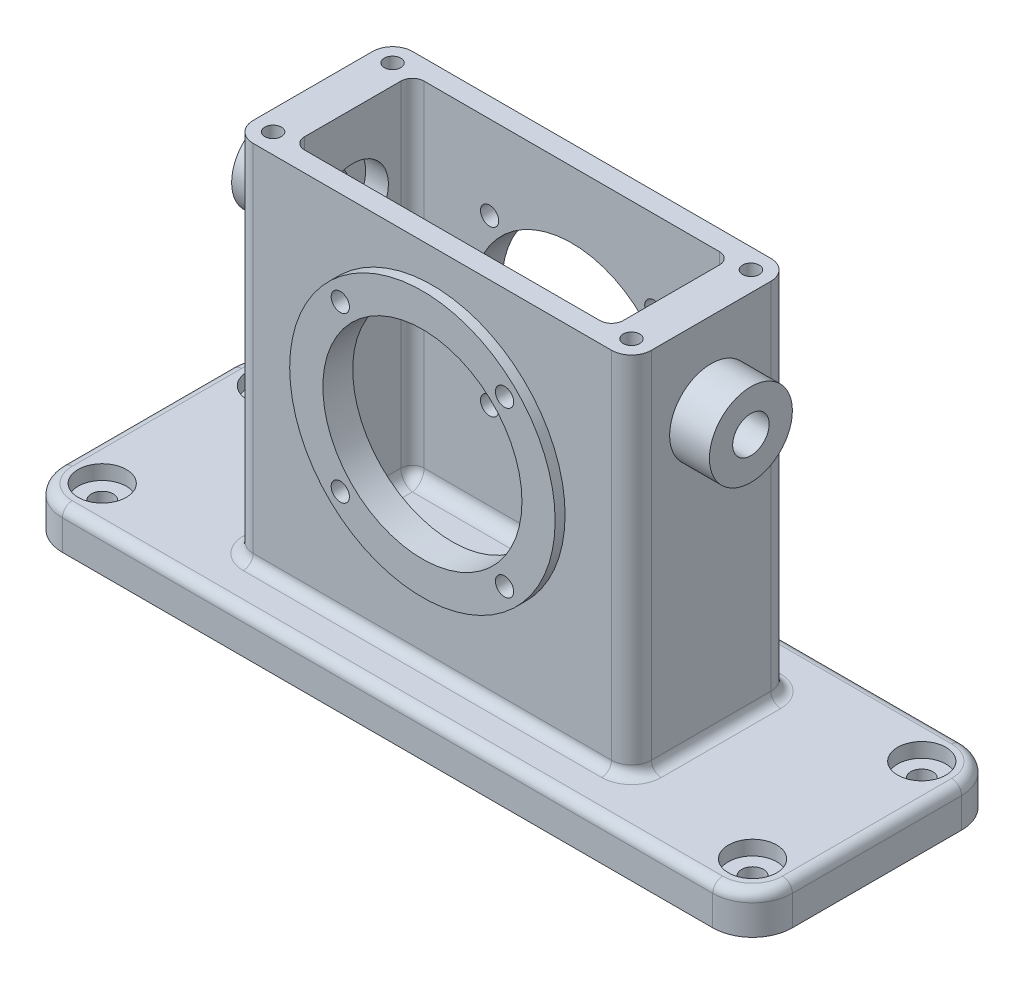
ISO-10303-21;
HEADER;
FILE_DESCRIPTION(('STEP AP214'),'2;1');
FILE_NAME('part.step','',(''),(''),'','','');
FILE_SCHEMA(('AUTOMOTIVE_DESIGN { 1 0 10303 214 1 1 1 1 }'));
ENDSEC;
DATA;
#1=APPLICATION_CONTEXT('core data for automotive mechanical design processes');
#2=APPLICATION_PROTOCOL_DEFINITION('international standard','automotive_design',2000,#1);
#3=PRODUCT_CONTEXT('',#1,'mechanical');
#4=PRODUCT('Part','Part','',(#3));
#5=PRODUCT_RELATED_PRODUCT_CATEGORY('part','',(#4));
#6=PRODUCT_DEFINITION_FORMATION('','',#4);
#7=PRODUCT_DEFINITION_CONTEXT('part definition',#1,'design');
#8=PRODUCT_DEFINITION('design','',#6,#7);
#9=PRODUCT_DEFINITION_SHAPE('','',#8);
#10=(LENGTH_UNIT() NAMED_UNIT(*) SI_UNIT(.MILLI.,.METRE.));
#11=(NAMED_UNIT(*) PLANE_ANGLE_UNIT() SI_UNIT($,.RADIAN.));
#12=(NAMED_UNIT(*) SI_UNIT($,.STERADIAN.) SOLID_ANGLE_UNIT());
#13=UNCERTAINTY_MEASURE_WITH_UNIT(LENGTH_MEASURE(1.E-05),#10,'distance_accuracy_value','');
#14=(GEOMETRIC_REPRESENTATION_CONTEXT(3) GLOBAL_UNCERTAINTY_ASSIGNED_CONTEXT((#13)) GLOBAL_UNIT_ASSIGNED_CONTEXT((#10,
#11,#12)) REPRESENTATION_CONTEXT('',''));
#15=CARTESIAN_POINT('',(0.,0.,0.));
#16=DIRECTION('',(0.,0.,1.));
#17=DIRECTION('',(1.,0.,0.));
#18=AXIS2_PLACEMENT_3D('',#15,#16,#17);
#19=CARTESIAN_POINT('',(0.,122.,24.));
#20=DIRECTION('',(0.,0.,-1.));
#21=DIRECTION('',(-1.,0.,0.));
#22=AXIS2_PLACEMENT_3D('',#19,#20,#21);
#23=PLANE('',#22);
#24=DIRECTION('',(1.,0.,0.));
#25=VECTOR('',#24,1.);
#26=CARTESIAN_POINT('',(0.,122.,24.));
#27=LINE('',#26,#25);
#28=CARTESIAN_POINT('',(-54.,122.,24.));
#29=VERTEX_POINT('',#28);
#30=CARTESIAN_POINT('',(54.,122.,24.));
#31=VERTEX_POINT('',#30);
#32=EDGE_CURVE('E539',#29,#31,#27,.T.);
#33=ORIENTED_EDGE('',*,*,#32,.F.);
#34=DIRECTION('',(0.,-1.,0.));
#35=VECTOR('',#34,1.);
#36=CARTESIAN_POINT('',(-54.,122.,24.));
#37=LINE('',#36,#35);
#38=CARTESIAN_POINT('',(-54.,15.,24.));
#39=VERTEX_POINT('',#38);
#40=EDGE_CURVE('E382',#39,#29,#37,.F.);
#41=ORIENTED_EDGE('',*,*,#40,.F.);
#42=DIRECTION('',(1.,0.,0.));
#43=VECTOR('',#42,1.);
#44=CARTESIAN_POINT('',(54.,15.,24.));
#45=LINE('',#44,#43);
#46=CARTESIAN_POINT('',(54.,15.,24.));
#47=VERTEX_POINT('',#46);
#48=EDGE_CURVE('E638',#39,#47,#45,.T.);
#49=ORIENTED_EDGE('',*,*,#48,.T.);
#50=DIRECTION('',(0.,-1.,0.));
#51=VECTOR('',#50,1.);
#52=CARTESIAN_POINT('',(54.,122.,24.));
#53=LINE('',#52,#51);
#54=EDGE_CURVE('E618',#47,#31,#53,.F.);
#55=ORIENTED_EDGE('',*,*,#54,.T.);
#56=EDGE_LOOP('',(#33,#41,#49,#55));
#57=FACE_BOUND('',#56,.T.);
#58=CARTESIAN_POINT('',(0.,72.,24.));
#59=DIRECTION('',(0.,0.,-1.));
#60=DIRECTION('',(-1.,0.,0.));
#61=AXIS2_PLACEMENT_3D('',#58,#59,#60);
#62=CIRCLE('',#61,40.);
#63=CARTESIAN_POINT('',(-40.,72.,24.));
#64=VERTEX_POINT('',#63);
#65=EDGE_CURVE('E13',#64,#64,#62,.F.);
#66=ORIENTED_EDGE('',*,*,#65,.F.);
#67=EDGE_LOOP('',(#66));
#68=FACE_BOUND('',#67,.T.);
#69=ADVANCED_FACE('F37',(#57,#68),#23,.F.);
#70=CARTESIAN_POINT('',(60.,122.,-24.));
#71=DIRECTION('',(-1.,0.,0.));
#72=DIRECTION('',(0.,0.,1.));
#73=AXIS2_PLACEMENT_3D('',#70,#71,#72);
#74=PLANE('',#73);
#75=DIRECTION('',(0.,-1.,0.));
#76=VECTOR('',#75,1.);
#77=CARTESIAN_POINT('',(60.,122.,18.));
#78=LINE('',#77,#76);
#79=CARTESIAN_POINT('',(60.,122.,18.));
#80=VERTEX_POINT('',#79);
#81=CARTESIAN_POINT('',(60.,15.,18.));
#82=VERTEX_POINT('',#81);
#83=EDGE_CURVE('E609',#80,#82,#78,.T.);
#84=ORIENTED_EDGE('',*,*,#83,.T.);
#85=DIRECTION('',(0.,0.,-1.));
#86=VECTOR('',#85,1.);
#87=CARTESIAN_POINT('',(60.,15.,-18.));
#88=LINE('',#87,#86);
#89=CARTESIAN_POINT('',(60.,15.,-18.));
#90=VERTEX_POINT('',#89);
#91=EDGE_CURVE('E634',#82,#90,#88,.T.);
#92=ORIENTED_EDGE('',*,*,#91,.T.);
#93=DIRECTION('',(0.,-1.,0.));
#94=VECTOR('',#93,1.);
#95=CARTESIAN_POINT('',(60.,122.,-18.));
#96=LINE('',#95,#94);
#97=CARTESIAN_POINT('',(60.,122.,-18.));
#98=VERTEX_POINT('',#97);
#99=EDGE_CURVE('E612',#90,#98,#96,.F.);
#100=ORIENTED_EDGE('',*,*,#99,.T.);
#101=DIRECTION('',(0.,0.,-1.));
#102=VECTOR('',#101,1.);
#103=CARTESIAN_POINT('',(60.,122.,-24.));
#104=LINE('',#103,#102);
#105=EDGE_CURVE('E542',#80,#98,#104,.T.);
#106=ORIENTED_EDGE('',*,*,#105,.F.);
#107=EDGE_LOOP('',(#84,#92,#100,#106));
#108=FACE_BOUND('',#107,.T.);
#109=CARTESIAN_POINT('',(60.,97.,0.));
#110=DIRECTION('',(-1.,0.,0.));
#111=DIRECTION('',(0.,0.,1.));
#112=AXIS2_PLACEMENT_3D('',#109,#110,#111);
#113=CIRCLE('',#112,12.5);
#114=CARTESIAN_POINT('',(60.,97.,12.5));
#115=VERTEX_POINT('',#114);
#116=EDGE_CURVE('E555',#115,#115,#113,.F.);
#117=ORIENTED_EDGE('',*,*,#116,.F.);
#118=EDGE_LOOP('',(#117));
#119=FACE_BOUND('',#118,.T.);
#120=ADVANCED_FACE('F822',(#108,#119),#74,.F.);
#121=CARTESIAN_POINT('',(0.,12.,0.));
#122=DIRECTION('',(0.,-1.,0.));
#123=DIRECTION('',(0.,0.,-1.));
#124=AXIS2_PLACEMENT_3D('',#121,#122,#123);
#125=PLANE('',#124);
#126=CARTESIAN_POINT('',(-54.,12.,-18.));
#127=DIRECTION('',(0.,1.,0.));
#128=DIRECTION('',(0.,0.,-1.));
#129=AXIS2_PLACEMENT_3D('',#126,#127,#128);
#130=CIRCLE('',#129,9.);
#131=CARTESIAN_POINT('',(-54.,12.,-27.));
#132=VERTEX_POINT('',#131);
#133=CARTESIAN_POINT('',(-63.,12.,-18.));
#134=VERTEX_POINT('',#133);
#135=EDGE_CURVE('E391',#132,#134,#130,.T.);
#136=ORIENTED_EDGE('',*,*,#135,.F.);
#137=DIRECTION('',(-1.,0.,0.));
#138=VECTOR('',#137,1.);
#139=CARTESIAN_POINT('',(54.,12.,-27.));
#140=LINE('',#139,#138);
#141=CARTESIAN_POINT('',(54.,12.,-27.));
#142=VERTEX_POINT('',#141);
#143=EDGE_CURVE('E630',#132,#142,#140,.F.);
#144=ORIENTED_EDGE('',*,*,#143,.T.);
#145=CARTESIAN_POINT('',(54.,12.,-18.));
#146=DIRECTION('',(0.,-1.,0.));
#147=DIRECTION('',(0.,0.,-1.));
#148=AXIS2_PLACEMENT_3D('',#145,#146,#147);
#149=CIRCLE('',#148,9.);
#150=CARTESIAN_POINT('',(63.,12.,-18.));
#151=VERTEX_POINT('',#150);
#152=EDGE_CURVE('E628',#142,#151,#149,.T.);
#153=ORIENTED_EDGE('',*,*,#152,.T.);
#154=DIRECTION('',(0.,0.,-1.));
#155=VECTOR('',#154,1.);
#156=CARTESIAN_POINT('',(63.,12.,18.));
#157=LINE('',#156,#155);
#158=CARTESIAN_POINT('',(63.,12.,18.));
#159=VERTEX_POINT('',#158);
#160=EDGE_CURVE('E626',#151,#159,#157,.F.);
#161=ORIENTED_EDGE('',*,*,#160,.T.);
#162=CARTESIAN_POINT('',(54.,12.,18.));
#163=DIRECTION('',(0.,-1.,0.));
#164=DIRECTION('',(0.,0.,-1.));
#165=AXIS2_PLACEMENT_3D('',#162,#163,#164);
#166=CIRCLE('',#165,9.);
#167=CARTESIAN_POINT('',(54.,12.,27.));
#168=VERTEX_POINT('',#167);
#169=EDGE_CURVE('E624',#159,#168,#166,.T.);
#170=ORIENTED_EDGE('',*,*,#169,.T.);
#171=DIRECTION('',(1.,0.,0.));
#172=VECTOR('',#171,1.);
#173=CARTESIAN_POINT('',(0.,12.,27.));
#174=LINE('',#173,#172);
#175=CARTESIAN_POINT('',(-54.,12.,27.));
#176=VERTEX_POINT('',#175);
#177=EDGE_CURVE('E622',#168,#176,#174,.F.);
#178=ORIENTED_EDGE('',*,*,#177,.T.);
#179=CARTESIAN_POINT('',(-54.,12.,18.));
#180=DIRECTION('',(0.,1.,0.));
#181=DIRECTION('',(0.,0.,-1.));
#182=AXIS2_PLACEMENT_3D('',#179,#180,#181);
#183=CIRCLE('',#182,9.);
#184=CARTESIAN_POINT('',(-63.,12.,18.));
#185=VERTEX_POINT('',#184);
#186=EDGE_CURVE('E385',#185,#176,#183,.T.);
#187=ORIENTED_EDGE('',*,*,#186,.F.);
#188=DIRECTION('',(0.,0.,-1.));
#189=VECTOR('',#188,1.);
#190=CARTESIAN_POINT('',(-63.,12.,18.));
#191=LINE('',#190,#189);
#192=EDGE_CURVE('E388',#134,#185,#191,.F.);
#193=ORIENTED_EDGE('',*,*,#192,.F.);
#194=EDGE_LOOP('',(#136,#144,#153,#161,#170,#178,#187,#193));
#195=FACE_BOUND('',#194,.T.);
#196=CARTESIAN_POINT('',(98.,12.,25.5));
#197=DIRECTION('',(0.,1.,0.));
#198=DIRECTION('',(0.,0.,1.));
#199=AXIS2_PLACEMENT_3D('',#196,#197,#198);
#200=CIRCLE('',#199,7.275);
#201=CARTESIAN_POINT('',(98.,12.,32.775));
#202=VERTEX_POINT('',#201);
#203=EDGE_CURVE('E442',#202,#202,#200,.T.);
#204=ORIENTED_EDGE('',*,*,#203,.F.);
#205=EDGE_LOOP('',(#204));
#206=FACE_BOUND('',#205,.T.);
#207=CARTESIAN_POINT('',(98.,12.,-25.5));
#208=DIRECTION('',(0.,1.,0.));
#209=DIRECTION('',(0.,0.,1.));
#210=AXIS2_PLACEMENT_3D('',#207,#208,#209);
#211=CIRCLE('',#210,7.275);
#212=CARTESIAN_POINT('',(98.,12.,-18.225));
#213=VERTEX_POINT('',#212);
#214=EDGE_CURVE('E492',#213,#213,#211,.T.);
#215=ORIENTED_EDGE('',*,*,#214,.F.);
#216=EDGE_LOOP('',(#215));
#217=FACE_BOUND('',#216,.T.);
#218=DIRECTION('',(-1.,0.,0.));
#219=VECTOR('',#218,1.);
#220=CARTESIAN_POINT('',(0.,12.,-34.5));
#221=LINE('',#220,#219);
#222=CARTESIAN_POINT('',(98.,12.,-34.5));
#223=VERTEX_POINT('',#222);
#224=CARTESIAN_POINT('',(-98.,12.,-34.5));
#225=VERTEX_POINT('',#224);
#226=EDGE_CURVE('E582',#223,#225,#221,.T.);
#227=ORIENTED_EDGE('',*,*,#226,.T.);
#228=CARTESIAN_POINT('',(-98.,12.,-25.5));
#229=DIRECTION('',(0.,1.,0.));
#230=DIRECTION('',(0.,0.,-1.));
#231=AXIS2_PLACEMENT_3D('',#228,#229,#230);
#232=CIRCLE('',#231,9.);
#233=CARTESIAN_POINT('',(-107.,12.,-25.5));
#234=VERTEX_POINT('',#233);
#235=EDGE_CURVE('E346',#234,#225,#232,.F.);
#236=ORIENTED_EDGE('',*,*,#235,.F.);
#237=DIRECTION('',(0.,0.,-1.));
#238=VECTOR('',#237,1.);
#239=CARTESIAN_POINT('',(-107.,12.,0.));
#240=LINE('',#239,#238);
#241=CARTESIAN_POINT('',(-107.,12.,25.5));
#242=VERTEX_POINT('',#241);
#243=EDGE_CURVE('E343',#242,#234,#240,.T.);
#244=ORIENTED_EDGE('',*,*,#243,.F.);
#245=CARTESIAN_POINT('',(-98.,12.,25.5));
#246=DIRECTION('',(0.,1.,0.));
#247=DIRECTION('',(0.,0.,-1.));
#248=AXIS2_PLACEMENT_3D('',#245,#246,#247);
#249=CIRCLE('',#248,9.);
#250=CARTESIAN_POINT('',(-98.,12.,34.5));
#251=VERTEX_POINT('',#250);
#252=EDGE_CURVE('E340',#251,#242,#249,.F.);
#253=ORIENTED_EDGE('',*,*,#252,.F.);
#254=DIRECTION('',(1.,0.,0.));
#255=VECTOR('',#254,1.);
#256=CARTESIAN_POINT('',(0.,12.,34.5));
#257=LINE('',#256,#255);
#258=CARTESIAN_POINT('',(98.,12.,34.5));
#259=VERTEX_POINT('',#258);
#260=EDGE_CURVE('E574',#251,#259,#257,.T.);
#261=ORIENTED_EDGE('',*,*,#260,.T.);
#262=CARTESIAN_POINT('',(98.,12.,25.5));
#263=DIRECTION('',(0.,-1.,0.));
#264=DIRECTION('',(0.,0.,-1.));
#265=AXIS2_PLACEMENT_3D('',#262,#263,#264);
#266=CIRCLE('',#265,9.);
#267=CARTESIAN_POINT('',(107.,12.,25.5));
#268=VERTEX_POINT('',#267);
#269=EDGE_CURVE('E576',#259,#268,#266,.F.);
#270=ORIENTED_EDGE('',*,*,#269,.T.);
#271=DIRECTION('',(0.,0.,-1.));
#272=VECTOR('',#271,1.);
#273=CARTESIAN_POINT('',(107.,12.,0.));
#274=LINE('',#273,#272);
#275=CARTESIAN_POINT('',(107.,12.,-25.5));
#276=VERTEX_POINT('',#275);
#277=EDGE_CURVE('E578',#268,#276,#274,.T.);
#278=ORIENTED_EDGE('',*,*,#277,.T.);
#279=CARTESIAN_POINT('',(98.,12.,-25.5));
#280=DIRECTION('',(0.,-1.,0.));
#281=DIRECTION('',(0.,0.,-1.));
#282=AXIS2_PLACEMENT_3D('',#279,#280,#281);
#283=CIRCLE('',#282,9.);
#284=EDGE_CURVE('E580',#276,#223,#283,.F.);
#285=ORIENTED_EDGE('',*,*,#284,.T.);
#286=EDGE_LOOP('',(#227,#236,#244,#253,#261,#270,#278,#285));
#287=FACE_BOUND('',#286,.T.);
#288=CARTESIAN_POINT('',(-98.,12.,25.5));
#289=DIRECTION('',(0.,-1.,0.));
#290=DIRECTION('',(0.,0.,1.));
#291=AXIS2_PLACEMENT_3D('',#288,#289,#290);
#292=CIRCLE('',#291,7.275);
#293=CARTESIAN_POINT('',(-98.,12.,32.775));
#294=VERTEX_POINT('',#293);
#295=EDGE_CURVE('E777',#294,#294,#292,.T.);
#296=ORIENTED_EDGE('',*,*,#295,.T.);
#297=EDGE_LOOP('',(#296));
#298=FACE_BOUND('',#297,.T.);
#299=CARTESIAN_POINT('',(-98.,12.,-25.5));
#300=DIRECTION('',(0.,-1.,0.));
#301=DIRECTION('',(0.,0.,1.));
#302=AXIS2_PLACEMENT_3D('',#299,#300,#301);
#303=CIRCLE('',#302,7.275);
#304=CARTESIAN_POINT('',(-98.,12.,-18.225));
#305=VERTEX_POINT('',#304);
#306=EDGE_CURVE('E789',#305,#305,#303,.T.);
#307=ORIENTED_EDGE('',*,*,#306,.T.);
#308=EDGE_LOOP('',(#307));
#309=FACE_BOUND('',#308,.T.);
#310=ADVANCED_FACE('F828',(#195,#206,#217,#287,#298,#309),#125,.F.);
#311=CARTESIAN_POINT('',(110.,12.,-37.5));
#312=DIRECTION('',(-1.,0.,0.));
#313=DIRECTION('',(0.,0.,1.));
#314=AXIS2_PLACEMENT_3D('',#311,#312,#313);
#315=PLANE('',#314);
#316=DIRECTION('',(0.,-1.,0.));
#317=VECTOR('',#316,1.);
#318=CARTESIAN_POINT('',(110.,12.,-25.5));
#319=LINE('',#318,#317);
#320=CARTESIAN_POINT('',(110.,0.,-25.5));
#321=VERTEX_POINT('',#320);
#322=CARTESIAN_POINT('',(110.,9.,-25.5));
#323=VERTEX_POINT('',#322);
#324=EDGE_CURVE('E568',#321,#323,#319,.F.);
#325=ORIENTED_EDGE('',*,*,#324,.T.);
#326=DIRECTION('',(0.,0.,-1.));
#327=VECTOR('',#326,1.);
#328=CARTESIAN_POINT('',(110.,9.,-37.5));
#329=LINE('',#328,#327);
#330=CARTESIAN_POINT('',(110.,9.,25.5));
#331=VERTEX_POINT('',#330);
#332=EDGE_CURVE('E588',#323,#331,#329,.F.);
#333=ORIENTED_EDGE('',*,*,#332,.T.);
#334=DIRECTION('',(0.,-1.,0.));
#335=VECTOR('',#334,1.);
#336=CARTESIAN_POINT('',(110.,12.,25.5));
#337=LINE('',#336,#335);
#338=CARTESIAN_POINT('',(110.,0.,25.5));
#339=VERTEX_POINT('',#338);
#340=EDGE_CURVE('E566',#331,#339,#337,.T.);
#341=ORIENTED_EDGE('',*,*,#340,.T.);
#342=DIRECTION('',(0.,0.,-1.));
#343=VECTOR('',#342,1.);
#344=CARTESIAN_POINT('',(110.,0.,-37.5));
#345=LINE('',#344,#343);
#346=EDGE_CURVE('E547',#339,#321,#345,.T.);
#347=ORIENTED_EDGE('',*,*,#346,.T.);
#348=EDGE_LOOP('',(#325,#333,#341,#347));
#349=FACE_BOUND('',#348,.T.);
#350=ADVANCED_FACE('F833',(#349),#315,.F.);
#351=CARTESIAN_POINT('',(110.,12.,-37.5));
#352=DIRECTION('',(0.,0.,1.));
#353=DIRECTION('',(1.,0.,0.));
#354=AXIS2_PLACEMENT_3D('',#351,#352,#353);
#355=PLANE('',#354);
#356=DIRECTION('',(-1.,0.,0.));
#357=VECTOR('',#356,1.);
#358=CARTESIAN_POINT('',(110.,0.,-37.5));
#359=LINE('',#358,#357);
#360=CARTESIAN_POINT('',(98.,0.,-37.5));
#361=VERTEX_POINT('',#360);
#362=CARTESIAN_POINT('',(-98.,0.,-37.5));
#363=VERTEX_POINT('',#362);
#364=EDGE_CURVE('E550',#361,#363,#359,.T.);
#365=ORIENTED_EDGE('',*,*,#364,.T.);
#366=DIRECTION('',(0.,-1.,0.));
#367=VECTOR('',#366,1.);
#368=CARTESIAN_POINT('',(-98.,12.,-37.5));
#369=LINE('',#368,#367);
#370=CARTESIAN_POINT('',(-98.,9.,-37.5));
#371=VERTEX_POINT('',#370);
#372=EDGE_CURVE('E321',#371,#363,#369,.T.);
#373=ORIENTED_EDGE('',*,*,#372,.F.);
#374=DIRECTION('',(-1.,0.,0.));
#375=VECTOR('',#374,1.);
#376=CARTESIAN_POINT('',(110.,9.,-37.5));
#377=LINE('',#376,#375);
#378=CARTESIAN_POINT('',(98.,9.,-37.5));
#379=VERTEX_POINT('',#378);
#380=EDGE_CURVE('E584',#371,#379,#377,.F.);
#381=ORIENTED_EDGE('',*,*,#380,.T.);
#382=DIRECTION('',(0.,-1.,0.));
#383=VECTOR('',#382,1.);
#384=CARTESIAN_POINT('',(98.,12.,-37.5));
#385=LINE('',#384,#383);
#386=EDGE_CURVE('E558',#379,#361,#385,.T.);
#387=ORIENTED_EDGE('',*,*,#386,.T.);
#388=EDGE_LOOP('',(#365,#373,#381,#387));
#389=FACE_BOUND('',#388,.T.);
#390=ADVANCED_FACE('F816',(#389),#355,.F.);
#391=CARTESIAN_POINT('',(110.,12.,37.5));
#392=DIRECTION('',(0.,0.,-1.));
#393=DIRECTION('',(-1.,0.,0.));
#394=AXIS2_PLACEMENT_3D('',#391,#392,#393);
#395=PLANE('',#394);
#396=DIRECTION('',(0.,-1.,0.));
#397=VECTOR('',#396,1.);
#398=CARTESIAN_POINT('',(98.,12.,37.5));
#399=LINE('',#398,#397);
#400=CARTESIAN_POINT('',(98.,0.,37.5));
#401=VERTEX_POINT('',#400);
#402=CARTESIAN_POINT('',(98.,9.,37.5));
#403=VERTEX_POINT('',#402);
#404=EDGE_CURVE('E571',#401,#403,#399,.F.);
#405=ORIENTED_EDGE('',*,*,#404,.T.);
#406=DIRECTION('',(1.,0.,0.));
#407=VECTOR('',#406,1.);
#408=CARTESIAN_POINT('',(110.,9.,37.5));
#409=LINE('',#408,#407);
#410=CARTESIAN_POINT('',(-98.,9.,37.5));
#411=VERTEX_POINT('',#410);
#412=EDGE_CURVE('E592',#403,#411,#409,.F.);
#413=ORIENTED_EDGE('',*,*,#412,.T.);
#414=DIRECTION('',(0.,-1.,0.));
#415=VECTOR('',#414,1.);
#416=CARTESIAN_POINT('',(-98.,12.,37.5));
#417=LINE('',#416,#415);
#418=CARTESIAN_POINT('',(-98.,0.,37.5));
#419=VERTEX_POINT('',#418);
#420=EDGE_CURVE('E337',#419,#411,#417,.F.);
#421=ORIENTED_EDGE('',*,*,#420,.F.);
#422=DIRECTION('',(1.,0.,0.));
#423=VECTOR('',#422,1.);
#424=CARTESIAN_POINT('',(110.,0.,37.5));
#425=LINE('',#424,#423);
#426=EDGE_CURVE('E552',#419,#401,#425,.T.);
#427=ORIENTED_EDGE('',*,*,#426,.T.);
#428=EDGE_LOOP('',(#405,#413,#421,#427));
#429=FACE_BOUND('',#428,.T.);
#430=ADVANCED_FACE('F806',(#429),#395,.F.);
#431=CARTESIAN_POINT('',(0.,0.,0.));
#432=DIRECTION('',(0.,-1.,0.));
#433=DIRECTION('',(0.,0.,-1.));
#434=AXIS2_PLACEMENT_3D('',#431,#432,#433);
#435=PLANE('',#434);
#436=CARTESIAN_POINT('',(98.,0.,25.5));
#437=DIRECTION('',(0.,1.,0.));
#438=DIRECTION('',(0.,0.,1.));
#439=AXIS2_PLACEMENT_3D('',#436,#437,#438);
#440=CIRCLE('',#439,3.3);
#441=CARTESIAN_POINT('',(98.,0.,28.8));
#442=VERTEX_POINT('',#441);
#443=EDGE_CURVE('E489',#442,#442,#440,.T.);
#444=ORIENTED_EDGE('',*,*,#443,.T.);
#445=EDGE_LOOP('',(#444));
#446=FACE_BOUND('',#445,.T.);
#447=CARTESIAN_POINT('',(98.,0.,-25.5));
#448=DIRECTION('',(0.,1.,0.));
#449=DIRECTION('',(0.,0.,1.));
#450=AXIS2_PLACEMENT_3D('',#447,#448,#449);
#451=CIRCLE('',#450,3.3);
#452=CARTESIAN_POINT('',(98.,0.,-22.2));
#453=VERTEX_POINT('',#452);
#454=EDGE_CURVE('E501',#453,#453,#451,.T.);
#455=ORIENTED_EDGE('',*,*,#454,.T.);
#456=EDGE_LOOP('',(#455));
#457=FACE_BOUND('',#456,.T.);
#458=ORIENTED_EDGE('',*,*,#364,.F.);
#459=CARTESIAN_POINT('',(98.,0.,-25.5));
#460=DIRECTION('',(0.,-1.,0.));
#461=DIRECTION('',(0.,0.,-1.));
#462=AXIS2_PLACEMENT_3D('',#459,#460,#461);
#463=CIRCLE('',#462,12.);
#464=EDGE_CURVE('E564',#361,#321,#463,.T.);
#465=ORIENTED_EDGE('',*,*,#464,.T.);
#466=ORIENTED_EDGE('',*,*,#346,.F.);
#467=CARTESIAN_POINT('',(98.,0.,25.5));
#468=DIRECTION('',(0.,-1.,0.));
#469=DIRECTION('',(0.,0.,-1.));
#470=AXIS2_PLACEMENT_3D('',#467,#468,#469);
#471=CIRCLE('',#470,12.);
#472=EDGE_CURVE('E562',#339,#401,#471,.T.);
#473=ORIENTED_EDGE('',*,*,#472,.T.);
#474=ORIENTED_EDGE('',*,*,#426,.F.);
#475=CARTESIAN_POINT('',(-98.,0.,25.5));
#476=DIRECTION('',(0.,1.,0.));
#477=DIRECTION('',(0.,0.,-1.));
#478=AXIS2_PLACEMENT_3D('',#475,#476,#477);
#479=CIRCLE('',#478,12.);
#480=CARTESIAN_POINT('',(-110.,0.,25.5));
#481=VERTEX_POINT('',#480);
#482=EDGE_CURVE('E326',#481,#419,#479,.T.);
#483=ORIENTED_EDGE('',*,*,#482,.F.);
#484=DIRECTION('',(0.,0.,-1.));
#485=VECTOR('',#484,1.);
#486=CARTESIAN_POINT('',(-110.,0.,-37.5));
#487=LINE('',#486,#485);
#488=CARTESIAN_POINT('',(-110.,0.,-25.5));
#489=VERTEX_POINT('',#488);
#490=EDGE_CURVE('E315',#481,#489,#487,.T.);
#491=ORIENTED_EDGE('',*,*,#490,.T.);
#492=CARTESIAN_POINT('',(-98.,0.,-25.5));
#493=DIRECTION('',(0.,1.,0.));
#494=DIRECTION('',(0.,0.,-1.));
#495=AXIS2_PLACEMENT_3D('',#492,#493,#494);
#496=CIRCLE('',#495,12.);
#497=EDGE_CURVE('E329',#363,#489,#496,.T.);
#498=ORIENTED_EDGE('',*,*,#497,.F.);
#499=EDGE_LOOP('',(#458,#465,#466,#473,#474,#483,#491,#498));
#500=FACE_BOUND('',#499,.T.);
#501=CARTESIAN_POINT('',(-98.,0.,25.5));
#502=DIRECTION('',(0.,-1.,0.));
#503=DIRECTION('',(0.,0.,1.));
#504=AXIS2_PLACEMENT_3D('',#501,#502,#503);
#505=CIRCLE('',#504,3.3);
#506=CARTESIAN_POINT('',(-98.,0.,28.8));
#507=VERTEX_POINT('',#506);
#508=EDGE_CURVE('E786',#507,#507,#505,.T.);
#509=ORIENTED_EDGE('',*,*,#508,.F.);
#510=EDGE_LOOP('',(#509));
#511=FACE_BOUND('',#510,.T.);
#512=CARTESIAN_POINT('',(-98.,0.,-25.5));
#513=DIRECTION('',(0.,-1.,0.));
#514=DIRECTION('',(0.,0.,1.));
#515=AXIS2_PLACEMENT_3D('',#512,#513,#514);
#516=CIRCLE('',#515,3.3);
#517=CARTESIAN_POINT('',(-98.,0.,-22.2));
#518=VERTEX_POINT('',#517);
#519=EDGE_CURVE('E288',#518,#518,#516,.T.);
#520=ORIENTED_EDGE('',*,*,#519,.F.);
#521=EDGE_LOOP('',(#520));
#522=FACE_BOUND('',#521,.T.);
#523=ADVANCED_FACE('F803',(#446,#457,#500,#511,#522),#435,.T.);
#524=CARTESIAN_POINT('',(0.,122.,-24.));
#525=DIRECTION('',(0.,0.,1.));
#526=DIRECTION('',(1.,0.,0.));
#527=AXIS2_PLACEMENT_3D('',#524,#525,#526);
#528=PLANE('',#527);
#529=CARTESIAN_POINT('',(0.,72.,-24.));
#530=DIRECTION('',(0.,0.,1.));
#531=DIRECTION('',(1.,0.,0.));
#532=AXIS2_PLACEMENT_3D('',#529,#530,#531);
#533=CIRCLE('',#532,40.);
#534=CARTESIAN_POINT('',(40.,72.,-24.));
#535=VERTEX_POINT('',#534);
#536=EDGE_CURVE('E768',#535,#535,#533,.T.);
#537=ORIENTED_EDGE('',*,*,#536,.T.);
#538=EDGE_LOOP('',(#537));
#539=FACE_BOUND('',#538,.T.);
#540=DIRECTION('',(0.,-1.,0.));
#541=VECTOR('',#540,1.);
#542=CARTESIAN_POINT('',(54.,122.,-24.));
#543=LINE('',#542,#541);
#544=CARTESIAN_POINT('',(54.,122.,-24.));
#545=VERTEX_POINT('',#544);
#546=CARTESIAN_POINT('',(54.,15.,-24.));
#547=VERTEX_POINT('',#546);
#548=EDGE_CURVE('E594',#545,#547,#543,.T.);
#549=ORIENTED_EDGE('',*,*,#548,.T.);
#550=DIRECTION('',(-1.,0.,0.));
#551=VECTOR('',#550,1.);
#552=CARTESIAN_POINT('',(0.,15.,-24.));
#553=LINE('',#552,#551);
#554=CARTESIAN_POINT('',(-54.,15.,-24.));
#555=VERTEX_POINT('',#554);
#556=EDGE_CURVE('E620',#547,#555,#553,.T.);
#557=ORIENTED_EDGE('',*,*,#556,.T.);
#558=DIRECTION('',(0.,-1.,0.));
#559=VECTOR('',#558,1.);
#560=CARTESIAN_POINT('',(-54.,122.,-24.));
#561=LINE('',#560,#559);
#562=CARTESIAN_POINT('',(-54.,122.,-24.));
#563=VERTEX_POINT('',#562);
#564=EDGE_CURVE('E358',#563,#555,#561,.T.);
#565=ORIENTED_EDGE('',*,*,#564,.F.);
#566=DIRECTION('',(-1.,0.,0.));
#567=VECTOR('',#566,1.);
#568=CARTESIAN_POINT('',(0.,122.,-24.));
#569=LINE('',#568,#567);
#570=EDGE_CURVE('E545',#545,#563,#569,.T.);
#571=ORIENTED_EDGE('',*,*,#570,.F.);
#572=EDGE_LOOP('',(#549,#557,#565,#571));
#573=FACE_BOUND('',#572,.T.);
#574=ADVANCED_FACE('F805',(#539,#573),#528,.F.);
#575=CARTESIAN_POINT('',(0.,122.,0.));
#576=DIRECTION('',(0.,1.,0.));
#577=DIRECTION('',(0.,0.,1.));
#578=AXIS2_PLACEMENT_3D('',#575,#576,#577);
#579=PLANE('',#578);
#580=CARTESIAN_POINT('',(-54.,122.,18.));
#581=DIRECTION('',(0.,-1.,0.));
#582=DIRECTION('',(0.,0.,1.));
#583=AXIS2_PLACEMENT_3D('',#580,#581,#582);
#584=CIRCLE('',#583,6.);
#585=CARTESIAN_POINT('',(-60.,122.,18.));
#586=VERTEX_POINT('',#585);
#587=EDGE_CURVE('E377',#29,#586,#584,.T.);
#588=ORIENTED_EDGE('',*,*,#587,.F.);
#589=ORIENTED_EDGE('',*,*,#32,.T.);
#590=CARTESIAN_POINT('',(54.,122.,18.));
#591=DIRECTION('',(0.,1.,0.));
#592=DIRECTION('',(0.,0.,1.));
#593=AXIS2_PLACEMENT_3D('',#590,#591,#592);
#594=CIRCLE('',#593,6.);
#595=EDGE_CURVE('E614',#31,#80,#594,.T.);
#596=ORIENTED_EDGE('',*,*,#595,.T.);
#597=ORIENTED_EDGE('',*,*,#105,.T.);
#598=CARTESIAN_POINT('',(54.,122.,-18.));
#599=DIRECTION('',(0.,1.,0.));
#600=DIRECTION('',(0.,0.,1.));
#601=AXIS2_PLACEMENT_3D('',#598,#599,#600);
#602=CIRCLE('',#601,6.);
#603=EDGE_CURVE('E616',#98,#545,#602,.T.);
#604=ORIENTED_EDGE('',*,*,#603,.T.);
#605=ORIENTED_EDGE('',*,*,#570,.T.);
#606=CARTESIAN_POINT('',(-54.,122.,-18.));
#607=DIRECTION('',(0.,-1.,0.));
#608=DIRECTION('',(0.,0.,1.));
#609=AXIS2_PLACEMENT_3D('',#606,#607,#608);
#610=CIRCLE('',#609,6.);
#611=CARTESIAN_POINT('',(-60.,122.,-18.));
#612=VERTEX_POINT('',#611);
#613=EDGE_CURVE('E379',#612,#563,#610,.T.);
#614=ORIENTED_EDGE('',*,*,#613,.F.);
#615=DIRECTION('',(0.,0.,-1.));
#616=VECTOR('',#615,1.);
#617=CARTESIAN_POINT('',(-60.,122.,-24.));
#618=LINE('',#617,#616);
#619=EDGE_CURVE('E312',#586,#612,#618,.T.);
#620=ORIENTED_EDGE('',*,*,#619,.F.);
#621=EDGE_LOOP('',(#588,#589,#596,#597,#604,#605,#614,#620));
#622=FACE_BOUND('',#621,.T.);
#623=CARTESIAN_POINT('',(54.,122.,18.));
#624=DIRECTION('',(0.,1.,0.));
#625=DIRECTION('',(0.,0.,1.));
#626=AXIS2_PLACEMENT_3D('',#623,#624,#625);
#627=CIRCLE('',#626,2.5);
#628=CARTESIAN_POINT('',(54.,122.,20.5));
#629=VERTEX_POINT('',#628);
#630=EDGE_CURVE('E504',#629,#629,#627,.T.);
#631=ORIENTED_EDGE('',*,*,#630,.F.);
#632=EDGE_LOOP('',(#631));
#633=FACE_BOUND('',#632,.T.);
#634=CARTESIAN_POINT('',(54.,122.,-18.));
#635=DIRECTION('',(0.,1.,0.));
#636=DIRECTION('',(0.,0.,1.));
#637=AXIS2_PLACEMENT_3D('',#634,#635,#636);
#638=CIRCLE('',#637,2.5);
#639=CARTESIAN_POINT('',(54.,122.,-15.5));
#640=VERTEX_POINT('',#639);
#641=EDGE_CURVE('E510',#640,#640,#638,.T.);
#642=ORIENTED_EDGE('',*,*,#641,.F.);
#643=EDGE_LOOP('',(#642));
#644=FACE_BOUND('',#643,.T.);
#645=DIRECTION('',(1.,0.,0.));
#646=VECTOR('',#645,1.);
#647=CARTESIAN_POINT('',(0.,122.,18.));
#648=LINE('',#647,#646);
#649=CARTESIAN_POINT('',(-44.5,122.,18.));
#650=VERTEX_POINT('',#649);
#651=CARTESIAN_POINT('',(44.5,122.,18.));
#652=VERTEX_POINT('',#651);
#653=EDGE_CURVE('E534',#650,#652,#648,.T.);
#654=ORIENTED_EDGE('',*,*,#653,.F.);
#655=CARTESIAN_POINT('',(-44.5,122.,14.5));
#656=DIRECTION('',(0.,-1.,0.));
#657=DIRECTION('',(0.,0.,1.));
#658=AXIS2_PLACEMENT_3D('',#655,#656,#657);
#659=CIRCLE('',#658,3.5);
#660=CARTESIAN_POINT('',(-48.,122.,14.5));
#661=VERTEX_POINT('',#660);
#662=EDGE_CURVE('E424',#661,#650,#659,.F.);
#663=ORIENTED_EDGE('',*,*,#662,.F.);
#664=DIRECTION('',(0.,0.,-1.));
#665=VECTOR('',#664,1.);
#666=CARTESIAN_POINT('',(-48.,122.,18.));
#667=LINE('',#666,#665);
#668=CARTESIAN_POINT('',(-48.,122.,-14.5));
#669=VERTEX_POINT('',#668);
#670=EDGE_CURVE('E306',#661,#669,#667,.T.);
#671=ORIENTED_EDGE('',*,*,#670,.T.);
#672=CARTESIAN_POINT('',(-44.5,122.,-14.5));
#673=DIRECTION('',(0.,-1.,0.));
#674=DIRECTION('',(0.,0.,1.));
#675=AXIS2_PLACEMENT_3D('',#672,#673,#674);
#676=CIRCLE('',#675,3.5);
#677=CARTESIAN_POINT('',(-44.5,122.,-18.));
#678=VERTEX_POINT('',#677);
#679=EDGE_CURVE('E427',#678,#669,#676,.F.);
#680=ORIENTED_EDGE('',*,*,#679,.F.);
#681=DIRECTION('',(-1.,0.,0.));
#682=VECTOR('',#681,1.);
#683=CARTESIAN_POINT('',(0.,122.,-18.));
#684=LINE('',#683,#682);
#685=CARTESIAN_POINT('',(44.5,122.,-18.));
#686=VERTEX_POINT('',#685);
#687=EDGE_CURVE('E528',#686,#678,#684,.T.);
#688=ORIENTED_EDGE('',*,*,#687,.F.);
#689=CARTESIAN_POINT('',(44.5,122.,-14.5));
#690=DIRECTION('',(0.,1.,0.));
#691=DIRECTION('',(0.,0.,1.));
#692=AXIS2_PLACEMENT_3D('',#689,#690,#691);
#693=CIRCLE('',#692,3.5);
#694=CARTESIAN_POINT('',(48.,122.,-14.5));
#695=VERTEX_POINT('',#694);
#696=EDGE_CURVE('E663',#686,#695,#693,.F.);
#697=ORIENTED_EDGE('',*,*,#696,.T.);
#698=DIRECTION('',(0.,0.,-1.));
#699=VECTOR('',#698,1.);
#700=CARTESIAN_POINT('',(48.,122.,18.));
#701=LINE('',#700,#699);
#702=CARTESIAN_POINT('',(48.,122.,14.5));
#703=VERTEX_POINT('',#702);
#704=EDGE_CURVE('E531',#703,#695,#701,.T.);
#705=ORIENTED_EDGE('',*,*,#704,.F.);
#706=CARTESIAN_POINT('',(44.5,122.,14.5));
#707=DIRECTION('',(0.,1.,0.));
#708=DIRECTION('',(0.,0.,1.));
#709=AXIS2_PLACEMENT_3D('',#706,#707,#708);
#710=CIRCLE('',#709,3.5);
#711=EDGE_CURVE('E661',#703,#652,#710,.F.);
#712=ORIENTED_EDGE('',*,*,#711,.T.);
#713=EDGE_LOOP('',(#654,#663,#671,#680,#688,#697,#705,#712));
#714=FACE_BOUND('',#713,.T.);
#715=CARTESIAN_POINT('',(-54.,122.,18.));
#716=DIRECTION('',(0.,-1.,0.));
#717=DIRECTION('',(0.,0.,1.));
#718=AXIS2_PLACEMENT_3D('',#715,#716,#717);
#719=CIRCLE('',#718,2.5);
#720=CARTESIAN_POINT('',(-54.,122.,20.5));
#721=VERTEX_POINT('',#720);
#722=EDGE_CURVE('E282',#721,#721,#719,.T.);
#723=ORIENTED_EDGE('',*,*,#722,.T.);
#724=EDGE_LOOP('',(#723));
#725=FACE_BOUND('',#724,.T.);
#726=CARTESIAN_POINT('',(-54.,122.,-18.));
#727=DIRECTION('',(0.,-1.,0.));
#728=DIRECTION('',(0.,0.,1.));
#729=AXIS2_PLACEMENT_3D('',#726,#727,#728);
#730=CIRCLE('',#729,2.5);
#731=CARTESIAN_POINT('',(-54.,122.,-15.5));
#732=VERTEX_POINT('',#731);
#733=EDGE_CURVE('E281',#732,#732,#730,.T.);
#734=ORIENTED_EDGE('',*,*,#733,.T.);
#735=EDGE_LOOP('',(#734));
#736=FACE_BOUND('',#735,.T.);
#737=ADVANCED_FACE('F813',(#622,#633,#644,#714,#725,#736),#579,.T.);
#738=CARTESIAN_POINT('',(72.,97.,0.));
#739=DIRECTION('',(-1.,0.,0.));
#740=DIRECTION('',(0.,0.,1.));
#741=AXIS2_PLACEMENT_3D('',#738,#739,#740);
#742=CYLINDRICAL_SURFACE('',#741,12.5);
#743=CARTESIAN_POINT('',(72.,97.,0.));
#744=DIRECTION('',(1.,0.,0.));
#745=DIRECTION('',(0.,0.,-1.));
#746=AXIS2_PLACEMENT_3D('',#743,#744,#745);
#747=CIRCLE('',#746,12.5);
#748=CARTESIAN_POINT('',(72.,97.,-12.5));
#749=VERTEX_POINT('',#748);
#750=EDGE_CURVE('E530',#749,#749,#747,.T.);
#751=ORIENTED_EDGE('',*,*,#750,.F.);
#752=EDGE_LOOP('',(#751));
#753=FACE_BOUND('',#752,.T.);
#754=ORIENTED_EDGE('',*,*,#116,.T.);
#755=EDGE_LOOP('',(#754));
#756=FACE_BOUND('',#755,.T.);
#757=ADVANCED_FACE('F1025',(#753,#756),#742,.T.);
#758=CARTESIAN_POINT('',(72.,97.,0.));
#759=DIRECTION('',(1.,0.,0.));
#760=DIRECTION('',(0.,0.,-1.));
#761=AXIS2_PLACEMENT_3D('',#758,#759,#760);
#762=PLANE('',#761);
#763=CARTESIAN_POINT('',(72.,97.,0.));
#764=DIRECTION('',(1.,0.,0.));
#765=DIRECTION('',(0.,0.,-1.));
#766=AXIS2_PLACEMENT_3D('',#763,#764,#765);
#767=CIRCLE('',#766,5.5);
#768=CARTESIAN_POINT('',(72.,97.,-5.5));
#769=VERTEX_POINT('',#768);
#770=EDGE_CURVE('E527',#769,#769,#767,.T.);
#771=ORIENTED_EDGE('',*,*,#770,.F.);
#772=EDGE_LOOP('',(#771));
#773=FACE_BOUND('',#772,.T.);
#774=ORIENTED_EDGE('',*,*,#750,.T.);
#775=EDGE_LOOP('',(#774));
#776=FACE_BOUND('',#775,.T.);
#777=ADVANCED_FACE('F1021',(#773,#776),#762,.T.);
#778=CARTESIAN_POINT('',(0.,17.,0.));
#779=DIRECTION('',(0.,-1.,0.));
#780=DIRECTION('',(0.,0.,-1.));
#781=AXIS2_PLACEMENT_3D('',#778,#779,#780);
#782=PLANE('',#781);
#783=DIRECTION('',(-1.,0.,0.));
#784=VECTOR('',#783,1.);
#785=CARTESIAN_POINT('',(0.,17.,-14.));
#786=LINE('',#785,#784);
#787=CARTESIAN_POINT('',(44.,17.,-14.));
#788=VERTEX_POINT('',#787);
#789=CARTESIAN_POINT('',(-44.,17.,-14.));
#790=VERTEX_POINT('',#789);
#791=EDGE_CURVE('E665',#788,#790,#786,.T.);
#792=ORIENTED_EDGE('',*,*,#791,.T.);
#793=DIRECTION('',(0.,0.,-1.));
#794=VECTOR('',#793,1.);
#795=CARTESIAN_POINT('',(-44.,17.,-14.5));
#796=LINE('',#795,#794);
#797=CARTESIAN_POINT('',(-44.,17.,14.));
#798=VERTEX_POINT('',#797);
#799=EDGE_CURVE('E430',#798,#790,#796,.T.);
#800=ORIENTED_EDGE('',*,*,#799,.F.);
#801=DIRECTION('',(1.,0.,0.));
#802=VECTOR('',#801,1.);
#803=CARTESIAN_POINT('',(44.5,17.,14.));
#804=LINE('',#803,#802);
#805=CARTESIAN_POINT('',(44.,17.,14.));
#806=VERTEX_POINT('',#805);
#807=EDGE_CURVE('E669',#798,#806,#804,.T.);
#808=ORIENTED_EDGE('',*,*,#807,.T.);
#809=DIRECTION('',(0.,0.,-1.));
#810=VECTOR('',#809,1.);
#811=CARTESIAN_POINT('',(44.,17.,-14.5));
#812=LINE('',#811,#810);
#813=EDGE_CURVE('E667',#806,#788,#812,.T.);
#814=ORIENTED_EDGE('',*,*,#813,.T.);
#815=EDGE_LOOP('',(#792,#800,#808,#814));
#816=FACE_BOUND('',#815,.T.);
#817=ADVANCED_FACE('F1017',(#816),#782,.F.);
#818=CARTESIAN_POINT('',(0.,-48.,18.));
#819=DIRECTION('',(0.,0.,1.));
#820=DIRECTION('',(1.,0.,0.));
#821=AXIS2_PLACEMENT_3D('',#818,#819,#820);
#822=PLANE('',#821);
#823=CARTESIAN_POINT('',(24.7487373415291,96.7487373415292,18.));
#824=DIRECTION('',(0.,0.,1.));
#825=DIRECTION('',(1.,0.,0.));
#826=AXIS2_PLACEMENT_3D('',#823,#824,#825);
#827=CIRCLE('',#826,2.74999999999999);
#828=CARTESIAN_POINT('',(27.4987373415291,96.7487373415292,18.));
#829=VERTEX_POINT('',#828);
#830=EDGE_CURVE('E42',#829,#829,#827,.T.);
#831=ORIENTED_EDGE('',*,*,#830,.T.);
#832=EDGE_LOOP('',(#831));
#833=FACE_BOUND('',#832,.T.);
#834=CARTESIAN_POINT('',(24.7487373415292,47.2512626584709,18.));
#835=DIRECTION('',(0.,0.,1.));
#836=DIRECTION('',(1.,0.,0.));
#837=AXIS2_PLACEMENT_3D('',#834,#835,#836);
#838=CIRCLE('',#837,2.74999999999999);
#839=CARTESIAN_POINT('',(27.4987373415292,47.2512626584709,18.));
#840=VERTEX_POINT('',#839);
#841=EDGE_CURVE('E728',#840,#840,#838,.T.);
#842=ORIENTED_EDGE('',*,*,#841,.T.);
#843=EDGE_LOOP('',(#842));
#844=FACE_BOUND('',#843,.T.);
#845=CARTESIAN_POINT('',(-24.7487373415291,47.2512626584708,18.));
#846=DIRECTION('',(0.,0.,1.));
#847=DIRECTION('',(1.,0.,0.));
#848=AXIS2_PLACEMENT_3D('',#845,#846,#847);
#849=CIRCLE('',#848,2.74999999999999);
#850=CARTESIAN_POINT('',(-21.9987373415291,47.2512626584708,18.));
#851=VERTEX_POINT('',#850);
#852=EDGE_CURVE('E722',#851,#851,#849,.T.);
#853=ORIENTED_EDGE('',*,*,#852,.T.);
#854=EDGE_LOOP('',(#853));
#855=FACE_BOUND('',#854,.T.);
#856=CARTESIAN_POINT('',(-24.7487373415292,96.7487373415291,18.));
#857=DIRECTION('',(0.,0.,1.));
#858=DIRECTION('',(1.,0.,0.));
#859=AXIS2_PLACEMENT_3D('',#856,#857,#858);
#860=CIRCLE('',#859,2.74999999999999);
#861=CARTESIAN_POINT('',(-21.9987373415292,96.7487373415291,18.));
#862=VERTEX_POINT('',#861);
#863=EDGE_CURVE('E720',#862,#862,#860,.T.);
#864=ORIENTED_EDGE('',*,*,#863,.T.);
#865=EDGE_LOOP('',(#864));
#866=FACE_BOUND('',#865,.T.);
#867=CARTESIAN_POINT('',(0.,72.,18.));
#868=DIRECTION('',(0.,0.,1.));
#869=DIRECTION('',(1.,0.,0.));
#870=AXIS2_PLACEMENT_3D('',#867,#868,#869);
#871=CIRCLE('',#870,30.);
#872=CARTESIAN_POINT('',(30.,72.,18.));
#873=VERTEX_POINT('',#872);
#874=EDGE_CURVE('E765',#873,#873,#871,.T.);
#875=ORIENTED_EDGE('',*,*,#874,.T.);
#876=EDGE_LOOP('',(#875));
#877=FACE_BOUND('',#876,.T.);
#878=DIRECTION('',(0.,1.,0.));
#879=VECTOR('',#878,1.);
#880=CARTESIAN_POINT('',(44.5,17.,18.));
#881=LINE('',#880,#879);
#882=CARTESIAN_POINT('',(44.5,21.,18.));
#883=VERTEX_POINT('',#882);
#884=EDGE_CURVE('E656',#652,#883,#881,.F.);
#885=ORIENTED_EDGE('',*,*,#884,.T.);
#886=DIRECTION('',(1.,0.,0.));
#887=VECTOR('',#886,1.);
#888=CARTESIAN_POINT('',(0.,21.,18.));
#889=LINE('',#888,#887);
#890=CARTESIAN_POINT('',(-44.5,21.,18.));
#891=VERTEX_POINT('',#890);
#892=EDGE_CURVE('E672',#883,#891,#889,.F.);
#893=ORIENTED_EDGE('',*,*,#892,.T.);
#894=DIRECTION('',(0.,1.,0.));
#895=VECTOR('',#894,1.);
#896=CARTESIAN_POINT('',(-44.5,17.,18.));
#897=LINE('',#896,#895);
#898=EDGE_CURVE('E418',#650,#891,#897,.F.);
#899=ORIENTED_EDGE('',*,*,#898,.F.);
#900=ORIENTED_EDGE('',*,*,#653,.T.);
#901=EDGE_LOOP('',(#885,#893,#899,#900));
#902=FACE_BOUND('',#901,.T.);
#903=ADVANCED_FACE('F1008',(#833,#844,#855,#866,#877,#902),#822,.F.);
#904=CARTESIAN_POINT('',(48.,-48.,18.));
#905=DIRECTION('',(1.,0.,0.));
#906=DIRECTION('',(0.,0.,-1.));
#907=AXIS2_PLACEMENT_3D('',#904,#905,#906);
#908=PLANE('',#907);
#909=CARTESIAN_POINT('',(48.,97.,0.));
#910=DIRECTION('',(-1.,0.,0.));
#911=DIRECTION('',(0.,0.,1.));
#912=AXIS2_PLACEMENT_3D('',#909,#910,#911);
#913=CIRCLE('',#912,10.74);
#914=CARTESIAN_POINT('',(48.,97.,10.74));
#915=VERTEX_POINT('',#914);
#916=EDGE_CURVE('E517',#915,#915,#913,.T.);
#917=ORIENTED_EDGE('',*,*,#916,.F.);
#918=EDGE_LOOP('',(#917));
#919=FACE_BOUND('',#918,.T.);
#920=DIRECTION('',(0.,1.,0.));
#921=VECTOR('',#920,1.);
#922=CARTESIAN_POINT('',(48.,17.,-14.5));
#923=LINE('',#922,#921);
#924=CARTESIAN_POINT('',(48.,21.,-14.5));
#925=VERTEX_POINT('',#924);
#926=EDGE_CURVE('E640',#695,#925,#923,.F.);
#927=ORIENTED_EDGE('',*,*,#926,.T.);
#928=DIRECTION('',(0.,0.,-1.));
#929=VECTOR('',#928,1.);
#930=CARTESIAN_POINT('',(48.,21.,14.5));
#931=LINE('',#930,#929);
#932=CARTESIAN_POINT('',(48.,21.,14.5));
#933=VERTEX_POINT('',#932);
#934=EDGE_CURVE('E676',#925,#933,#931,.F.);
#935=ORIENTED_EDGE('',*,*,#934,.T.);
#936=DIRECTION('',(0.,1.,0.));
#937=VECTOR('',#936,1.);
#938=CARTESIAN_POINT('',(48.,122.,14.5));
#939=LINE('',#938,#937);
#940=EDGE_CURVE('E654',#933,#703,#939,.T.);
#941=ORIENTED_EDGE('',*,*,#940,.T.);
#942=ORIENTED_EDGE('',*,*,#704,.T.);
#943=EDGE_LOOP('',(#927,#935,#941,#942));
#944=FACE_BOUND('',#943,.T.);
#945=ADVANCED_FACE('F988',(#919,#944),#908,.F.);
#946=CARTESIAN_POINT('',(0.,-48.,-18.));
#947=DIRECTION('',(0.,0.,-1.));
#948=DIRECTION('',(-1.,0.,0.));
#949=AXIS2_PLACEMENT_3D('',#946,#947,#948);
#950=PLANE('',#949);
#951=CARTESIAN_POINT('',(24.7487373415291,96.7487373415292,-18.));
#952=DIRECTION('',(0.,0.,-1.));
#953=DIRECTION('',(-1.,0.,0.));
#954=AXIS2_PLACEMENT_3D('',#951,#952,#953);
#955=CIRCLE('',#954,2.74999999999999);
#956=CARTESIAN_POINT('',(21.9987373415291,96.7487373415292,-18.));
#957=VERTEX_POINT('',#956);
#958=EDGE_CURVE('E741',#957,#957,#955,.T.);
#959=ORIENTED_EDGE('',*,*,#958,.T.);
#960=EDGE_LOOP('',(#959));
#961=FACE_BOUND('',#960,.T.);
#962=CARTESIAN_POINT('',(24.7487373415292,47.2512626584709,-18.));
#963=DIRECTION('',(0.,0.,-1.));
#964=DIRECTION('',(-1.,0.,0.));
#965=AXIS2_PLACEMENT_3D('',#962,#963,#964);
#966=CIRCLE('',#965,2.74999999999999);
#967=CARTESIAN_POINT('',(21.9987373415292,47.2512626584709,-18.));
#968=VERTEX_POINT('',#967);
#969=EDGE_CURVE('E733',#968,#968,#966,.T.);
#970=ORIENTED_EDGE('',*,*,#969,.T.);
#971=EDGE_LOOP('',(#970));
#972=FACE_BOUND('',#971,.T.);
#973=CARTESIAN_POINT('',(-24.7487373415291,47.2512626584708,-18.));
#974=DIRECTION('',(0.,0.,-1.));
#975=DIRECTION('',(-1.,0.,0.));
#976=AXIS2_PLACEMENT_3D('',#973,#974,#975);
#977=CIRCLE('',#976,2.74999999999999);
#978=CARTESIAN_POINT('',(-27.4987373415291,47.2512626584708,-18.));
#979=VERTEX_POINT('',#978);
#980=EDGE_CURVE('E724',#979,#979,#977,.T.);
#981=ORIENTED_EDGE('',*,*,#980,.T.);
#982=EDGE_LOOP('',(#981));
#983=FACE_BOUND('',#982,.T.);
#984=CARTESIAN_POINT('',(-24.7487373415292,96.7487373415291,-18.));
#985=DIRECTION('',(0.,0.,-1.));
#986=DIRECTION('',(-1.,0.,0.));
#987=AXIS2_PLACEMENT_3D('',#984,#985,#986);
#988=CIRCLE('',#987,2.74999999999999);
#989=CARTESIAN_POINT('',(-27.4987373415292,96.7487373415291,-18.));
#990=VERTEX_POINT('',#989);
#991=EDGE_CURVE('E717',#990,#990,#988,.T.);
#992=ORIENTED_EDGE('',*,*,#991,.T.);
#993=EDGE_LOOP('',(#992));
#994=FACE_BOUND('',#993,.T.);
#995=CARTESIAN_POINT('',(0.,72.,-18.));
#996=DIRECTION('',(0.,0.,-1.));
#997=DIRECTION('',(-1.,0.,0.));
#998=AXIS2_PLACEMENT_3D('',#995,#996,#997);
#999=CIRCLE('',#998,30.);
#1000=CARTESIAN_POINT('',(-30.,72.,-18.));
#1001=VERTEX_POINT('',#1000);
#1002=EDGE_CURVE('E715',#1001,#1001,#999,.T.);
#1003=ORIENTED_EDGE('',*,*,#1002,.T.);
#1004=EDGE_LOOP('',(#1003));
#1005=FACE_BOUND('',#1004,.T.);
#1006=ORIENTED_EDGE('',*,*,#687,.T.);
#1007=DIRECTION('',(0.,1.,0.));
#1008=VECTOR('',#1007,1.);
#1009=CARTESIAN_POINT('',(-44.5,122.,-18.));
#1010=LINE('',#1009,#1008);
#1011=CARTESIAN_POINT('',(-44.5,21.,-18.));
#1012=VERTEX_POINT('',#1011);
#1013=EDGE_CURVE('E421',#1012,#678,#1010,.T.);
#1014=ORIENTED_EDGE('',*,*,#1013,.F.);
#1015=DIRECTION('',(-1.,0.,0.));
#1016=VECTOR('',#1015,1.);
#1017=CARTESIAN_POINT('',(44.5,21.,-18.));
#1018=LINE('',#1017,#1016);
#1019=CARTESIAN_POINT('',(44.5,21.,-18.));
#1020=VERTEX_POINT('',#1019);
#1021=EDGE_CURVE('E47',#1012,#1020,#1018,.F.);
#1022=ORIENTED_EDGE('',*,*,#1021,.T.);
#1023=DIRECTION('',(0.,1.,0.));
#1024=VECTOR('',#1023,1.);
#1025=CARTESIAN_POINT('',(44.5,122.,-18.));
#1026=LINE('',#1025,#1024);
#1027=EDGE_CURVE('E659',#1020,#686,#1026,.T.);
#1028=ORIENTED_EDGE('',*,*,#1027,.T.);
#1029=EDGE_LOOP('',(#1006,#1014,#1022,#1028));
#1030=FACE_BOUND('',#1029,.T.);
#1031=ADVANCED_FACE('F996',(#961,#972,#983,#994,#1005,#1030),#950,.F.);
#1032=CARTESIAN_POINT('',(48.,97.,0.));
#1033=DIRECTION('',(-1.,0.,0.));
#1034=DIRECTION('',(0.,0.,1.));
#1035=AXIS2_PLACEMENT_3D('',#1032,#1033,#1034);
#1036=CYLINDRICAL_SURFACE('',#1035,5.5);
#1037=ORIENTED_EDGE('',*,*,#770,.T.);
#1038=EDGE_LOOP('',(#1037));
#1039=FACE_BOUND('',#1038,.T.);
#1040=CARTESIAN_POINT('',(54.85,97.,0.));
#1041=DIRECTION('',(-1.,0.,0.));
#1042=DIRECTION('',(0.,0.,1.));
#1043=AXIS2_PLACEMENT_3D('',#1040,#1041,#1042);
#1044=CIRCLE('',#1043,5.50000000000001);
#1045=CARTESIAN_POINT('',(54.85,97.,5.50000000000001));
#1046=VERTEX_POINT('',#1045);
#1047=EDGE_CURVE('E524',#1046,#1046,#1044,.T.);
#1048=ORIENTED_EDGE('',*,*,#1047,.T.);
#1049=EDGE_LOOP('',(#1048));
#1050=FACE_BOUND('',#1049,.T.);
#1051=ADVANCED_FACE('F998',(#1039,#1050),#1036,.F.);
#1052=CARTESIAN_POINT('',(54.85,102.5,0.));
#1053=DIRECTION('',(1.,0.,0.));
#1054=DIRECTION('',(0.,0.,-1.));
#1055=AXIS2_PLACEMENT_3D('',#1052,#1053,#1054);
#1056=PLANE('',#1055);
#1057=ORIENTED_EDGE('',*,*,#1047,.F.);
#1058=EDGE_LOOP('',(#1057));
#1059=FACE_BOUND('',#1058,.T.);
#1060=CARTESIAN_POINT('',(54.85,97.,0.));
#1061=DIRECTION('',(-1.,0.,0.));
#1062=DIRECTION('',(0.,0.,1.));
#1063=AXIS2_PLACEMENT_3D('',#1060,#1061,#1062);
#1064=CIRCLE('',#1063,10.74);
#1065=CARTESIAN_POINT('',(54.85,97.,10.74));
#1066=VERTEX_POINT('',#1065);
#1067=EDGE_CURVE('E520',#1066,#1066,#1064,.T.);
#1068=ORIENTED_EDGE('',*,*,#1067,.T.);
#1069=EDGE_LOOP('',(#1068));
#1070=FACE_BOUND('',#1069,.T.);
#1071=ADVANCED_FACE('F1005',(#1059,#1070),#1056,.F.);
#1072=CARTESIAN_POINT('',(48.,97.,0.));
#1073=DIRECTION('',(-1.,0.,0.));
#1074=DIRECTION('',(0.,0.,1.));
#1075=AXIS2_PLACEMENT_3D('',#1072,#1073,#1074);
#1076=CYLINDRICAL_SURFACE('',#1075,10.74);
#1077=ORIENTED_EDGE('',*,*,#1067,.F.);
#1078=EDGE_LOOP('',(#1077));
#1079=FACE_BOUND('',#1078,.T.);
#1080=ORIENTED_EDGE('',*,*,#916,.T.);
#1081=EDGE_LOOP('',(#1080));
#1082=FACE_BOUND('',#1081,.T.);
#1083=ADVANCED_FACE('F1059',(#1079,#1082),#1076,.F.);
#1084=CARTESIAN_POINT('',(98.,12.,-25.5));
#1085=DIRECTION('',(0.,-1.,0.));
#1086=DIRECTION('',(0.,0.,-1.));
#1087=AXIS2_PLACEMENT_3D('',#1084,#1085,#1086);
#1088=CYLINDRICAL_SURFACE('',#1087,12.);
#1089=ORIENTED_EDGE('',*,*,#386,.F.);
#1090=CARTESIAN_POINT('',(98.,9.,-25.5));
#1091=DIRECTION('',(0.,-1.,0.));
#1092=DIRECTION('',(0.,0.,-1.));
#1093=AXIS2_PLACEMENT_3D('',#1090,#1091,#1092);
#1094=CIRCLE('',#1093,12.);
#1095=EDGE_CURVE('E586',#379,#323,#1094,.T.);
#1096=ORIENTED_EDGE('',*,*,#1095,.T.);
#1097=ORIENTED_EDGE('',*,*,#324,.F.);
#1098=ORIENTED_EDGE('',*,*,#464,.F.);
#1099=EDGE_LOOP('',(#1089,#1096,#1097,#1098));
#1100=FACE_BOUND('',#1099,.T.);
#1101=ADVANCED_FACE('F1061',(#1100),#1088,.T.);
#1102=CARTESIAN_POINT('',(98.,12.,25.5));
#1103=DIRECTION('',(0.,-1.,0.));
#1104=DIRECTION('',(0.,0.,-1.));
#1105=AXIS2_PLACEMENT_3D('',#1102,#1103,#1104);
#1106=CYLINDRICAL_SURFACE('',#1105,12.);
#1107=ORIENTED_EDGE('',*,*,#340,.F.);
#1108=CARTESIAN_POINT('',(98.,9.,25.5));
#1109=DIRECTION('',(0.,-1.,0.));
#1110=DIRECTION('',(0.,0.,-1.));
#1111=AXIS2_PLACEMENT_3D('',#1108,#1109,#1110);
#1112=CIRCLE('',#1111,12.);
#1113=EDGE_CURVE('E590',#331,#403,#1112,.T.);
#1114=ORIENTED_EDGE('',*,*,#1113,.T.);
#1115=ORIENTED_EDGE('',*,*,#404,.F.);
#1116=ORIENTED_EDGE('',*,*,#472,.F.);
#1117=EDGE_LOOP('',(#1107,#1114,#1115,#1116));
#1118=FACE_BOUND('',#1117,.T.);
#1119=ADVANCED_FACE('F1088',(#1118),#1106,.T.);
#1120=CARTESIAN_POINT('',(0.,9.,34.5));
#1121=DIRECTION('',(1.,0.,0.));
#1122=DIRECTION('',(0.,0.,-1.));
#1123=AXIS2_PLACEMENT_3D('',#1120,#1121,#1122);
#1124=CYLINDRICAL_SURFACE('',#1123,3.);
#1125=ORIENTED_EDGE('',*,*,#260,.F.);
#1126=CARTESIAN_POINT('',(-98.,9.,34.5));
#1127=DIRECTION('',(1.,0.,0.));
#1128=DIRECTION('',(0.,0.,-1.));
#1129=AXIS2_PLACEMENT_3D('',#1126,#1127,#1128);
#1130=CIRCLE('',#1129,3.);
#1131=EDGE_CURVE('E299',#251,#411,#1130,.T.);
#1132=ORIENTED_EDGE('',*,*,#1131,.T.);
#1133=ORIENTED_EDGE('',*,*,#412,.F.);
#1134=CARTESIAN_POINT('',(98.,9.,34.5));
#1135=DIRECTION('',(1.,0.,0.));
#1136=DIRECTION('',(0.,0.,-1.));
#1137=AXIS2_PLACEMENT_3D('',#1134,#1135,#1136);
#1138=CIRCLE('',#1137,3.);
#1139=EDGE_CURVE('E521',#259,#403,#1138,.T.);
#1140=ORIENTED_EDGE('',*,*,#1139,.F.);
#1141=EDGE_LOOP('',(#1125,#1132,#1133,#1140));
#1142=FACE_BOUND('',#1141,.T.);
#1143=ADVANCED_FACE('F1098',(#1142),#1124,.T.);
#1144=CARTESIAN_POINT('',(98.,9.,25.5));
#1145=DIRECTION('',(0.,-1.,0.));
#1146=DIRECTION('',(0.,0.,-1.));
#1147=AXIS2_PLACEMENT_3D('',#1144,#1145,#1146);
#1148=TOROIDAL_SURFACE('',#1147,9.,3.);
#1149=ORIENTED_EDGE('',*,*,#1139,.T.);
#1150=ORIENTED_EDGE('',*,*,#1113,.F.);
#1151=CARTESIAN_POINT('',(107.,9.,25.5));
#1152=DIRECTION('',(0.,0.,-1.));
#1153=DIRECTION('',(-1.,0.,0.));
#1154=AXIS2_PLACEMENT_3D('',#1151,#1152,#1153);
#1155=CIRCLE('',#1154,3.);
#1156=EDGE_CURVE('E602',#268,#331,#1155,.T.);
#1157=ORIENTED_EDGE('',*,*,#1156,.F.);
#1158=ORIENTED_EDGE('',*,*,#269,.F.);
#1159=EDGE_LOOP('',(#1149,#1150,#1157,#1158));
#1160=FACE_BOUND('',#1159,.T.);
#1161=ADVANCED_FACE('F1108',(#1160),#1148,.T.);
#1162=CARTESIAN_POINT('',(107.,9.,0.));
#1163=DIRECTION('',(0.,0.,-1.));
#1164=DIRECTION('',(-1.,0.,0.));
#1165=AXIS2_PLACEMENT_3D('',#1162,#1163,#1164);
#1166=CYLINDRICAL_SURFACE('',#1165,3.);
#1167=ORIENTED_EDGE('',*,*,#1156,.T.);
#1168=ORIENTED_EDGE('',*,*,#332,.F.);
#1169=CARTESIAN_POINT('',(107.,9.,-25.5));
#1170=DIRECTION('',(0.,0.,-1.));
#1171=DIRECTION('',(-1.,0.,0.));
#1172=AXIS2_PLACEMENT_3D('',#1169,#1170,#1171);
#1173=CIRCLE('',#1172,3.);
#1174=EDGE_CURVE('E598',#276,#323,#1173,.T.);
#1175=ORIENTED_EDGE('',*,*,#1174,.F.);
#1176=ORIENTED_EDGE('',*,*,#277,.F.);
#1177=EDGE_LOOP('',(#1167,#1168,#1175,#1176));
#1178=FACE_BOUND('',#1177,.T.);
#1179=ADVANCED_FACE('F1118',(#1178),#1166,.T.);
#1180=CARTESIAN_POINT('',(98.,9.,-25.5));
#1181=DIRECTION('',(0.,-1.,0.));
#1182=DIRECTION('',(0.,0.,-1.));
#1183=AXIS2_PLACEMENT_3D('',#1180,#1181,#1182);
#1184=TOROIDAL_SURFACE('',#1183,9.,3.);
#1185=ORIENTED_EDGE('',*,*,#1174,.T.);
#1186=ORIENTED_EDGE('',*,*,#1095,.F.);
#1187=CARTESIAN_POINT('',(98.,9.,-34.5));
#1188=DIRECTION('',(-1.,0.,0.));
#1189=DIRECTION('',(0.,0.,1.));
#1190=AXIS2_PLACEMENT_3D('',#1187,#1188,#1189);
#1191=CIRCLE('',#1190,3.);
#1192=EDGE_CURVE('E595',#223,#379,#1191,.T.);
#1193=ORIENTED_EDGE('',*,*,#1192,.F.);
#1194=ORIENTED_EDGE('',*,*,#284,.F.);
#1195=EDGE_LOOP('',(#1185,#1186,#1193,#1194));
#1196=FACE_BOUND('',#1195,.T.);
#1197=ADVANCED_FACE('F1128',(#1196),#1184,.T.);
#1198=CARTESIAN_POINT('',(0.,9.,-34.5));
#1199=DIRECTION('',(-1.,0.,0.));
#1200=DIRECTION('',(0.,0.,1.));
#1201=AXIS2_PLACEMENT_3D('',#1198,#1199,#1200);
#1202=CYLINDRICAL_SURFACE('',#1201,3.);
#1203=ORIENTED_EDGE('',*,*,#1192,.T.);
#1204=ORIENTED_EDGE('',*,*,#380,.F.);
#1205=CARTESIAN_POINT('',(-98.,9.,-34.5));
#1206=DIRECTION('',(-1.,0.,0.));
#1207=DIRECTION('',(0.,0.,1.));
#1208=AXIS2_PLACEMENT_3D('',#1205,#1206,#1207);
#1209=CIRCLE('',#1208,3.);
#1210=EDGE_CURVE('E359',#225,#371,#1209,.T.);
#1211=ORIENTED_EDGE('',*,*,#1210,.F.);
#1212=ORIENTED_EDGE('',*,*,#226,.F.);
#1213=EDGE_LOOP('',(#1203,#1204,#1211,#1212));
#1214=FACE_BOUND('',#1213,.T.);
#1215=ADVANCED_FACE('F1137',(#1214),#1202,.T.);
#1216=CARTESIAN_POINT('',(54.,122.,-18.));
#1217=DIRECTION('',(0.,-1.,0.));
#1218=DIRECTION('',(0.,0.,-1.));
#1219=AXIS2_PLACEMENT_3D('',#1216,#1217,#1218);
#1220=CYLINDRICAL_SURFACE('',#1219,6.);
#1221=ORIENTED_EDGE('',*,*,#99,.F.);
#1222=CARTESIAN_POINT('',(54.,15.,-18.));
#1223=DIRECTION('',(0.,-1.,0.));
#1224=DIRECTION('',(0.,0.,-1.));
#1225=AXIS2_PLACEMENT_3D('',#1222,#1223,#1224);
#1226=CIRCLE('',#1225,6.);
#1227=EDGE_CURVE('E632',#90,#547,#1226,.F.);
#1228=ORIENTED_EDGE('',*,*,#1227,.T.);
#1229=ORIENTED_EDGE('',*,*,#548,.F.);
#1230=ORIENTED_EDGE('',*,*,#603,.F.);
#1231=EDGE_LOOP('',(#1221,#1228,#1229,#1230));
#1232=FACE_BOUND('',#1231,.T.);
#1233=ADVANCED_FACE('F1145',(#1232),#1220,.T.);
#1234=CARTESIAN_POINT('',(54.,122.,18.));
#1235=DIRECTION('',(0.,-1.,0.));
#1236=DIRECTION('',(0.,0.,-1.));
#1237=AXIS2_PLACEMENT_3D('',#1234,#1235,#1236);
#1238=CYLINDRICAL_SURFACE('',#1237,6.);
#1239=ORIENTED_EDGE('',*,*,#54,.F.);
#1240=CARTESIAN_POINT('',(54.,15.,18.));
#1241=DIRECTION('',(0.,-1.,0.));
#1242=DIRECTION('',(0.,0.,-1.));
#1243=AXIS2_PLACEMENT_3D('',#1240,#1241,#1242);
#1244=CIRCLE('',#1243,6.);
#1245=EDGE_CURVE('E636',#47,#82,#1244,.F.);
#1246=ORIENTED_EDGE('',*,*,#1245,.T.);
#1247=ORIENTED_EDGE('',*,*,#83,.F.);
#1248=ORIENTED_EDGE('',*,*,#595,.F.);
#1249=EDGE_LOOP('',(#1239,#1246,#1247,#1248));
#1250=FACE_BOUND('',#1249,.T.);
#1251=ADVANCED_FACE('F1154',(#1250),#1238,.T.);
#1252=CARTESIAN_POINT('',(0.,15.,27.));
#1253=DIRECTION('',(-1.,0.,0.));
#1254=DIRECTION('',(0.,0.,1.));
#1255=AXIS2_PLACEMENT_3D('',#1252,#1253,#1254);
#1256=CYLINDRICAL_SURFACE('',#1255,3.);
#1257=ORIENTED_EDGE('',*,*,#48,.F.);
#1258=CARTESIAN_POINT('',(-54.,15.,27.));
#1259=DIRECTION('',(-1.,0.,0.));
#1260=DIRECTION('',(0.,0.,1.));
#1261=AXIS2_PLACEMENT_3D('',#1258,#1259,#1260);
#1262=CIRCLE('',#1261,3.);
#1263=EDGE_CURVE('E363',#39,#176,#1262,.T.);
#1264=ORIENTED_EDGE('',*,*,#1263,.T.);
#1265=ORIENTED_EDGE('',*,*,#177,.F.);
#1266=CARTESIAN_POINT('',(54.,15.,27.));
#1267=DIRECTION('',(-1.,0.,0.));
#1268=DIRECTION('',(0.,0.,1.));
#1269=AXIS2_PLACEMENT_3D('',#1266,#1267,#1268);
#1270=CIRCLE('',#1269,3.);
#1271=EDGE_CURVE('E599',#47,#168,#1270,.T.);
#1272=ORIENTED_EDGE('',*,*,#1271,.F.);
#1273=EDGE_LOOP('',(#1257,#1264,#1265,#1272));
#1274=FACE_BOUND('',#1273,.T.);
#1275=ADVANCED_FACE('F1163',(#1274),#1256,.F.);
#1276=CARTESIAN_POINT('',(54.,15.,18.));
#1277=DIRECTION('',(0.,-1.,0.));
#1278=DIRECTION('',(0.,0.,-1.));
#1279=AXIS2_PLACEMENT_3D('',#1276,#1277,#1278);
#1280=TOROIDAL_SURFACE('',#1279,9.,3.);
#1281=ORIENTED_EDGE('',*,*,#1271,.T.);
#1282=ORIENTED_EDGE('',*,*,#169,.F.);
#1283=CARTESIAN_POINT('',(63.,15.,18.));
#1284=DIRECTION('',(0.,0.,1.));
#1285=DIRECTION('',(1.,0.,0.));
#1286=AXIS2_PLACEMENT_3D('',#1283,#1284,#1285);
#1287=CIRCLE('',#1286,3.);
#1288=EDGE_CURVE('E648',#82,#159,#1287,.T.);
#1289=ORIENTED_EDGE('',*,*,#1288,.F.);
#1290=ORIENTED_EDGE('',*,*,#1245,.F.);
#1291=EDGE_LOOP('',(#1281,#1282,#1289,#1290));
#1292=FACE_BOUND('',#1291,.T.);
#1293=ADVANCED_FACE('F1172',(#1292),#1280,.F.);
#1294=CARTESIAN_POINT('',(63.,15.,-24.));
#1295=DIRECTION('',(0.,0.,1.));
#1296=DIRECTION('',(1.,0.,0.));
#1297=AXIS2_PLACEMENT_3D('',#1294,#1295,#1296);
#1298=CYLINDRICAL_SURFACE('',#1297,3.);
#1299=ORIENTED_EDGE('',*,*,#1288,.T.);
#1300=ORIENTED_EDGE('',*,*,#160,.F.);
#1301=CARTESIAN_POINT('',(63.,15.,-18.));
#1302=DIRECTION('',(0.,0.,1.));
#1303=DIRECTION('',(1.,0.,0.));
#1304=AXIS2_PLACEMENT_3D('',#1301,#1302,#1303);
#1305=CIRCLE('',#1304,3.);
#1306=EDGE_CURVE('E644',#90,#151,#1305,.T.);
#1307=ORIENTED_EDGE('',*,*,#1306,.F.);
#1308=ORIENTED_EDGE('',*,*,#91,.F.);
#1309=EDGE_LOOP('',(#1299,#1300,#1307,#1308));
#1310=FACE_BOUND('',#1309,.T.);
#1311=ADVANCED_FACE('F1181',(#1310),#1298,.F.);
#1312=CARTESIAN_POINT('',(54.,15.,-18.));
#1313=DIRECTION('',(0.,-1.,0.));
#1314=DIRECTION('',(0.,0.,-1.));
#1315=AXIS2_PLACEMENT_3D('',#1312,#1313,#1314);
#1316=TOROIDAL_SURFACE('',#1315,9.,3.);
#1317=ORIENTED_EDGE('',*,*,#1306,.T.);
#1318=ORIENTED_EDGE('',*,*,#152,.F.);
#1319=CARTESIAN_POINT('',(54.,15.,-27.));
#1320=DIRECTION('',(1.,0.,0.));
#1321=DIRECTION('',(0.,0.,-1.));
#1322=AXIS2_PLACEMENT_3D('',#1319,#1320,#1321);
#1323=CIRCLE('',#1322,3.);
#1324=EDGE_CURVE('E641',#547,#142,#1323,.T.);
#1325=ORIENTED_EDGE('',*,*,#1324,.F.);
#1326=ORIENTED_EDGE('',*,*,#1227,.F.);
#1327=EDGE_LOOP('',(#1317,#1318,#1325,#1326));
#1328=FACE_BOUND('',#1327,.T.);
#1329=ADVANCED_FACE('F1191',(#1328),#1316,.F.);
#1330=CARTESIAN_POINT('',(0.,15.,-27.));
#1331=DIRECTION('',(1.,0.,0.));
#1332=DIRECTION('',(0.,0.,-1.));
#1333=AXIS2_PLACEMENT_3D('',#1330,#1331,#1332);
#1334=CYLINDRICAL_SURFACE('',#1333,3.);
#1335=ORIENTED_EDGE('',*,*,#1324,.T.);
#1336=ORIENTED_EDGE('',*,*,#143,.F.);
#1337=CARTESIAN_POINT('',(-54.,15.,-27.));
#1338=DIRECTION('',(1.,0.,0.));
#1339=DIRECTION('',(0.,0.,-1.));
#1340=AXIS2_PLACEMENT_3D('',#1337,#1338,#1339);
#1341=CIRCLE('',#1340,3.);
#1342=EDGE_CURVE('E404',#555,#132,#1341,.T.);
#1343=ORIENTED_EDGE('',*,*,#1342,.F.);
#1344=ORIENTED_EDGE('',*,*,#556,.F.);
#1345=EDGE_LOOP('',(#1335,#1336,#1343,#1344));
#1346=FACE_BOUND('',#1345,.T.);
#1347=ADVANCED_FACE('F1200',(#1346),#1334,.F.);
#1348=CARTESIAN_POINT('',(44.5,-48.,14.5));
#1349=DIRECTION('',(0.,-1.,0.));
#1350=DIRECTION('',(0.,0.,-1.));
#1351=AXIS2_PLACEMENT_3D('',#1348,#1349,#1350);
#1352=CYLINDRICAL_SURFACE('',#1351,3.5);
#1353=ORIENTED_EDGE('',*,*,#940,.F.);
#1354=CARTESIAN_POINT('',(44.5,21.,14.5));
#1355=DIRECTION('',(0.,-1.,0.));
#1356=DIRECTION('',(0.,0.,-1.));
#1357=AXIS2_PLACEMENT_3D('',#1354,#1355,#1356);
#1358=CIRCLE('',#1357,3.5);
#1359=EDGE_CURVE('E674',#933,#883,#1358,.T.);
#1360=ORIENTED_EDGE('',*,*,#1359,.T.);
#1361=ORIENTED_EDGE('',*,*,#884,.F.);
#1362=ORIENTED_EDGE('',*,*,#711,.F.);
#1363=EDGE_LOOP('',(#1353,#1360,#1361,#1362));
#1364=FACE_BOUND('',#1363,.T.);
#1365=ADVANCED_FACE('F991',(#1364),#1352,.F.);
#1366=CARTESIAN_POINT('',(44.5,-48.,-14.5));
#1367=DIRECTION('',(0.,-1.,0.));
#1368=DIRECTION('',(0.,0.,-1.));
#1369=AXIS2_PLACEMENT_3D('',#1366,#1367,#1368);
#1370=CYLINDRICAL_SURFACE('',#1369,3.5);
#1371=ORIENTED_EDGE('',*,*,#1027,.F.);
#1372=CARTESIAN_POINT('',(44.5,21.,-14.5));
#1373=DIRECTION('',(0.,-1.,0.));
#1374=DIRECTION('',(0.,0.,-1.));
#1375=AXIS2_PLACEMENT_3D('',#1372,#1373,#1374);
#1376=CIRCLE('',#1375,3.5);
#1377=EDGE_CURVE('E61',#1020,#925,#1376,.T.);
#1378=ORIENTED_EDGE('',*,*,#1377,.T.);
#1379=ORIENTED_EDGE('',*,*,#926,.F.);
#1380=ORIENTED_EDGE('',*,*,#696,.F.);
#1381=EDGE_LOOP('',(#1371,#1378,#1379,#1380));
#1382=FACE_BOUND('',#1381,.T.);
#1383=ADVANCED_FACE('F995',(#1382),#1370,.F.);
#1384=CARTESIAN_POINT('',(0.,21.,-14.));
#1385=DIRECTION('',(1.,0.,0.));
#1386=DIRECTION('',(0.,0.,-1.));
#1387=AXIS2_PLACEMENT_3D('',#1384,#1385,#1386);
#1388=CYLINDRICAL_SURFACE('',#1387,4.);
#1389=ORIENTED_EDGE('',*,*,#1021,.F.);
#1390=CARTESIAN_POINT('',(-44.,21.,-14.));
#1391=DIRECTION('',(-0.992277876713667,0.,0.124034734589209));
#1392=DIRECTION('',(-0.124034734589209,0.,-0.992277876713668));
#1393=AXIS2_PLACEMENT_3D('',#1390,#1391,#1392);
#1394=ELLIPSE('',#1393,4.03112887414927,4.);
#1395=EDGE_CURVE('E408',#1012,#790,#1394,.T.);
#1396=ORIENTED_EDGE('',*,*,#1395,.T.);
#1397=ORIENTED_EDGE('',*,*,#791,.F.);
#1398=CARTESIAN_POINT('',(44.,21.,-14.));
#1399=DIRECTION('',(-0.992277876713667,0.,-0.124034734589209));
#1400=DIRECTION('',(0.124034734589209,0.,-0.992277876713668));
#1401=AXIS2_PLACEMENT_3D('',#1398,#1399,#1400);
#1402=ELLIPSE('',#1401,4.03112887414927,4.);
#1403=EDGE_CURVE('E645',#1020,#788,#1402,.T.);
#1404=ORIENTED_EDGE('',*,*,#1403,.F.);
#1405=EDGE_LOOP('',(#1389,#1396,#1397,#1404));
#1406=FACE_BOUND('',#1405,.T.);
#1407=ADVANCED_FACE('F39',(#1406),#1388,.F.);
#1408=CARTESIAN_POINT('',(44.,17.,-14.));
#1409=CARTESIAN_POINT('',(44.,17.,-14.));
#1410=CARTESIAN_POINT('',(44.,17.,-14.));
#1411=CARTESIAN_POINT('',(44.0217823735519,17.0000701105,-14.1742589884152));
#1412=CARTESIAN_POINT('',(44.0980382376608,17.0001844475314,-14.0980382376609));
#1413=CARTESIAN_POINT('',(44.1742589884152,17.0000701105,-14.0217823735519));
#1414=CARTESIAN_POINT('',(44.0435703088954,17.0113929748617,-14.3485624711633));
#1415=CARTESIAN_POINT('',(44.1963496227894,17.0014367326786,-14.1963496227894));
#1416=CARTESIAN_POINT('',(44.3485624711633,17.0113929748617,-14.0435703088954));
#1417=CARTESIAN_POINT('',(44.0867714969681,17.0568541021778,-14.6941719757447));
#1418=CARTESIAN_POINT('',(44.3946611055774,17.0073683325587,-14.3946611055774));
#1419=CARTESIAN_POINT('',(44.6941719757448,17.0568541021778,-14.0867714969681));
#1420=CARTESIAN_POINT('',(44.1081863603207,17.0907976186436,-14.8654908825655));
#1421=CARTESIAN_POINT('',(44.4952172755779,17.0120546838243,-14.4952172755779));
#1422=CARTESIAN_POINT('',(44.8654908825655,17.0907976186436,-14.1081863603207));
#1423=CARTESIAN_POINT('',(44.1502767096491,17.1810326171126,-15.2022136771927));
#1424=CARTESIAN_POINT('',(44.7002818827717,17.0261841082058,-14.7002818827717));
#1425=CARTESIAN_POINT('',(45.2022136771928,17.1810326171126,-14.1502767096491));
#1426=CARTESIAN_POINT('',(44.1709585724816,17.236939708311,-15.3676685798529));
#1427=CARTESIAN_POINT('',(44.8053390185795,17.0356397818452,-14.8053390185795));
#1428=CARTESIAN_POINT('',(45.3676685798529,17.236939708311,-14.1709585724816));
#1429=CARTESIAN_POINT('',(44.2112227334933,17.3703601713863,-15.6897818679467));
#1430=CARTESIAN_POINT('',(45.0216602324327,17.0622524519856,-15.0216602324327));
#1431=CARTESIAN_POINT('',(45.6897818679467,17.3703601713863,-14.2112227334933));
#1432=CARTESIAN_POINT('',(44.2308195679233,17.4473073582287,-15.8465565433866));
#1433=CARTESIAN_POINT('',(45.1334528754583,17.0794171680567,-15.1334528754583));
#1434=CARTESIAN_POINT('',(45.8465565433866,17.4473073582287,-14.2308195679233));
#1435=CARTESIAN_POINT('',(44.26856991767,17.6216695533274,-16.1485593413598));
#1436=CARTESIAN_POINT('',(45.365297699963,17.126102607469,-15.365297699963));
#1437=CARTESIAN_POINT('',(46.1485593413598,17.6216695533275,-14.26856991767));
#1438=CARTESIAN_POINT('',(44.2867495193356,17.7183551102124,-16.2939961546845));
#1439=CARTESIAN_POINT('',(45.4858391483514,17.155607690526,-15.4858391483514));
#1440=CARTESIAN_POINT('',(46.2939961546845,17.7183551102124,-14.2867495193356));
#1441=CARTESIAN_POINT('',(44.3213420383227,17.9307060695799,-16.5707363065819));
#1442=CARTESIAN_POINT('',(45.7365666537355,17.2339867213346,-15.7365666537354));
#1443=CARTESIAN_POINT('',(46.5707363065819,17.9307060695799,-14.3213420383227));
#1444=CARTESIAN_POINT('',(44.3377958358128,18.0455107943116,-16.7023666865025));
#1445=CARTESIAN_POINT('',(45.8671701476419,17.2827828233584,-15.8671701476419));
#1446=CARTESIAN_POINT('',(46.7023666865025,18.0455107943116,-14.3377958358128));
#1447=CARTESIAN_POINT('',(44.3686396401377,18.2922644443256,-16.9491171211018));
#1448=CARTESIAN_POINT('',(46.137811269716,17.4095305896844,-16.137811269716));
#1449=CARTESIAN_POINT('',(46.9491171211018,18.2922644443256,-14.3686396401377));
#1450=CARTESIAN_POINT('',(44.383087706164,18.4232746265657,-17.064701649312));
#1451=CARTESIAN_POINT('',(46.2781464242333,17.4872686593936,-16.2781464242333));
#1452=CARTESIAN_POINT('',(47.064701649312,18.4232746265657,-14.383087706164));
#1453=CARTESIAN_POINT('',(44.4096548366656,18.7002657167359,-17.2772386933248));
#1454=CARTESIAN_POINT('',(46.5649055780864,17.6842294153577,-16.5649055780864));
#1455=CARTESIAN_POINT('',(47.2772386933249,18.7002657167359,-14.4096548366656));
#1456=CARTESIAN_POINT('',(44.4218493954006,18.8453090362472,-17.3747951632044));
#1457=CARTESIAN_POINT('',(46.7114468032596,17.8029724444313,-16.7114468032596));
#1458=CARTESIAN_POINT('',(47.3747951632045,18.8453090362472,-14.4218493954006));
#1459=CARTESIAN_POINT('',(44.4436829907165,19.1478591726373,-17.5494639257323));
#1460=CARTESIAN_POINT('',(47.0021517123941,18.0948496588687,-17.0021517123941));
#1461=CARTESIAN_POINT('',(47.5494639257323,19.1478591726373,-14.4436829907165));
#1462=CARTESIAN_POINT('',(44.4534111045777,19.3045326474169,-17.6272888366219));
#1463=CARTESIAN_POINT('',(47.1461998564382,18.2670331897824,-17.1461998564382));
#1464=CARTESIAN_POINT('',(47.6272888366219,19.3045326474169,-14.4534111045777));
#1465=CARTESIAN_POINT('',(44.4701326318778,19.6275138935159,-17.7610610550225));
#1466=CARTESIAN_POINT('',(47.4169341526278,18.6743949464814,-17.4169341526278));
#1467=CARTESIAN_POINT('',(47.7610610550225,19.6275138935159,-14.4701326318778));
#1468=CARTESIAN_POINT('',(44.4772186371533,19.7931994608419,-17.8177490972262));
#1469=CARTESIAN_POINT('',(47.5432749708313,18.9078914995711,-17.5432749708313));
#1470=CARTESIAN_POINT('',(47.8177490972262,19.7931994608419,-14.4772186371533));
#1471=CARTESIAN_POINT('',(44.4885347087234,20.1310979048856,-17.9082776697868));
#1472=CARTESIAN_POINT('',(47.7585573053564,19.4346750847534,-17.7585573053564));
#1473=CARTESIAN_POINT('',(47.9082776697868,20.1310979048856,-14.4885347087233));
#1474=CARTESIAN_POINT('',(44.492844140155,20.3029654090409,-17.9427531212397));
#1475=CARTESIAN_POINT('',(47.8470425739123,19.7253497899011,-17.8470425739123));
#1476=CARTESIAN_POINT('',(47.9427531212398,20.3029654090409,-14.492844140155));
#1477=CARTESIAN_POINT('',(44.4985534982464,20.6499550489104,-17.9884279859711));
#1478=CARTESIAN_POINT('',(47.967930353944,20.345689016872,-17.967930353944));
#1479=CARTESIAN_POINT('',(47.9884279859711,20.6499550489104,-14.4985534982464));
#1480=CARTESIAN_POINT('',(44.5,20.8249775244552,-18.));
#1481=CARTESIAN_POINT('',(48.,20.6718898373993,-18.));
#1482=CARTESIAN_POINT('',(48.,20.8249775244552,-14.5));
#1483=CARTESIAN_POINT('',(44.5,21.1750224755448,-18.));
#1484=CARTESIAN_POINT('',(48.,21.3281101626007,-18.));
#1485=CARTESIAN_POINT('',(48.,21.1750224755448,-14.5));
#1486=CARTESIAN_POINT('',(44.4985534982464,21.3500449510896,-17.9884279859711));
#1487=CARTESIAN_POINT('',(47.967930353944,21.654310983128,-17.967930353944));
#1488=CARTESIAN_POINT('',(47.9884279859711,21.3500449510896,-14.4985534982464));
#1489=CARTESIAN_POINT('',(44.492844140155,21.6970345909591,-17.9427531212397));
#1490=CARTESIAN_POINT('',(47.8470425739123,22.2746502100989,-17.8470425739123));
#1491=CARTESIAN_POINT('',(47.9427531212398,21.6970345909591,-14.492844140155));
#1492=CARTESIAN_POINT('',(44.4885347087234,21.8689020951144,-17.9082776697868));
#1493=CARTESIAN_POINT('',(47.7585573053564,22.5653249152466,-17.7585573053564));
#1494=CARTESIAN_POINT('',(47.9082776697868,21.8689020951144,-14.4885347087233));
#1495=CARTESIAN_POINT('',(44.4772186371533,22.2068005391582,-17.8177490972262));
#1496=CARTESIAN_POINT('',(47.5432749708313,23.0921085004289,-17.5432749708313));
#1497=CARTESIAN_POINT('',(47.8177490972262,22.2068005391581,-14.4772186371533));
#1498=CARTESIAN_POINT('',(44.4701326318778,22.3724861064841,-17.7610610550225));
#1499=CARTESIAN_POINT('',(47.4169341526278,23.3256050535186,-17.4169341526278));
#1500=CARTESIAN_POINT('',(47.7610610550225,22.3724861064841,-14.4701326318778));
#1501=CARTESIAN_POINT('',(44.4534111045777,22.6954673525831,-17.6272888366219));
#1502=CARTESIAN_POINT('',(47.1461998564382,23.7329668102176,-17.1461998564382));
#1503=CARTESIAN_POINT('',(47.6272888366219,22.6954673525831,-14.4534111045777));
#1504=CARTESIAN_POINT('',(44.4436829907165,22.8521408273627,-17.5494639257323));
#1505=CARTESIAN_POINT('',(47.0021517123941,23.9051503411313,-17.0021517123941));
#1506=CARTESIAN_POINT('',(47.5494639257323,22.8521408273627,-14.4436829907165));
#1507=CARTESIAN_POINT('',(44.4218493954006,23.1546909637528,-17.3747951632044));
#1508=CARTESIAN_POINT('',(46.7114468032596,24.1970275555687,-16.7114468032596));
#1509=CARTESIAN_POINT('',(47.3747951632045,23.1546909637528,-14.4218493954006));
#1510=CARTESIAN_POINT('',(44.4096548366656,23.2997342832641,-17.2772386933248));
#1511=CARTESIAN_POINT('',(46.5649055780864,24.3157705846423,-16.5649055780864));
#1512=CARTESIAN_POINT('',(47.2772386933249,23.2997342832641,-14.4096548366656));
#1513=CARTESIAN_POINT('',(44.383087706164,23.5767253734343,-17.064701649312));
#1514=CARTESIAN_POINT('',(46.2781464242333,24.5127313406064,-16.2781464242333));
#1515=CARTESIAN_POINT('',(47.064701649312,23.5767253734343,-14.383087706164));
#1516=CARTESIAN_POINT('',(44.3686396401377,23.7077355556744,-16.9491171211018));
#1517=CARTESIAN_POINT('',(46.137811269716,24.5904694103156,-16.137811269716));
#1518=CARTESIAN_POINT('',(46.9491171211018,23.7077355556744,-14.3686396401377));
#1519=CARTESIAN_POINT('',(44.3377958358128,23.9544892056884,-16.7023666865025));
#1520=CARTESIAN_POINT('',(45.8671701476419,24.7172171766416,-15.8671701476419));
#1521=CARTESIAN_POINT('',(46.7023666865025,23.9544892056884,-14.3377958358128));
#1522=CARTESIAN_POINT('',(44.3213420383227,24.0692939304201,-16.5707363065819));
#1523=CARTESIAN_POINT('',(45.7365666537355,24.7660132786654,-15.7365666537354));
#1524=CARTESIAN_POINT('',(46.5707363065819,24.0692939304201,-14.3213420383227));
#1525=CARTESIAN_POINT('',(44.2867495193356,24.2816448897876,-16.2939961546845));
#1526=CARTESIAN_POINT('',(45.4858391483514,24.844392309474,-15.4858391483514));
#1527=CARTESIAN_POINT('',(46.2939961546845,24.2816448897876,-14.2867495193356));
#1528=CARTESIAN_POINT('',(44.26856991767,24.3783304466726,-16.1485593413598));
#1529=CARTESIAN_POINT('',(45.365297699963,24.873897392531,-15.365297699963));
#1530=CARTESIAN_POINT('',(46.1485593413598,24.3783304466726,-14.26856991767));
#1531=CARTESIAN_POINT('',(44.2308195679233,24.5526926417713,-15.8465565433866));
#1532=CARTESIAN_POINT('',(45.1334528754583,24.9205828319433,-15.1334528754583));
#1533=CARTESIAN_POINT('',(45.8465565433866,24.5526926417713,-14.2308195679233));
#1534=CARTESIAN_POINT('',(44.2112227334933,24.6296398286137,-15.6897818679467));
#1535=CARTESIAN_POINT('',(45.0216602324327,24.9377475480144,-15.0216602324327));
#1536=CARTESIAN_POINT('',(45.6897818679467,24.6296398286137,-14.2112227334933));
#1537=CARTESIAN_POINT('',(44.1709585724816,24.763060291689,-15.3676685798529));
#1538=CARTESIAN_POINT('',(44.8053390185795,24.9643602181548,-14.8053390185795));
#1539=CARTESIAN_POINT('',(45.3676685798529,24.763060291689,-14.1709585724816));
#1540=CARTESIAN_POINT('',(44.1502767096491,24.8189673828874,-15.2022136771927));
#1541=CARTESIAN_POINT('',(44.7002818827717,24.9738158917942,-14.7002818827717));
#1542=CARTESIAN_POINT('',(45.2022136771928,24.8189673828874,-14.1502767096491));
#1543=CARTESIAN_POINT('',(44.1081863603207,24.9092023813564,-14.8654908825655));
#1544=CARTESIAN_POINT('',(44.4952172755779,24.9879453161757,-14.4952172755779));
#1545=CARTESIAN_POINT('',(44.8654908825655,24.9092023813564,-14.1081863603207));
#1546=CARTESIAN_POINT('',(44.0867714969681,24.9431458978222,-14.6941719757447));
#1547=CARTESIAN_POINT('',(44.3946611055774,24.9926316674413,-14.3946611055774));
#1548=CARTESIAN_POINT('',(44.6941719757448,24.9431458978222,-14.0867714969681));
#1549=CARTESIAN_POINT('',(44.0435703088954,24.9886070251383,-14.3485624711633));
#1550=CARTESIAN_POINT('',(44.1963496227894,24.9985632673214,-14.1963496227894));
#1551=CARTESIAN_POINT('',(44.3485624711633,24.9886070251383,-14.0435703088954));
#1552=CARTESIAN_POINT('',(44.0217823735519,24.9999298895,-14.1742589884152));
#1553=CARTESIAN_POINT('',(44.0980382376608,24.9998155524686,-14.0980382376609));
#1554=CARTESIAN_POINT('',(44.1742589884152,24.9999298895,-14.0217823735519));
#1555=CARTESIAN_POINT('',(44.,25.,-14.));
#1556=CARTESIAN_POINT('',(44.,25.,-14.));
#1557=CARTESIAN_POINT('',(44.,25.,-14.));
#1558=(BOUNDED_SURFACE() B_SPLINE_SURFACE(3,2,((#1408,#1409,#1410),(#1411,#1412,#1413),(#1414,
#1415,#1416),(#1417,#1418,#1419),(#1420,#1421,#1422),(#1423,#1424,#1425),(#1426,#1427,#1428),
(#1429,#1430,#1431),(#1432,#1433,#1434),(#1435,#1436,#1437),(#1438,#1439,#1440),(#1441,#1442,
#1443),(#1444,#1445,#1446),(#1447,#1448,#1449),(#1450,#1451,#1452),(#1453,#1454,#1455),(#1456,
#1457,#1458),(#1459,#1460,#1461),(#1462,#1463,#1464),(#1465,#1466,#1467),(#1468,#1469,#1470),
(#1471,#1472,#1473),(#1474,#1475,#1476),(#1477,#1478,#1479),(#1480,#1481,#1482),(#1483,#1484,
#1485),(#1486,#1487,#1488),(#1489,#1490,#1491),(#1492,#1493,#1494),(#1495,#1496,#1497),(#1498,
#1499,#1500),(#1501,#1502,#1503),(#1504,#1505,#1506),(#1507,#1508,#1509),(#1510,#1511,#1512),
(#1513,#1514,#1515),(#1516,#1517,#1518),(#1519,#1520,#1521),(#1522,#1523,#1524),(#1525,#1526,
#1527),(#1528,#1529,#1530),(#1531,#1532,#1533),(#1534,#1535,#1536),(#1537,#1538,#1539),(#1540,
#1541,#1542),(#1543,#1544,#1545),(#1546,#1547,#1548),(#1549,#1550,#1551),(#1552,#1553,#1554),
(#1555,#1556,#1557)),.UNSPECIFIED.,.F.,.F.,.F.) B_SPLINE_SURFACE_WITH_KNOTS((4,2,2,2,2,2,2,2,2,
2,2,2,2,2,2,2,2,2,2,2,2,2,2,2,4),(3,3),(0.,0.0923950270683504,0.184004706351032,
0.274077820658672,0.361932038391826,0.446989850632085,0.528816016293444,0.607156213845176,
0.681975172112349,0.753489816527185,0.822188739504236,0.888824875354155,0.954367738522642,
1.01991060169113,1.08654673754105,1.1552456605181,1.22676030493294,1.30157926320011,
1.37991946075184,1.4617456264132,1.54680343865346,1.63465765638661,1.72473077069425,
1.81634044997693,1.90873547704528),(0.,1.),
.UNSPECIFIED.) GEOMETRIC_REPRESENTATION_ITEM() RATIONAL_B_SPLINE_SURFACE(((1.,1.,1.),(1.,
1.00000566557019,1.),(1.,0.998576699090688,1.),(1.,0.992910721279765,1.),(1.,0.988697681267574,
1.),(1.,0.97761712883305,1.),(1.,0.970795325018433,1.),(1.,0.954789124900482,1.),(1.,
0.945667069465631,1.),(1.,0.925487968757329,1.),(1.,0.914501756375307,1.),(1.,0.891169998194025,
1.),(1.,0.878891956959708,1.),(1.,0.853706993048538,1.),(1.,0.84084914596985,1.),(1.,
0.815387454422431,1.),(1.,0.802798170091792,1.),(1.,0.778880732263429,1.),(1.,0.767521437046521,
1.),(1.,0.747118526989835,1.),(1.,0.738001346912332,1.),(1.,0.723039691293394,1.),(1.,
0.717105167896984,1.),(1.,0.709170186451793,1.),(1.,0.707106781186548,1.),(1.,0.707106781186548,
1.),(1.,0.709170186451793,1.),(1.,0.717105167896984,1.),(1.,0.723039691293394,1.),(1.,
0.738001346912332,1.),(1.,0.747118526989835,1.),(1.,0.767521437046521,1.),(1.,0.778880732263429,
1.),(1.,0.802798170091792,1.),(1.,0.815387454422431,1.),(1.,0.84084914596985,1.),(1.,
0.853706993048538,1.),(1.,0.878891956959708,1.),(1.,0.891169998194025,1.),(1.,0.914501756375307,
1.),(1.,0.925487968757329,1.),(1.,0.945667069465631,1.),(1.,0.954789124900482,1.),(1.,
0.970795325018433,1.),(1.,0.97761712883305,1.),(1.,0.988697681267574,1.),(1.,0.992910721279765,
1.),(1.,0.998576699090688,1.),(1.,1.00000566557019,1.),(1.,1.,1.))) REPRESENTATION_ITEM('') SURFACE());
#1559=ORIENTED_EDGE('',*,*,#1377,.F.);
#1560=ORIENTED_EDGE('',*,*,#1403,.T.);
#1561=CARTESIAN_POINT('',(44.,21.,-14.));
#1562=DIRECTION('',(-0.124034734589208,0.,-0.992277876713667));
#1563=DIRECTION('',(0.992277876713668,0.,-0.124034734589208));
#1564=AXIS2_PLACEMENT_3D('',#1561,#1562,#1563);
#1565=ELLIPSE('',#1564,4.03112887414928,4.);
#1566=EDGE_CURVE('E684',#925,#788,#1565,.T.);
#1567=ORIENTED_EDGE('',*,*,#1566,.F.);
#1568=EDGE_LOOP('',(#1559,#1560,#1567));
#1569=FACE_BOUND('',#1568,.T.);
#1570=ADVANCED_FACE('F702',(#1569),#1558,.F.);
#1571=CARTESIAN_POINT('',(44.,21.,0.));
#1572=DIRECTION('',(0.,0.,1.));
#1573=DIRECTION('',(1.,0.,0.));
#1574=AXIS2_PLACEMENT_3D('',#1571,#1572,#1573);
#1575=CYLINDRICAL_SURFACE('',#1574,4.);
#1576=ORIENTED_EDGE('',*,*,#1566,.T.);
#1577=ORIENTED_EDGE('',*,*,#813,.F.);
#1578=CARTESIAN_POINT('',(44.,21.,14.));
#1579=DIRECTION('',(0.124034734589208,0.,-0.992277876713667));
#1580=DIRECTION('',(0.992277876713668,0.,0.124034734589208));
#1581=AXIS2_PLACEMENT_3D('',#1578,#1579,#1580);
#1582=ELLIPSE('',#1581,4.03112887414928,4.);
#1583=EDGE_CURVE('E681',#933,#806,#1582,.T.);
#1584=ORIENTED_EDGE('',*,*,#1583,.F.);
#1585=ORIENTED_EDGE('',*,*,#934,.F.);
#1586=EDGE_LOOP('',(#1576,#1577,#1584,#1585));
#1587=FACE_BOUND('',#1586,.T.);
#1588=ADVANCED_FACE('F696',(#1587),#1575,.F.);
#1589=CARTESIAN_POINT('',(44.,17.,14.));
#1590=CARTESIAN_POINT('',(44.,17.,14.));
#1591=CARTESIAN_POINT('',(44.,17.,14.));
#1592=CARTESIAN_POINT('',(44.1742589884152,17.0000701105,14.0217823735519));
#1593=CARTESIAN_POINT('',(44.0980382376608,17.0001844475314,14.0980382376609));
#1594=CARTESIAN_POINT('',(44.0217823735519,17.0000701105,14.1742589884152));
#1595=CARTESIAN_POINT('',(44.3485624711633,17.0113929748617,14.0435703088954));
#1596=CARTESIAN_POINT('',(44.1963496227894,17.0014367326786,14.1963496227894));
#1597=CARTESIAN_POINT('',(44.0435703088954,17.0113929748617,14.3485624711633));
#1598=CARTESIAN_POINT('',(44.6941719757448,17.0568541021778,14.0867714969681));
#1599=CARTESIAN_POINT('',(44.3946611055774,17.0073683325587,14.3946611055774));
#1600=CARTESIAN_POINT('',(44.0867714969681,17.0568541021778,14.6941719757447));
#1601=CARTESIAN_POINT('',(44.8654908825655,17.0907976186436,14.1081863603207));
#1602=CARTESIAN_POINT('',(44.4952172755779,17.0120546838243,14.4952172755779));
#1603=CARTESIAN_POINT('',(44.1081863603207,17.0907976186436,14.8654908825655));
#1604=CARTESIAN_POINT('',(45.2022136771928,17.1810326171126,14.1502767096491));
#1605=CARTESIAN_POINT('',(44.7002818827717,17.0261841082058,14.7002818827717));
#1606=CARTESIAN_POINT('',(44.1502767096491,17.1810326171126,15.2022136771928));
#1607=CARTESIAN_POINT('',(45.3676685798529,17.236939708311,14.1709585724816));
#1608=CARTESIAN_POINT('',(44.8053390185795,17.0356397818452,14.8053390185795));
#1609=CARTESIAN_POINT('',(44.1709585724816,17.236939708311,15.3676685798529));
#1610=CARTESIAN_POINT('',(45.6897818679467,17.3703601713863,14.2112227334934));
#1611=CARTESIAN_POINT('',(45.0216602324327,17.0622524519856,15.0216602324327));
#1612=CARTESIAN_POINT('',(44.2112227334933,17.3703601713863,15.6897818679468));
#1613=CARTESIAN_POINT('',(45.8465565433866,17.4473073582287,14.2308195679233));
#1614=CARTESIAN_POINT('',(45.1334528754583,17.0794171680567,15.1334528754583));
#1615=CARTESIAN_POINT('',(44.2308195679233,17.4473073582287,15.8465565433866));
#1616=CARTESIAN_POINT('',(46.1485593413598,17.6216695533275,14.26856991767));
#1617=CARTESIAN_POINT('',(45.365297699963,17.126102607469,15.365297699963));
#1618=CARTESIAN_POINT('',(44.26856991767,17.6216695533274,16.1485593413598));
#1619=CARTESIAN_POINT('',(46.2939961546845,17.7183551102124,14.2867495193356));
#1620=CARTESIAN_POINT('',(45.4858391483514,17.155607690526,15.4858391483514));
#1621=CARTESIAN_POINT('',(44.2867495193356,17.7183551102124,16.2939961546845));
#1622=CARTESIAN_POINT('',(46.5707363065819,17.9307060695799,14.3213420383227));
#1623=CARTESIAN_POINT('',(45.7365666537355,17.2339867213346,15.7365666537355));
#1624=CARTESIAN_POINT('',(44.3213420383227,17.9307060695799,16.5707363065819));
#1625=CARTESIAN_POINT('',(46.7023666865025,18.0455107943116,14.3377958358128));
#1626=CARTESIAN_POINT('',(45.8671701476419,17.2827828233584,15.8671701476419));
#1627=CARTESIAN_POINT('',(44.3377958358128,18.0455107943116,16.7023666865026));
#1628=CARTESIAN_POINT('',(46.9491171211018,18.2922644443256,14.3686396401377));
#1629=CARTESIAN_POINT('',(46.137811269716,17.4095305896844,16.137811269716));
#1630=CARTESIAN_POINT('',(44.3686396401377,18.2922644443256,16.9491171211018));
#1631=CARTESIAN_POINT('',(47.064701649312,18.4232746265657,14.383087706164));
#1632=CARTESIAN_POINT('',(46.2781464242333,17.4872686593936,16.2781464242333));
#1633=CARTESIAN_POINT('',(44.383087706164,18.4232746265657,17.064701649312));
#1634=CARTESIAN_POINT('',(47.2772386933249,18.7002657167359,14.4096548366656));
#1635=CARTESIAN_POINT('',(46.5649055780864,17.6842294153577,16.5649055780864));
#1636=CARTESIAN_POINT('',(44.4096548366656,18.7002657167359,17.2772386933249));
#1637=CARTESIAN_POINT('',(47.3747951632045,18.8453090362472,14.4218493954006));
#1638=CARTESIAN_POINT('',(46.7114468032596,17.8029724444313,16.7114468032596));
#1639=CARTESIAN_POINT('',(44.4218493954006,18.8453090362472,17.3747951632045));
#1640=CARTESIAN_POINT('',(47.5494639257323,19.1478591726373,14.4436829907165));
#1641=CARTESIAN_POINT('',(47.0021517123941,18.0948496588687,17.0021517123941));
#1642=CARTESIAN_POINT('',(44.4436829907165,19.1478591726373,17.5494639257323));
#1643=CARTESIAN_POINT('',(47.6272888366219,19.3045326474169,14.4534111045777));
#1644=CARTESIAN_POINT('',(47.1461998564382,18.2670331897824,17.1461998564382));
#1645=CARTESIAN_POINT('',(44.4534111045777,19.3045326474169,17.6272888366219));
#1646=CARTESIAN_POINT('',(47.7610610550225,19.6275138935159,14.4701326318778));
#1647=CARTESIAN_POINT('',(47.4169341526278,18.6743949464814,17.4169341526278));
#1648=CARTESIAN_POINT('',(44.4701326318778,19.6275138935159,17.7610610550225));
#1649=CARTESIAN_POINT('',(47.8177490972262,19.7931994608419,14.4772186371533));
#1650=CARTESIAN_POINT('',(47.5432749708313,18.9078914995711,17.5432749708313));
#1651=CARTESIAN_POINT('',(44.4772186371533,19.7931994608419,17.8177490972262));
#1652=CARTESIAN_POINT('',(47.9082776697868,20.1310979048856,14.4885347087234));
#1653=CARTESIAN_POINT('',(47.7585573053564,19.4346750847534,17.7585573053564));
#1654=CARTESIAN_POINT('',(44.4885347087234,20.1310979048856,17.9082776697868));
#1655=CARTESIAN_POINT('',(47.9427531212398,20.3029654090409,14.492844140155));
#1656=CARTESIAN_POINT('',(47.8470425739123,19.7253497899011,17.8470425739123));
#1657=CARTESIAN_POINT('',(44.492844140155,20.3029654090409,17.9427531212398));
#1658=CARTESIAN_POINT('',(47.9884279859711,20.6499550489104,14.4985534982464));
#1659=CARTESIAN_POINT('',(47.967930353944,20.345689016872,17.967930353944));
#1660=CARTESIAN_POINT('',(44.4985534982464,20.6499550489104,17.9884279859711));
#1661=CARTESIAN_POINT('',(48.,20.8249775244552,14.5));
#1662=CARTESIAN_POINT('',(48.,20.6718898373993,18.));
#1663=CARTESIAN_POINT('',(44.5,20.8249775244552,18.));
#1664=CARTESIAN_POINT('',(48.,21.1750224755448,14.5));
#1665=CARTESIAN_POINT('',(48.,21.3281101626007,18.));
#1666=CARTESIAN_POINT('',(44.5,21.1750224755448,18.));
#1667=CARTESIAN_POINT('',(47.9884279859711,21.3500449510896,14.4985534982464));
#1668=CARTESIAN_POINT('',(47.967930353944,21.654310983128,17.967930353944));
#1669=CARTESIAN_POINT('',(44.4985534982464,21.3500449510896,17.9884279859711));
#1670=CARTESIAN_POINT('',(47.9427531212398,21.6970345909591,14.492844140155));
#1671=CARTESIAN_POINT('',(47.8470425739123,22.2746502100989,17.8470425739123));
#1672=CARTESIAN_POINT('',(44.492844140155,21.6970345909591,17.9427531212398));
#1673=CARTESIAN_POINT('',(47.9082776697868,21.8689020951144,14.4885347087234));
#1674=CARTESIAN_POINT('',(47.7585573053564,22.5653249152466,17.7585573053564));
#1675=CARTESIAN_POINT('',(44.4885347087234,21.8689020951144,17.9082776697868));
#1676=CARTESIAN_POINT('',(47.8177490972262,22.2068005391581,14.4772186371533));
#1677=CARTESIAN_POINT('',(47.5432749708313,23.0921085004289,17.5432749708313));
#1678=CARTESIAN_POINT('',(44.4772186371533,22.2068005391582,17.8177490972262));
#1679=CARTESIAN_POINT('',(47.7610610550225,22.3724861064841,14.4701326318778));
#1680=CARTESIAN_POINT('',(47.4169341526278,23.3256050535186,17.4169341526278));
#1681=CARTESIAN_POINT('',(44.4701326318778,22.3724861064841,17.7610610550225));
#1682=CARTESIAN_POINT('',(47.6272888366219,22.6954673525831,14.4534111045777));
#1683=CARTESIAN_POINT('',(47.1461998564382,23.7329668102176,17.1461998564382));
#1684=CARTESIAN_POINT('',(44.4534111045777,22.6954673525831,17.6272888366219));
#1685=CARTESIAN_POINT('',(47.5494639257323,22.8521408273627,14.4436829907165));
#1686=CARTESIAN_POINT('',(47.0021517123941,23.9051503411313,17.0021517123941));
#1687=CARTESIAN_POINT('',(44.4436829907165,22.8521408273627,17.5494639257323));
#1688=CARTESIAN_POINT('',(47.3747951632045,23.1546909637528,14.4218493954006));
#1689=CARTESIAN_POINT('',(46.7114468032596,24.1970275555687,16.7114468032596));
#1690=CARTESIAN_POINT('',(44.4218493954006,23.1546909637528,17.3747951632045));
#1691=CARTESIAN_POINT('',(47.2772386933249,23.2997342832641,14.4096548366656));
#1692=CARTESIAN_POINT('',(46.5649055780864,24.3157705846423,16.5649055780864));
#1693=CARTESIAN_POINT('',(44.4096548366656,23.2997342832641,17.2772386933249));
#1694=CARTESIAN_POINT('',(47.064701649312,23.5767253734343,14.383087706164));
#1695=CARTESIAN_POINT('',(46.2781464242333,24.5127313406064,16.2781464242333));
#1696=CARTESIAN_POINT('',(44.383087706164,23.5767253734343,17.064701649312));
#1697=CARTESIAN_POINT('',(46.9491171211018,23.7077355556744,14.3686396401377));
#1698=CARTESIAN_POINT('',(46.137811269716,24.5904694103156,16.137811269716));
#1699=CARTESIAN_POINT('',(44.3686396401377,23.7077355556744,16.9491171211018));
#1700=CARTESIAN_POINT('',(46.7023666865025,23.9544892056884,14.3377958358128));
#1701=CARTESIAN_POINT('',(45.8671701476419,24.7172171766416,15.8671701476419));
#1702=CARTESIAN_POINT('',(44.3377958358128,23.9544892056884,16.7023666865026));
#1703=CARTESIAN_POINT('',(46.5707363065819,24.0692939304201,14.3213420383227));
#1704=CARTESIAN_POINT('',(45.7365666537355,24.7660132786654,15.7365666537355));
#1705=CARTESIAN_POINT('',(44.3213420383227,24.0692939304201,16.5707363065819));
#1706=CARTESIAN_POINT('',(46.2939961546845,24.2816448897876,14.2867495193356));
#1707=CARTESIAN_POINT('',(45.4858391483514,24.844392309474,15.4858391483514));
#1708=CARTESIAN_POINT('',(44.2867495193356,24.2816448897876,16.2939961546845));
#1709=CARTESIAN_POINT('',(46.1485593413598,24.3783304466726,14.26856991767));
#1710=CARTESIAN_POINT('',(45.365297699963,24.873897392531,15.365297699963));
#1711=CARTESIAN_POINT('',(44.26856991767,24.3783304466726,16.1485593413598));
#1712=CARTESIAN_POINT('',(45.8465565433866,24.5526926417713,14.2308195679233));
#1713=CARTESIAN_POINT('',(45.1334528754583,24.9205828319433,15.1334528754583));
#1714=CARTESIAN_POINT('',(44.2308195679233,24.5526926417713,15.8465565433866));
#1715=CARTESIAN_POINT('',(45.6897818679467,24.6296398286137,14.2112227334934));
#1716=CARTESIAN_POINT('',(45.0216602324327,24.9377475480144,15.0216602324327));
#1717=CARTESIAN_POINT('',(44.2112227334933,24.6296398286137,15.6897818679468));
#1718=CARTESIAN_POINT('',(45.3676685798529,24.763060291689,14.1709585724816));
#1719=CARTESIAN_POINT('',(44.8053390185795,24.9643602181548,14.8053390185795));
#1720=CARTESIAN_POINT('',(44.1709585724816,24.763060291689,15.3676685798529));
#1721=CARTESIAN_POINT('',(45.2022136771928,24.8189673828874,14.1502767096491));
#1722=CARTESIAN_POINT('',(44.7002818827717,24.9738158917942,14.7002818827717));
#1723=CARTESIAN_POINT('',(44.1502767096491,24.8189673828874,15.2022136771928));
#1724=CARTESIAN_POINT('',(44.8654908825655,24.9092023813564,14.1081863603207));
#1725=CARTESIAN_POINT('',(44.4952172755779,24.9879453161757,14.4952172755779));
#1726=CARTESIAN_POINT('',(44.1081863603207,24.9092023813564,14.8654908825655));
#1727=CARTESIAN_POINT('',(44.6941719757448,24.9431458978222,14.0867714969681));
#1728=CARTESIAN_POINT('',(44.3946611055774,24.9926316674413,14.3946611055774));
#1729=CARTESIAN_POINT('',(44.0867714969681,24.9431458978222,14.6941719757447));
#1730=CARTESIAN_POINT('',(44.3485624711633,24.9886070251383,14.0435703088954));
#1731=CARTESIAN_POINT('',(44.1963496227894,24.9985632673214,14.1963496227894));
#1732=CARTESIAN_POINT('',(44.0435703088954,24.9886070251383,14.3485624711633));
#1733=CARTESIAN_POINT('',(44.1742589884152,24.9999298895,14.0217823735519));
#1734=CARTESIAN_POINT('',(44.0980382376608,24.9998155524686,14.0980382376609));
#1735=CARTESIAN_POINT('',(44.0217823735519,24.9999298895,14.1742589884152));
#1736=CARTESIAN_POINT('',(44.,25.,14.));
#1737=CARTESIAN_POINT('',(44.,25.,14.));
#1738=CARTESIAN_POINT('',(44.,25.,14.));
#1739=(BOUNDED_SURFACE() B_SPLINE_SURFACE(3,2,((#1589,#1590,#1591),(#1592,#1593,#1594),(#1595,
#1596,#1597),(#1598,#1599,#1600),(#1601,#1602,#1603),(#1604,#1605,#1606),(#1607,#1608,#1609),
(#1610,#1611,#1612),(#1613,#1614,#1615),(#1616,#1617,#1618),(#1619,#1620,#1621),(#1622,#1623,
#1624),(#1625,#1626,#1627),(#1628,#1629,#1630),(#1631,#1632,#1633),(#1634,#1635,#1636),(#1637,
#1638,#1639),(#1640,#1641,#1642),(#1643,#1644,#1645),(#1646,#1647,#1648),(#1649,#1650,#1651),
(#1652,#1653,#1654),(#1655,#1656,#1657),(#1658,#1659,#1660),(#1661,#1662,#1663),(#1664,#1665,
#1666),(#1667,#1668,#1669),(#1670,#1671,#1672),(#1673,#1674,#1675),(#1676,#1677,#1678),(#1679,
#1680,#1681),(#1682,#1683,#1684),(#1685,#1686,#1687),(#1688,#1689,#1690),(#1691,#1692,#1693),
(#1694,#1695,#1696),(#1697,#1698,#1699),(#1700,#1701,#1702),(#1703,#1704,#1705),(#1706,#1707,
#1708),(#1709,#1710,#1711),(#1712,#1713,#1714),(#1715,#1716,#1717),(#1718,#1719,#1720),(#1721,
#1722,#1723),(#1724,#1725,#1726),(#1727,#1728,#1729),(#1730,#1731,#1732),(#1733,#1734,#1735),
(#1736,#1737,#1738)),.UNSPECIFIED.,.F.,.F.,.F.) B_SPLINE_SURFACE_WITH_KNOTS((4,2,2,2,2,2,2,2,2,
2,2,2,2,2,2,2,2,2,2,2,2,2,2,2,4),(3,3),(0.,0.0923950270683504,0.184004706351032,
0.274077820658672,0.361932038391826,0.446989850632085,0.528816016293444,0.607156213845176,
0.681975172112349,0.753489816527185,0.822188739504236,0.888824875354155,0.954367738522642,
1.01991060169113,1.08654673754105,1.1552456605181,1.22676030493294,1.30157926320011,
1.37991946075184,1.4617456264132,1.54680343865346,1.63465765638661,1.72473077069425,
1.81634044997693,1.90873547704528),(0.,1.),
.UNSPECIFIED.) GEOMETRIC_REPRESENTATION_ITEM() RATIONAL_B_SPLINE_SURFACE(((1.,1.,1.),(1.,
1.00000566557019,1.),(1.,0.998576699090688,1.),(1.,0.992910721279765,1.),(1.,0.988697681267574,
1.),(1.,0.97761712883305,1.),(1.,0.970795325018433,1.),(1.,0.954789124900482,1.),(1.,
0.945667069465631,1.),(1.,0.925487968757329,1.),(1.,0.914501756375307,1.),(1.,0.891169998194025,
1.),(1.,0.878891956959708,1.),(1.,0.853706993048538,1.),(1.,0.84084914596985,1.),(1.,
0.815387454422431,1.),(1.,0.802798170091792,1.),(1.,0.778880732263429,1.),(1.,0.767521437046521,
1.),(1.,0.747118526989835,1.),(1.,0.738001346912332,1.),(1.,0.723039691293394,1.),(1.,
0.717105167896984,1.),(1.,0.709170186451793,1.),(1.,0.707106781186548,1.),(1.,0.707106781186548,
1.),(1.,0.709170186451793,1.),(1.,0.717105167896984,1.),(1.,0.723039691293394,1.),(1.,
0.738001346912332,1.),(1.,0.747118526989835,1.),(1.,0.767521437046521,1.),(1.,0.778880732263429,
1.),(1.,0.802798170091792,1.),(1.,0.815387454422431,1.),(1.,0.84084914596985,1.),(1.,
0.853706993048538,1.),(1.,0.878891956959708,1.),(1.,0.891169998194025,1.),(1.,0.914501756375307,
1.),(1.,0.925487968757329,1.),(1.,0.945667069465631,1.),(1.,0.954789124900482,1.),(1.,
0.970795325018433,1.),(1.,0.97761712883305,1.),(1.,0.988697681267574,1.),(1.,0.992910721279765,
1.),(1.,0.998576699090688,1.),(1.,1.00000566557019,1.),(1.,1.,1.))) REPRESENTATION_ITEM('') SURFACE());
#1740=ORIENTED_EDGE('',*,*,#1359,.F.);
#1741=ORIENTED_EDGE('',*,*,#1583,.T.);
#1742=CARTESIAN_POINT('',(44.,21.,14.));
#1743=DIRECTION('',(0.992277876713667,0.,-0.124034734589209));
#1744=DIRECTION('',(0.124034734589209,0.,0.992277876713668));
#1745=AXIS2_PLACEMENT_3D('',#1742,#1743,#1744);
#1746=ELLIPSE('',#1745,4.03112887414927,4.);
#1747=EDGE_CURVE('E516',#883,#806,#1746,.T.);
#1748=ORIENTED_EDGE('',*,*,#1747,.F.);
#1749=EDGE_LOOP('',(#1740,#1741,#1748));
#1750=FACE_BOUND('',#1749,.T.);
#1751=ADVANCED_FACE('F689',(#1750),#1739,.F.);
#1752=CARTESIAN_POINT('',(0.,21.,14.));
#1753=DIRECTION('',(-1.,0.,0.));
#1754=DIRECTION('',(0.,0.,1.));
#1755=AXIS2_PLACEMENT_3D('',#1752,#1753,#1754);
#1756=CYLINDRICAL_SURFACE('',#1755,4.);
#1757=ORIENTED_EDGE('',*,*,#807,.F.);
#1758=CARTESIAN_POINT('',(-44.,21.,14.));
#1759=DIRECTION('',(0.992277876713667,0.,0.124034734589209));
#1760=DIRECTION('',(-0.124034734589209,0.,0.992277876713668));
#1761=AXIS2_PLACEMENT_3D('',#1758,#1759,#1760);
#1762=ELLIPSE('',#1761,4.03112887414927,4.);
#1763=EDGE_CURVE('E294',#891,#798,#1762,.T.);
#1764=ORIENTED_EDGE('',*,*,#1763,.F.);
#1765=ORIENTED_EDGE('',*,*,#892,.F.);
#1766=ORIENTED_EDGE('',*,*,#1747,.T.);
#1767=EDGE_LOOP('',(#1757,#1764,#1765,#1766));
#1768=FACE_BOUND('',#1767,.T.);
#1769=ADVANCED_FACE('F695',(#1768),#1756,.F.);
#1770=CARTESIAN_POINT('',(54.,112.,-18.));
#1771=DIRECTION('',(0.,1.,0.));
#1772=DIRECTION('',(0.,0.,1.));
#1773=AXIS2_PLACEMENT_3D('',#1770,#1771,#1772);
#1774=CONICAL_SURFACE('',#1773,2.5,1.02974425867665);
#1775=CARTESIAN_POINT('',(54.,110.497848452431,-18.));
#1776=VERTEX_POINT('',#1775);
#1777=VERTEX_LOOP('',#1776);
#1778=FACE_BOUND('',#1777,.T.);
#1779=CARTESIAN_POINT('',(54.,112.,-18.));
#1780=DIRECTION('',(0.,1.,0.));
#1781=DIRECTION('',(0.,0.,1.));
#1782=AXIS2_PLACEMENT_3D('',#1779,#1780,#1781);
#1783=CIRCLE('',#1782,2.5);
#1784=CARTESIAN_POINT('',(54.,112.,-15.5));
#1785=VERTEX_POINT('',#1784);
#1786=EDGE_CURVE('E513',#1785,#1785,#1783,.T.);
#1787=ORIENTED_EDGE('',*,*,#1786,.T.);
#1788=EDGE_LOOP('',(#1787));
#1789=FACE_BOUND('',#1788,.T.);
#1790=ADVANCED_FACE('F1044',(#1778,#1789),#1774,.F.);
#1791=CARTESIAN_POINT('',(54.,122.,-18.));
#1792=DIRECTION('',(0.,1.,0.));
#1793=DIRECTION('',(0.,0.,1.));
#1794=AXIS2_PLACEMENT_3D('',#1791,#1792,#1793);
#1795=CYLINDRICAL_SURFACE('',#1794,2.5);
#1796=ORIENTED_EDGE('',*,*,#1786,.F.);
#1797=EDGE_LOOP('',(#1796));
#1798=FACE_BOUND('',#1797,.T.);
#1799=ORIENTED_EDGE('',*,*,#641,.T.);
#1800=EDGE_LOOP('',(#1799));
#1801=FACE_BOUND('',#1800,.T.);
#1802=ADVANCED_FACE('F1041',(#1798,#1801),#1795,.F.);
#1803=CARTESIAN_POINT('',(54.,112.,18.));
#1804=DIRECTION('',(0.,1.,0.));
#1805=DIRECTION('',(0.,0.,1.));
#1806=AXIS2_PLACEMENT_3D('',#1803,#1804,#1805);
#1807=CONICAL_SURFACE('',#1806,2.5,1.02974425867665);
#1808=CARTESIAN_POINT('',(54.,110.497848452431,18.));
#1809=VERTEX_POINT('',#1808);
#1810=VERTEX_LOOP('',#1809);
#1811=FACE_BOUND('',#1810,.T.);
#1812=CARTESIAN_POINT('',(54.,112.,18.));
#1813=DIRECTION('',(0.,1.,0.));
#1814=DIRECTION('',(0.,0.,1.));
#1815=AXIS2_PLACEMENT_3D('',#1812,#1813,#1814);
#1816=CIRCLE('',#1815,2.5);
#1817=CARTESIAN_POINT('',(54.,112.,20.5));
#1818=VERTEX_POINT('',#1817);
#1819=EDGE_CURVE('E507',#1818,#1818,#1816,.T.);
#1820=ORIENTED_EDGE('',*,*,#1819,.T.);
#1821=EDGE_LOOP('',(#1820));
#1822=FACE_BOUND('',#1821,.T.);
#1823=ADVANCED_FACE('F1043',(#1811,#1822),#1807,.F.);
#1824=CARTESIAN_POINT('',(54.,122.,18.));
#1825=DIRECTION('',(0.,1.,0.));
#1826=DIRECTION('',(0.,0.,1.));
#1827=AXIS2_PLACEMENT_3D('',#1824,#1825,#1826);
#1828=CYLINDRICAL_SURFACE('',#1827,2.5);
#1829=ORIENTED_EDGE('',*,*,#1819,.F.);
#1830=EDGE_LOOP('',(#1829));
#1831=FACE_BOUND('',#1830,.T.);
#1832=ORIENTED_EDGE('',*,*,#630,.T.);
#1833=EDGE_LOOP('',(#1832));
#1834=FACE_BOUND('',#1833,.T.);
#1835=ADVANCED_FACE('F1051',(#1831,#1834),#1828,.F.);
#1836=CARTESIAN_POINT('',(98.,12.,-25.5));
#1837=DIRECTION('',(0.,1.,0.));
#1838=DIRECTION('',(0.,0.,1.));
#1839=AXIS2_PLACEMENT_3D('',#1836,#1837,#1838);
#1840=CYLINDRICAL_SURFACE('',#1839,3.3);
#1841=ORIENTED_EDGE('',*,*,#454,.F.);
#1842=EDGE_LOOP('',(#1841));
#1843=FACE_BOUND('',#1842,.T.);
#1844=CARTESIAN_POINT('',(98.,7.62,-25.5));
#1845=DIRECTION('',(0.,1.,0.));
#1846=DIRECTION('',(0.,0.,1.));
#1847=AXIS2_PLACEMENT_3D('',#1844,#1845,#1846);
#1848=CIRCLE('',#1847,3.3);
#1849=CARTESIAN_POINT('',(98.,7.62,-22.2));
#1850=VERTEX_POINT('',#1849);
#1851=EDGE_CURVE('E498',#1850,#1850,#1848,.T.);
#1852=ORIENTED_EDGE('',*,*,#1851,.T.);
#1853=EDGE_LOOP('',(#1852));
#1854=FACE_BOUND('',#1853,.T.);
#1855=ADVANCED_FACE('F1269',(#1843,#1854),#1840,.F.);
#1856=CARTESIAN_POINT('',(101.3,7.62,-25.5));
#1857=DIRECTION('',(0.,-1.,0.));
#1858=DIRECTION('',(0.,0.,-1.));
#1859=AXIS2_PLACEMENT_3D('',#1856,#1857,#1858);
#1860=PLANE('',#1859);
#1861=ORIENTED_EDGE('',*,*,#1851,.F.);
#1862=EDGE_LOOP('',(#1861));
#1863=FACE_BOUND('',#1862,.T.);
#1864=CARTESIAN_POINT('',(98.,7.62,-25.5));
#1865=DIRECTION('',(0.,1.,0.));
#1866=DIRECTION('',(0.,0.,1.));
#1867=AXIS2_PLACEMENT_3D('',#1864,#1865,#1866);
#1868=CIRCLE('',#1867,7.275);
#1869=CARTESIAN_POINT('',(98.,7.62,-18.225));
#1870=VERTEX_POINT('',#1869);
#1871=EDGE_CURVE('E495',#1870,#1870,#1868,.T.);
#1872=ORIENTED_EDGE('',*,*,#1871,.T.);
#1873=EDGE_LOOP('',(#1872));
#1874=FACE_BOUND('',#1873,.T.);
#1875=ADVANCED_FACE('F1278',(#1863,#1874),#1860,.F.);
#1876=CARTESIAN_POINT('',(98.,12.,-25.5));
#1877=DIRECTION('',(0.,1.,0.));
#1878=DIRECTION('',(0.,0.,1.));
#1879=AXIS2_PLACEMENT_3D('',#1876,#1877,#1878);
#1880=CYLINDRICAL_SURFACE('',#1879,7.275);
#1881=ORIENTED_EDGE('',*,*,#1871,.F.);
#1882=EDGE_LOOP('',(#1881));
#1883=FACE_BOUND('',#1882,.T.);
#1884=ORIENTED_EDGE('',*,*,#214,.T.);
#1885=EDGE_LOOP('',(#1884));
#1886=FACE_BOUND('',#1885,.T.);
#1887=ADVANCED_FACE('F1288',(#1883,#1886),#1880,.F.);
#1888=CARTESIAN_POINT('',(98.,12.,25.5));
#1889=DIRECTION('',(0.,1.,0.));
#1890=DIRECTION('',(0.,0.,1.));
#1891=AXIS2_PLACEMENT_3D('',#1888,#1889,#1890);
#1892=CYLINDRICAL_SURFACE('',#1891,3.3);
#1893=ORIENTED_EDGE('',*,*,#443,.F.);
#1894=EDGE_LOOP('',(#1893));
#1895=FACE_BOUND('',#1894,.T.);
#1896=CARTESIAN_POINT('',(98.,7.62,25.5));
#1897=DIRECTION('',(0.,1.,0.));
#1898=DIRECTION('',(0.,0.,1.));
#1899=AXIS2_PLACEMENT_3D('',#1896,#1897,#1898);
#1900=CIRCLE('',#1899,3.3);
#1901=CARTESIAN_POINT('',(98.,7.62,28.8));
#1902=VERTEX_POINT('',#1901);
#1903=EDGE_CURVE('E486',#1902,#1902,#1900,.T.);
#1904=ORIENTED_EDGE('',*,*,#1903,.T.);
#1905=EDGE_LOOP('',(#1904));
#1906=FACE_BOUND('',#1905,.T.);
#1907=ADVANCED_FACE('F1298',(#1895,#1906),#1892,.F.);
#1908=CARTESIAN_POINT('',(101.3,7.62,25.5));
#1909=DIRECTION('',(0.,-1.,0.));
#1910=DIRECTION('',(0.,0.,-1.));
#1911=AXIS2_PLACEMENT_3D('',#1908,#1909,#1910);
#1912=PLANE('',#1911);
#1913=ORIENTED_EDGE('',*,*,#1903,.F.);
#1914=EDGE_LOOP('',(#1913));
#1915=FACE_BOUND('',#1914,.T.);
#1916=CARTESIAN_POINT('',(98.,7.62,25.5));
#1917=DIRECTION('',(0.,1.,0.));
#1918=DIRECTION('',(0.,0.,1.));
#1919=AXIS2_PLACEMENT_3D('',#1916,#1917,#1918);
#1920=CIRCLE('',#1919,7.275);
#1921=CARTESIAN_POINT('',(98.,7.62,32.775));
#1922=VERTEX_POINT('',#1921);
#1923=EDGE_CURVE('E483',#1922,#1922,#1920,.T.);
#1924=ORIENTED_EDGE('',*,*,#1923,.T.);
#1925=EDGE_LOOP('',(#1924));
#1926=FACE_BOUND('',#1925,.T.);
#1927=ADVANCED_FACE('F1308',(#1915,#1926),#1912,.F.);
#1928=CARTESIAN_POINT('',(98.,12.,25.5));
#1929=DIRECTION('',(0.,1.,0.));
#1930=DIRECTION('',(0.,0.,1.));
#1931=AXIS2_PLACEMENT_3D('',#1928,#1929,#1930);
#1932=CYLINDRICAL_SURFACE('',#1931,7.275);
#1933=ORIENTED_EDGE('',*,*,#1923,.F.);
#1934=EDGE_LOOP('',(#1933));
#1935=FACE_BOUND('',#1934,.T.);
#1936=ORIENTED_EDGE('',*,*,#203,.T.);
#1937=EDGE_LOOP('',(#1936));
#1938=FACE_BOUND('',#1937,.T.);
#1939=ADVANCED_FACE('F911',(#1935,#1938),#1932,.F.);
#1940=CARTESIAN_POINT('',(-60.,122.,-24.));
#1941=DIRECTION('',(1.,0.,0.));
#1942=DIRECTION('',(0.,0.,1.));
#1943=AXIS2_PLACEMENT_3D('',#1940,#1941,#1942);
#1944=PLANE('',#1943);
#1945=DIRECTION('',(0.,-1.,0.));
#1946=VECTOR('',#1945,1.);
#1947=CARTESIAN_POINT('',(-60.,122.,18.));
#1948=LINE('',#1947,#1946);
#1949=CARTESIAN_POINT('',(-60.,15.,18.));
#1950=VERTEX_POINT('',#1949);
#1951=EDGE_CURVE('E371',#586,#1950,#1948,.T.);
#1952=ORIENTED_EDGE('',*,*,#1951,.F.);
#1953=ORIENTED_EDGE('',*,*,#619,.T.);
#1954=DIRECTION('',(0.,-1.,0.));
#1955=VECTOR('',#1954,1.);
#1956=CARTESIAN_POINT('',(-60.,122.,-18.));
#1957=LINE('',#1956,#1955);
#1958=CARTESIAN_POINT('',(-60.,15.,-18.));
#1959=VERTEX_POINT('',#1958);
#1960=EDGE_CURVE('E374',#1959,#612,#1957,.F.);
#1961=ORIENTED_EDGE('',*,*,#1960,.F.);
#1962=DIRECTION('',(0.,0.,-1.));
#1963=VECTOR('',#1962,1.);
#1964=CARTESIAN_POINT('',(-60.,15.,-18.));
#1965=LINE('',#1964,#1963);
#1966=EDGE_CURVE('E397',#1950,#1959,#1965,.T.);
#1967=ORIENTED_EDGE('',*,*,#1966,.F.);
#1968=EDGE_LOOP('',(#1952,#1953,#1961,#1967));
#1969=FACE_BOUND('',#1968,.T.);
#1970=CARTESIAN_POINT('',(-60.,97.,0.));
#1971=DIRECTION('',(-1.,0.,0.));
#1972=DIRECTION('',(0.,0.,1.));
#1973=AXIS2_PLACEMENT_3D('',#1970,#1971,#1972);
#1974=CIRCLE('',#1973,12.5);
#1975=CARTESIAN_POINT('',(-60.,97.,12.5));
#1976=VERTEX_POINT('',#1975);
#1977=EDGE_CURVE('E318',#1976,#1976,#1974,.F.);
#1978=ORIENTED_EDGE('',*,*,#1977,.T.);
#1979=EDGE_LOOP('',(#1978));
#1980=FACE_BOUND('',#1979,.T.);
#1981=ADVANCED_FACE('F908',(#1969,#1980),#1944,.F.);
#1982=CARTESIAN_POINT('',(-110.,12.,-37.5));
#1983=DIRECTION('',(1.,0.,0.));
#1984=DIRECTION('',(0.,0.,1.));
#1985=AXIS2_PLACEMENT_3D('',#1982,#1983,#1984);
#1986=PLANE('',#1985);
#1987=DIRECTION('',(0.,-1.,0.));
#1988=VECTOR('',#1987,1.);
#1989=CARTESIAN_POINT('',(-110.,12.,-25.5));
#1990=LINE('',#1989,#1988);
#1991=CARTESIAN_POINT('',(-110.,9.,-25.5));
#1992=VERTEX_POINT('',#1991);
#1993=EDGE_CURVE('E334',#489,#1992,#1990,.F.);
#1994=ORIENTED_EDGE('',*,*,#1993,.F.);
#1995=ORIENTED_EDGE('',*,*,#490,.F.);
#1996=DIRECTION('',(0.,-1.,0.));
#1997=VECTOR('',#1996,1.);
#1998=CARTESIAN_POINT('',(-110.,12.,25.5));
#1999=LINE('',#1998,#1997);
#2000=CARTESIAN_POINT('',(-110.,9.,25.5));
#2001=VERTEX_POINT('',#2000);
#2002=EDGE_CURVE('E331',#2001,#481,#1999,.T.);
#2003=ORIENTED_EDGE('',*,*,#2002,.F.);
#2004=DIRECTION('',(0.,0.,-1.));
#2005=VECTOR('',#2004,1.);
#2006=CARTESIAN_POINT('',(-110.,9.,-37.5));
#2007=LINE('',#2006,#2005);
#2008=EDGE_CURVE('E352',#1992,#2001,#2007,.F.);
#2009=ORIENTED_EDGE('',*,*,#2008,.F.);
#2010=EDGE_LOOP('',(#1994,#1995,#2003,#2009));
#2011=FACE_BOUND('',#2010,.T.);
#2012=ADVANCED_FACE('F906',(#2011),#1986,.F.);
#2013=CARTESIAN_POINT('',(-72.,97.,0.));
#2014=DIRECTION('',(1.,0.,0.));
#2015=DIRECTION('',(0.,0.,1.));
#2016=AXIS2_PLACEMENT_3D('',#2013,#2014,#2015);
#2017=CYLINDRICAL_SURFACE('',#2016,12.5);
#2018=CARTESIAN_POINT('',(-72.,97.,0.));
#2019=DIRECTION('',(1.,0.,0.));
#2020=DIRECTION('',(0.,0.,-1.));
#2021=AXIS2_PLACEMENT_3D('',#2018,#2019,#2020);
#2022=CIRCLE('',#2021,12.5);
#2023=CARTESIAN_POINT('',(-72.,97.,-12.5));
#2024=VERTEX_POINT('',#2023);
#2025=EDGE_CURVE('E309',#2024,#2024,#2022,.T.);
#2026=ORIENTED_EDGE('',*,*,#2025,.T.);
#2027=EDGE_LOOP('',(#2026));
#2028=FACE_BOUND('',#2027,.T.);
#2029=ORIENTED_EDGE('',*,*,#1977,.F.);
#2030=EDGE_LOOP('',(#2029));
#2031=FACE_BOUND('',#2030,.T.);
#2032=ADVANCED_FACE('F902',(#2028,#2031),#2017,.T.);
#2033=CARTESIAN_POINT('',(-72.,97.,0.));
#2034=DIRECTION('',(-1.,0.,0.));
#2035=DIRECTION('',(0.,0.,-1.));
#2036=AXIS2_PLACEMENT_3D('',#2033,#2034,#2035);
#2037=PLANE('',#2036);
#2038=CARTESIAN_POINT('',(-72.,97.,0.));
#2039=DIRECTION('',(1.,0.,0.));
#2040=DIRECTION('',(0.,0.,-1.));
#2041=AXIS2_PLACEMENT_3D('',#2038,#2039,#2040);
#2042=CIRCLE('',#2041,5.5);
#2043=CARTESIAN_POINT('',(-72.,97.,-5.5));
#2044=VERTEX_POINT('',#2043);
#2045=EDGE_CURVE('E305',#2044,#2044,#2042,.T.);
#2046=ORIENTED_EDGE('',*,*,#2045,.T.);
#2047=EDGE_LOOP('',(#2046));
#2048=FACE_BOUND('',#2047,.T.);
#2049=ORIENTED_EDGE('',*,*,#2025,.F.);
#2050=EDGE_LOOP('',(#2049));
#2051=FACE_BOUND('',#2050,.T.);
#2052=ADVANCED_FACE('F898',(#2048,#2051),#2037,.T.);
#2053=CARTESIAN_POINT('',(-48.,-48.,18.));
#2054=DIRECTION('',(-1.,0.,0.));
#2055=DIRECTION('',(0.,0.,-1.));
#2056=AXIS2_PLACEMENT_3D('',#2053,#2054,#2055);
#2057=PLANE('',#2056);
#2058=CARTESIAN_POINT('',(-48.,97.,0.));
#2059=DIRECTION('',(-1.,0.,0.));
#2060=DIRECTION('',(0.,0.,1.));
#2061=AXIS2_PLACEMENT_3D('',#2058,#2059,#2060);
#2062=CIRCLE('',#2061,10.74);
#2063=CARTESIAN_POINT('',(-48.,97.,10.74));
#2064=VERTEX_POINT('',#2063);
#2065=EDGE_CURVE('E295',#2064,#2064,#2062,.T.);
#2066=ORIENTED_EDGE('',*,*,#2065,.T.);
#2067=EDGE_LOOP('',(#2066));
#2068=FACE_BOUND('',#2067,.T.);
#2069=DIRECTION('',(0.,1.,0.));
#2070=VECTOR('',#2069,1.);
#2071=CARTESIAN_POINT('',(-48.,17.,-14.5));
#2072=LINE('',#2071,#2070);
#2073=CARTESIAN_POINT('',(-48.,21.,-14.5));
#2074=VERTEX_POINT('',#2073);
#2075=EDGE_CURVE('E403',#669,#2074,#2072,.F.);
#2076=ORIENTED_EDGE('',*,*,#2075,.F.);
#2077=ORIENTED_EDGE('',*,*,#670,.F.);
#2078=DIRECTION('',(0.,1.,0.));
#2079=VECTOR('',#2078,1.);
#2080=CARTESIAN_POINT('',(-48.,122.,14.5));
#2081=LINE('',#2080,#2079);
#2082=CARTESIAN_POINT('',(-48.,21.,14.5));
#2083=VERTEX_POINT('',#2082);
#2084=EDGE_CURVE('E416',#2083,#661,#2081,.T.);
#2085=ORIENTED_EDGE('',*,*,#2084,.F.);
#2086=DIRECTION('',(0.,0.,-1.));
#2087=VECTOR('',#2086,1.);
#2088=CARTESIAN_POINT('',(-48.,21.,14.5));
#2089=LINE('',#2088,#2087);
#2090=EDGE_CURVE('E436',#2074,#2083,#2089,.F.);
#2091=ORIENTED_EDGE('',*,*,#2090,.F.);
#2092=EDGE_LOOP('',(#2076,#2077,#2085,#2091));
#2093=FACE_BOUND('',#2092,.T.);
#2094=ADVANCED_FACE('F894',(#2068,#2093),#2057,.F.);
#2095=CARTESIAN_POINT('',(-48.,97.,0.));
#2096=DIRECTION('',(1.,0.,0.));
#2097=DIRECTION('',(0.,0.,1.));
#2098=AXIS2_PLACEMENT_3D('',#2095,#2096,#2097);
#2099=CYLINDRICAL_SURFACE('',#2098,5.5);
#2100=ORIENTED_EDGE('',*,*,#2045,.F.);
#2101=EDGE_LOOP('',(#2100));
#2102=FACE_BOUND('',#2101,.T.);
#2103=CARTESIAN_POINT('',(-54.85,97.,0.));
#2104=DIRECTION('',(-1.,0.,0.));
#2105=DIRECTION('',(0.,0.,1.));
#2106=AXIS2_PLACEMENT_3D('',#2103,#2104,#2105);
#2107=CIRCLE('',#2106,5.50000000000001);
#2108=CARTESIAN_POINT('',(-54.85,97.,5.50000000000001));
#2109=VERTEX_POINT('',#2108);
#2110=EDGE_CURVE('E302',#2109,#2109,#2107,.T.);
#2111=ORIENTED_EDGE('',*,*,#2110,.F.);
#2112=EDGE_LOOP('',(#2111));
#2113=FACE_BOUND('',#2112,.T.);
#2114=ADVANCED_FACE('F890',(#2102,#2113),#2099,.F.);
#2115=CARTESIAN_POINT('',(-54.85,102.5,0.));
#2116=DIRECTION('',(-1.,0.,0.));
#2117=DIRECTION('',(0.,0.,-1.));
#2118=AXIS2_PLACEMENT_3D('',#2115,#2116,#2117);
#2119=PLANE('',#2118);
#2120=ORIENTED_EDGE('',*,*,#2110,.T.);
#2121=EDGE_LOOP('',(#2120));
#2122=FACE_BOUND('',#2121,.T.);
#2123=CARTESIAN_POINT('',(-54.85,97.,0.));
#2124=DIRECTION('',(-1.,0.,0.));
#2125=DIRECTION('',(0.,0.,1.));
#2126=AXIS2_PLACEMENT_3D('',#2123,#2124,#2125);
#2127=CIRCLE('',#2126,10.74);
#2128=CARTESIAN_POINT('',(-54.85,97.,10.74));
#2129=VERTEX_POINT('',#2128);
#2130=EDGE_CURVE('E298',#2129,#2129,#2127,.T.);
#2131=ORIENTED_EDGE('',*,*,#2130,.F.);
#2132=EDGE_LOOP('',(#2131));
#2133=FACE_BOUND('',#2132,.T.);
#2134=ADVANCED_FACE('F886',(#2122,#2133),#2119,.F.);
#2135=CARTESIAN_POINT('',(-48.,97.,0.));
#2136=DIRECTION('',(1.,0.,0.));
#2137=DIRECTION('',(0.,0.,1.));
#2138=AXIS2_PLACEMENT_3D('',#2135,#2136,#2137);
#2139=CYLINDRICAL_SURFACE('',#2138,10.74);
#2140=ORIENTED_EDGE('',*,*,#2130,.T.);
#2141=EDGE_LOOP('',(#2140));
#2142=FACE_BOUND('',#2141,.T.);
#2143=ORIENTED_EDGE('',*,*,#2065,.F.);
#2144=EDGE_LOOP('',(#2143));
#2145=FACE_BOUND('',#2144,.T.);
#2146=ADVANCED_FACE('F882',(#2142,#2145),#2139,.F.);
#2147=CARTESIAN_POINT('',(-98.,12.,-25.5));
#2148=DIRECTION('',(0.,-1.,0.));
#2149=DIRECTION('',(0.,0.,-1.));
#2150=AXIS2_PLACEMENT_3D('',#2147,#2148,#2149);
#2151=CYLINDRICAL_SURFACE('',#2150,12.);
#2152=ORIENTED_EDGE('',*,*,#372,.T.);
#2153=ORIENTED_EDGE('',*,*,#497,.T.);
#2154=ORIENTED_EDGE('',*,*,#1993,.T.);
#2155=CARTESIAN_POINT('',(-98.,9.,-25.5));
#2156=DIRECTION('',(0.,1.,0.));
#2157=DIRECTION('',(0.,0.,-1.));
#2158=AXIS2_PLACEMENT_3D('',#2155,#2156,#2157);
#2159=CIRCLE('',#2158,12.);
#2160=EDGE_CURVE('E349',#371,#1992,#2159,.T.);
#2161=ORIENTED_EDGE('',*,*,#2160,.F.);
#2162=EDGE_LOOP('',(#2152,#2153,#2154,#2161));
#2163=FACE_BOUND('',#2162,.T.);
#2164=ADVANCED_FACE('F885',(#2163),#2151,.T.);
#2165=CARTESIAN_POINT('',(-98.,12.,25.5));
#2166=DIRECTION('',(0.,-1.,0.));
#2167=DIRECTION('',(0.,0.,-1.));
#2168=AXIS2_PLACEMENT_3D('',#2165,#2166,#2167);
#2169=CYLINDRICAL_SURFACE('',#2168,12.);
#2170=ORIENTED_EDGE('',*,*,#2002,.T.);
#2171=ORIENTED_EDGE('',*,*,#482,.T.);
#2172=ORIENTED_EDGE('',*,*,#420,.T.);
#2173=CARTESIAN_POINT('',(-98.,9.,25.5));
#2174=DIRECTION('',(0.,1.,0.));
#2175=DIRECTION('',(0.,0.,-1.));
#2176=AXIS2_PLACEMENT_3D('',#2173,#2174,#2175);
#2177=CIRCLE('',#2176,12.);
#2178=EDGE_CURVE('E355',#2001,#411,#2177,.T.);
#2179=ORIENTED_EDGE('',*,*,#2178,.F.);
#2180=EDGE_LOOP('',(#2170,#2171,#2172,#2179));
#2181=FACE_BOUND('',#2180,.T.);
#2182=ADVANCED_FACE('F918',(#2181),#2169,.T.);
#2183=CARTESIAN_POINT('',(-98.,9.,25.5));
#2184=DIRECTION('',(0.,-1.,0.));
#2185=DIRECTION('',(0.,0.,-1.));
#2186=AXIS2_PLACEMENT_3D('',#2183,#2184,#2185);
#2187=TOROIDAL_SURFACE('',#2186,9.,3.);
#2188=ORIENTED_EDGE('',*,*,#1131,.F.);
#2189=ORIENTED_EDGE('',*,*,#252,.T.);
#2190=CARTESIAN_POINT('',(-107.,9.,25.5));
#2191=DIRECTION('',(0.,0.,1.));
#2192=DIRECTION('',(1.,0.,0.));
#2193=AXIS2_PLACEMENT_3D('',#2190,#2191,#2192);
#2194=CIRCLE('',#2193,3.);
#2195=EDGE_CURVE('E365',#242,#2001,#2194,.T.);
#2196=ORIENTED_EDGE('',*,*,#2195,.T.);
#2197=ORIENTED_EDGE('',*,*,#2178,.T.);
#2198=EDGE_LOOP('',(#2188,#2189,#2196,#2197));
#2199=FACE_BOUND('',#2198,.T.);
#2200=ADVANCED_FACE('F922',(#2199),#2187,.T.);
#2201=CARTESIAN_POINT('',(-107.,9.,0.));
#2202=DIRECTION('',(0.,0.,-1.));
#2203=DIRECTION('',(1.,0.,0.));
#2204=AXIS2_PLACEMENT_3D('',#2201,#2202,#2203);
#2205=CYLINDRICAL_SURFACE('',#2204,3.);
#2206=ORIENTED_EDGE('',*,*,#2195,.F.);
#2207=ORIENTED_EDGE('',*,*,#243,.T.);
#2208=CARTESIAN_POINT('',(-107.,9.,-25.5));
#2209=DIRECTION('',(0.,0.,1.));
#2210=DIRECTION('',(1.,0.,0.));
#2211=AXIS2_PLACEMENT_3D('',#2208,#2209,#2210);
#2212=CIRCLE('',#2211,3.);
#2213=EDGE_CURVE('E362',#234,#1992,#2212,.T.);
#2214=ORIENTED_EDGE('',*,*,#2213,.T.);
#2215=ORIENTED_EDGE('',*,*,#2008,.T.);
#2216=EDGE_LOOP('',(#2206,#2207,#2214,#2215));
#2217=FACE_BOUND('',#2216,.T.);
#2218=ADVANCED_FACE('F928',(#2217),#2205,.T.);
#2219=CARTESIAN_POINT('',(-98.,9.,-25.5));
#2220=DIRECTION('',(0.,-1.,0.));
#2221=DIRECTION('',(0.,0.,-1.));
#2222=AXIS2_PLACEMENT_3D('',#2219,#2220,#2221);
#2223=TOROIDAL_SURFACE('',#2222,9.,3.);
#2224=ORIENTED_EDGE('',*,*,#2213,.F.);
#2225=ORIENTED_EDGE('',*,*,#235,.T.);
#2226=ORIENTED_EDGE('',*,*,#1210,.T.);
#2227=ORIENTED_EDGE('',*,*,#2160,.T.);
#2228=EDGE_LOOP('',(#2224,#2225,#2226,#2227));
#2229=FACE_BOUND('',#2228,.T.);
#2230=ADVANCED_FACE('F924',(#2229),#2223,.T.);
#2231=CARTESIAN_POINT('',(-54.,122.,-18.));
#2232=DIRECTION('',(0.,-1.,0.));
#2233=DIRECTION('',(0.,0.,-1.));
#2234=AXIS2_PLACEMENT_3D('',#2231,#2232,#2233);
#2235=CYLINDRICAL_SURFACE('',#2234,6.);
#2236=ORIENTED_EDGE('',*,*,#1960,.T.);
#2237=ORIENTED_EDGE('',*,*,#613,.T.);
#2238=ORIENTED_EDGE('',*,*,#564,.T.);
#2239=CARTESIAN_POINT('',(-54.,15.,-18.));
#2240=DIRECTION('',(0.,1.,0.));
#2241=DIRECTION('',(0.,0.,-1.));
#2242=AXIS2_PLACEMENT_3D('',#2239,#2240,#2241);
#2243=CIRCLE('',#2242,6.);
#2244=EDGE_CURVE('E394',#1959,#555,#2243,.F.);
#2245=ORIENTED_EDGE('',*,*,#2244,.F.);
#2246=EDGE_LOOP('',(#2236,#2237,#2238,#2245));
#2247=FACE_BOUND('',#2246,.T.);
#2248=ADVANCED_FACE('F927',(#2247),#2235,.T.);
#2249=CARTESIAN_POINT('',(-54.,122.,18.));
#2250=DIRECTION('',(0.,-1.,0.));
#2251=DIRECTION('',(0.,0.,-1.));
#2252=AXIS2_PLACEMENT_3D('',#2249,#2250,#2251);
#2253=CYLINDRICAL_SURFACE('',#2252,6.);
#2254=ORIENTED_EDGE('',*,*,#40,.T.);
#2255=ORIENTED_EDGE('',*,*,#587,.T.);
#2256=ORIENTED_EDGE('',*,*,#1951,.T.);
#2257=CARTESIAN_POINT('',(-54.,15.,18.));
#2258=DIRECTION('',(0.,1.,0.));
#2259=DIRECTION('',(0.,0.,-1.));
#2260=AXIS2_PLACEMENT_3D('',#2257,#2258,#2259);
#2261=CIRCLE('',#2260,6.);
#2262=EDGE_CURVE('E400',#39,#1950,#2261,.F.);
#2263=ORIENTED_EDGE('',*,*,#2262,.F.);
#2264=EDGE_LOOP('',(#2254,#2255,#2256,#2263));
#2265=FACE_BOUND('',#2264,.T.);
#2266=ADVANCED_FACE('F938',(#2265),#2253,.T.);
#2267=CARTESIAN_POINT('',(-54.,15.,18.));
#2268=DIRECTION('',(0.,-1.,0.));
#2269=DIRECTION('',(0.,0.,-1.));
#2270=AXIS2_PLACEMENT_3D('',#2267,#2268,#2269);
#2271=TOROIDAL_SURFACE('',#2270,9.,3.);
#2272=ORIENTED_EDGE('',*,*,#1263,.F.);
#2273=ORIENTED_EDGE('',*,*,#2262,.T.);
#2274=CARTESIAN_POINT('',(-63.,15.,18.));
#2275=DIRECTION('',(0.,0.,-1.));
#2276=DIRECTION('',(-1.,0.,0.));
#2277=AXIS2_PLACEMENT_3D('',#2274,#2275,#2276);
#2278=CIRCLE('',#2277,3.);
#2279=EDGE_CURVE('E410',#1950,#185,#2278,.T.);
#2280=ORIENTED_EDGE('',*,*,#2279,.T.);
#2281=ORIENTED_EDGE('',*,*,#186,.T.);
#2282=EDGE_LOOP('',(#2272,#2273,#2280,#2281));
#2283=FACE_BOUND('',#2282,.T.);
#2284=ADVANCED_FACE('F942',(#2283),#2271,.F.);
#2285=CARTESIAN_POINT('',(-63.,15.,-24.));
#2286=DIRECTION('',(0.,0.,1.));
#2287=DIRECTION('',(-1.,0.,0.));
#2288=AXIS2_PLACEMENT_3D('',#2285,#2286,#2287);
#2289=CYLINDRICAL_SURFACE('',#2288,3.);
#2290=ORIENTED_EDGE('',*,*,#2279,.F.);
#2291=ORIENTED_EDGE('',*,*,#1966,.T.);
#2292=CARTESIAN_POINT('',(-63.,15.,-18.));
#2293=DIRECTION('',(0.,0.,-1.));
#2294=DIRECTION('',(-1.,0.,0.));
#2295=AXIS2_PLACEMENT_3D('',#2292,#2293,#2294);
#2296=CIRCLE('',#2295,3.);
#2297=EDGE_CURVE('E407',#1959,#134,#2296,.T.);
#2298=ORIENTED_EDGE('',*,*,#2297,.T.);
#2299=ORIENTED_EDGE('',*,*,#192,.T.);
#2300=EDGE_LOOP('',(#2290,#2291,#2298,#2299));
#2301=FACE_BOUND('',#2300,.T.);
#2302=ADVANCED_FACE('F948',(#2301),#2289,.F.);
#2303=CARTESIAN_POINT('',(-54.,15.,-18.));
#2304=DIRECTION('',(0.,-1.,0.));
#2305=DIRECTION('',(0.,0.,-1.));
#2306=AXIS2_PLACEMENT_3D('',#2303,#2304,#2305);
#2307=TOROIDAL_SURFACE('',#2306,9.,3.);
#2308=ORIENTED_EDGE('',*,*,#2297,.F.);
#2309=ORIENTED_EDGE('',*,*,#2244,.T.);
#2310=ORIENTED_EDGE('',*,*,#1342,.T.);
#2311=ORIENTED_EDGE('',*,*,#135,.T.);
#2312=EDGE_LOOP('',(#2308,#2309,#2310,#2311));
#2313=FACE_BOUND('',#2312,.T.);
#2314=ADVANCED_FACE('F944',(#2313),#2307,.F.);
#2315=CARTESIAN_POINT('',(-44.5,-48.,14.5));
#2316=DIRECTION('',(0.,-1.,0.));
#2317=DIRECTION('',(0.,0.,-1.));
#2318=AXIS2_PLACEMENT_3D('',#2315,#2316,#2317);
#2319=CYLINDRICAL_SURFACE('',#2318,3.5);
#2320=ORIENTED_EDGE('',*,*,#2084,.T.);
#2321=ORIENTED_EDGE('',*,*,#662,.T.);
#2322=ORIENTED_EDGE('',*,*,#898,.T.);
#2323=CARTESIAN_POINT('',(-44.5,21.,14.5));
#2324=DIRECTION('',(0.,1.,0.));
#2325=DIRECTION('',(0.,0.,-1.));
#2326=AXIS2_PLACEMENT_3D('',#2323,#2324,#2325);
#2327=CIRCLE('',#2326,3.5);
#2328=EDGE_CURVE('E433',#2083,#891,#2327,.T.);
#2329=ORIENTED_EDGE('',*,*,#2328,.F.);
#2330=EDGE_LOOP('',(#2320,#2321,#2322,#2329));
#2331=FACE_BOUND('',#2330,.T.);
#2332=ADVANCED_FACE('F947',(#2331),#2319,.F.);
#2333=CARTESIAN_POINT('',(-44.5,-48.,-14.5));
#2334=DIRECTION('',(0.,-1.,0.));
#2335=DIRECTION('',(0.,0.,-1.));
#2336=AXIS2_PLACEMENT_3D('',#2333,#2334,#2335);
#2337=CYLINDRICAL_SURFACE('',#2336,3.5);
#2338=ORIENTED_EDGE('',*,*,#1013,.T.);
#2339=ORIENTED_EDGE('',*,*,#679,.T.);
#2340=ORIENTED_EDGE('',*,*,#2075,.T.);
#2341=CARTESIAN_POINT('',(-44.5,21.,-14.5));
#2342=DIRECTION('',(0.,1.,0.));
#2343=DIRECTION('',(0.,0.,-1.));
#2344=AXIS2_PLACEMENT_3D('',#2341,#2342,#2343);
#2345=CIRCLE('',#2344,3.5);
#2346=EDGE_CURVE('E439',#1012,#2074,#2345,.T.);
#2347=ORIENTED_EDGE('',*,*,#2346,.F.);
#2348=EDGE_LOOP('',(#2338,#2339,#2340,#2347));
#2349=FACE_BOUND('',#2348,.T.);
#2350=ADVANCED_FACE('F475',(#2349),#2337,.F.);
#2351=CARTESIAN_POINT('',(-44.,17.,-14.));
#2352=CARTESIAN_POINT('',(-44.,17.,-14.));
#2353=CARTESIAN_POINT('',(-44.,17.,-14.));
#2354=CARTESIAN_POINT('',(-44.1742589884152,17.0000701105,-14.0217823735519));
#2355=CARTESIAN_POINT('',(-44.0980382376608,17.0001844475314,-14.0980382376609));
#2356=CARTESIAN_POINT('',(-44.0217823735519,17.0000701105,-14.1742589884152));
#2357=CARTESIAN_POINT('',(-44.3485624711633,17.0113929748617,-14.0435703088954));
#2358=CARTESIAN_POINT('',(-44.1963496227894,17.0014367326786,-14.1963496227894));
#2359=CARTESIAN_POINT('',(-44.0435703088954,17.0113929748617,-14.3485624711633));
#2360=CARTESIAN_POINT('',(-44.6941719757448,17.0568541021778,-14.0867714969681));
#2361=CARTESIAN_POINT('',(-44.3946611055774,17.0073683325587,-14.3946611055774));
#2362=CARTESIAN_POINT('',(-44.0867714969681,17.0568541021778,-14.6941719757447));
#2363=CARTESIAN_POINT('',(-44.8654908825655,17.0907976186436,-14.1081863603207));
#2364=CARTESIAN_POINT('',(-44.4952172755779,17.0120546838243,-14.4952172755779));
#2365=CARTESIAN_POINT('',(-44.1081863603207,17.0907976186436,-14.8654908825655));
#2366=CARTESIAN_POINT('',(-45.2022136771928,17.1810326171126,-14.1502767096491));
#2367=CARTESIAN_POINT('',(-44.7002818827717,17.0261841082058,-14.7002818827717));
#2368=CARTESIAN_POINT('',(-44.1502767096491,17.1810326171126,-15.2022136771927));
#2369=CARTESIAN_POINT('',(-45.3676685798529,17.236939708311,-14.1709585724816));
#2370=CARTESIAN_POINT('',(-44.8053390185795,17.0356397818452,-14.8053390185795));
#2371=CARTESIAN_POINT('',(-44.1709585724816,17.236939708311,-15.3676685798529));
#2372=CARTESIAN_POINT('',(-45.6897818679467,17.3703601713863,-14.2112227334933));
#2373=CARTESIAN_POINT('',(-45.0216602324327,17.0622524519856,-15.0216602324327));
#2374=CARTESIAN_POINT('',(-44.2112227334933,17.3703601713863,-15.6897818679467));
#2375=CARTESIAN_POINT('',(-45.8465565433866,17.4473073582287,-14.2308195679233));
#2376=CARTESIAN_POINT('',(-45.1334528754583,17.0794171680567,-15.1334528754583));
#2377=CARTESIAN_POINT('',(-44.2308195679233,17.4473073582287,-15.8465565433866));
#2378=CARTESIAN_POINT('',(-46.1485593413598,17.6216695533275,-14.26856991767));
#2379=CARTESIAN_POINT('',(-45.365297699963,17.126102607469,-15.365297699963));
#2380=CARTESIAN_POINT('',(-44.26856991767,17.6216695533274,-16.1485593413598));
#2381=CARTESIAN_POINT('',(-46.2939961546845,17.7183551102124,-14.2867495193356));
#2382=CARTESIAN_POINT('',(-45.4858391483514,17.155607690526,-15.4858391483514));
#2383=CARTESIAN_POINT('',(-44.2867495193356,17.7183551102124,-16.2939961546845));
#2384=CARTESIAN_POINT('',(-46.5707363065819,17.9307060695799,-14.3213420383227));
#2385=CARTESIAN_POINT('',(-45.7365666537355,17.2339867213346,-15.7365666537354));
#2386=CARTESIAN_POINT('',(-44.3213420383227,17.9307060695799,-16.5707363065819));
#2387=CARTESIAN_POINT('',(-46.7023666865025,18.0455107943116,-14.3377958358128));
#2388=CARTESIAN_POINT('',(-45.8671701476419,17.2827828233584,-15.8671701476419));
#2389=CARTESIAN_POINT('',(-44.3377958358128,18.0455107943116,-16.7023666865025));
#2390=CARTESIAN_POINT('',(-46.9491171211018,18.2922644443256,-14.3686396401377));
#2391=CARTESIAN_POINT('',(-46.137811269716,17.4095305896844,-16.137811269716));
#2392=CARTESIAN_POINT('',(-44.3686396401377,18.2922644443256,-16.9491171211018));
#2393=CARTESIAN_POINT('',(-47.064701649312,18.4232746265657,-14.383087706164));
#2394=CARTESIAN_POINT('',(-46.2781464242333,17.4872686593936,-16.2781464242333));
#2395=CARTESIAN_POINT('',(-44.383087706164,18.4232746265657,-17.064701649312));
#2396=CARTESIAN_POINT('',(-47.2772386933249,18.7002657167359,-14.4096548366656));
#2397=CARTESIAN_POINT('',(-46.5649055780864,17.6842294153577,-16.5649055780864));
#2398=CARTESIAN_POINT('',(-44.4096548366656,18.7002657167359,-17.2772386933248));
#2399=CARTESIAN_POINT('',(-47.3747951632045,18.8453090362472,-14.4218493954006));
#2400=CARTESIAN_POINT('',(-46.7114468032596,17.8029724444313,-16.7114468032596));
#2401=CARTESIAN_POINT('',(-44.4218493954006,18.8453090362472,-17.3747951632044));
#2402=CARTESIAN_POINT('',(-47.5494639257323,19.1478591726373,-14.4436829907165));
#2403=CARTESIAN_POINT('',(-47.0021517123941,18.0948496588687,-17.0021517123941));
#2404=CARTESIAN_POINT('',(-44.4436829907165,19.1478591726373,-17.5494639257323));
#2405=CARTESIAN_POINT('',(-47.6272888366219,19.3045326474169,-14.4534111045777));
#2406=CARTESIAN_POINT('',(-47.1461998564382,18.2670331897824,-17.1461998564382));
#2407=CARTESIAN_POINT('',(-44.4534111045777,19.3045326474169,-17.6272888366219));
#2408=CARTESIAN_POINT('',(-47.7610610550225,19.6275138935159,-14.4701326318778));
#2409=CARTESIAN_POINT('',(-47.4169341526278,18.6743949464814,-17.4169341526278));
#2410=CARTESIAN_POINT('',(-44.4701326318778,19.6275138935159,-17.7610610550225));
#2411=CARTESIAN_POINT('',(-47.8177490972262,19.7931994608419,-14.4772186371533));
#2412=CARTESIAN_POINT('',(-47.5432749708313,18.9078914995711,-17.5432749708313));
#2413=CARTESIAN_POINT('',(-44.4772186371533,19.7931994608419,-17.8177490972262));
#2414=CARTESIAN_POINT('',(-47.9082776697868,20.1310979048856,-14.4885347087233));
#2415=CARTESIAN_POINT('',(-47.7585573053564,19.4346750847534,-17.7585573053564));
#2416=CARTESIAN_POINT('',(-44.4885347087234,20.1310979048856,-17.9082776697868));
#2417=CARTESIAN_POINT('',(-47.9427531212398,20.3029654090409,-14.492844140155));
#2418=CARTESIAN_POINT('',(-47.8470425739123,19.7253497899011,-17.8470425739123));
#2419=CARTESIAN_POINT('',(-44.492844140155,20.3029654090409,-17.9427531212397));
#2420=CARTESIAN_POINT('',(-47.9884279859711,20.6499550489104,-14.4985534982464));
#2421=CARTESIAN_POINT('',(-47.967930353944,20.345689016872,-17.967930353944));
#2422=CARTESIAN_POINT('',(-44.4985534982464,20.6499550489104,-17.9884279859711));
#2423=CARTESIAN_POINT('',(-48.,20.8249775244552,-14.5));
#2424=CARTESIAN_POINT('',(-48.,20.6718898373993,-18.));
#2425=CARTESIAN_POINT('',(-44.5,20.8249775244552,-18.));
#2426=CARTESIAN_POINT('',(-48.,21.1750224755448,-14.5));
#2427=CARTESIAN_POINT('',(-48.,21.3281101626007,-18.));
#2428=CARTESIAN_POINT('',(-44.5,21.1750224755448,-18.));
#2429=CARTESIAN_POINT('',(-47.9884279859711,21.3500449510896,-14.4985534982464));
#2430=CARTESIAN_POINT('',(-47.967930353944,21.654310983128,-17.967930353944));
#2431=CARTESIAN_POINT('',(-44.4985534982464,21.3500449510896,-17.9884279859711));
#2432=CARTESIAN_POINT('',(-47.9427531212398,21.6970345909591,-14.492844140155));
#2433=CARTESIAN_POINT('',(-47.8470425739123,22.2746502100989,-17.8470425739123));
#2434=CARTESIAN_POINT('',(-44.492844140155,21.6970345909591,-17.9427531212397));
#2435=CARTESIAN_POINT('',(-47.9082776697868,21.8689020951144,-14.4885347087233));
#2436=CARTESIAN_POINT('',(-47.7585573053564,22.5653249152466,-17.7585573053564));
#2437=CARTESIAN_POINT('',(-44.4885347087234,21.8689020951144,-17.9082776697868));
#2438=CARTESIAN_POINT('',(-47.8177490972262,22.2068005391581,-14.4772186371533));
#2439=CARTESIAN_POINT('',(-47.5432749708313,23.0921085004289,-17.5432749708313));
#2440=CARTESIAN_POINT('',(-44.4772186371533,22.2068005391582,-17.8177490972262));
#2441=CARTESIAN_POINT('',(-47.7610610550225,22.3724861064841,-14.4701326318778));
#2442=CARTESIAN_POINT('',(-47.4169341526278,23.3256050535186,-17.4169341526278));
#2443=CARTESIAN_POINT('',(-44.4701326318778,22.3724861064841,-17.7610610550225));
#2444=CARTESIAN_POINT('',(-47.6272888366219,22.6954673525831,-14.4534111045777));
#2445=CARTESIAN_POINT('',(-47.1461998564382,23.7329668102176,-17.1461998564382));
#2446=CARTESIAN_POINT('',(-44.4534111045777,22.6954673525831,-17.6272888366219));
#2447=CARTESIAN_POINT('',(-47.5494639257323,22.8521408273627,-14.4436829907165));
#2448=CARTESIAN_POINT('',(-47.0021517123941,23.9051503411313,-17.0021517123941));
#2449=CARTESIAN_POINT('',(-44.4436829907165,22.8521408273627,-17.5494639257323));
#2450=CARTESIAN_POINT('',(-47.3747951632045,23.1546909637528,-14.4218493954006));
#2451=CARTESIAN_POINT('',(-46.7114468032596,24.1970275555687,-16.7114468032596));
#2452=CARTESIAN_POINT('',(-44.4218493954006,23.1546909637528,-17.3747951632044));
#2453=CARTESIAN_POINT('',(-47.2772386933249,23.2997342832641,-14.4096548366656));
#2454=CARTESIAN_POINT('',(-46.5649055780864,24.3157705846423,-16.5649055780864));
#2455=CARTESIAN_POINT('',(-44.4096548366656,23.2997342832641,-17.2772386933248));
#2456=CARTESIAN_POINT('',(-47.064701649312,23.5767253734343,-14.383087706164));
#2457=CARTESIAN_POINT('',(-46.2781464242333,24.5127313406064,-16.2781464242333));
#2458=CARTESIAN_POINT('',(-44.383087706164,23.5767253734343,-17.064701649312));
#2459=CARTESIAN_POINT('',(-46.9491171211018,23.7077355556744,-14.3686396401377));
#2460=CARTESIAN_POINT('',(-46.137811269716,24.5904694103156,-16.137811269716));
#2461=CARTESIAN_POINT('',(-44.3686396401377,23.7077355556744,-16.9491171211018));
#2462=CARTESIAN_POINT('',(-46.7023666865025,23.9544892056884,-14.3377958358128));
#2463=CARTESIAN_POINT('',(-45.8671701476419,24.7172171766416,-15.8671701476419));
#2464=CARTESIAN_POINT('',(-44.3377958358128,23.9544892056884,-16.7023666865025));
#2465=CARTESIAN_POINT('',(-46.5707363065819,24.0692939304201,-14.3213420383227));
#2466=CARTESIAN_POINT('',(-45.7365666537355,24.7660132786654,-15.7365666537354));
#2467=CARTESIAN_POINT('',(-44.3213420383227,24.0692939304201,-16.5707363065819));
#2468=CARTESIAN_POINT('',(-46.2939961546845,24.2816448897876,-14.2867495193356));
#2469=CARTESIAN_POINT('',(-45.4858391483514,24.844392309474,-15.4858391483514));
#2470=CARTESIAN_POINT('',(-44.2867495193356,24.2816448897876,-16.2939961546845));
#2471=CARTESIAN_POINT('',(-46.1485593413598,24.3783304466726,-14.26856991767));
#2472=CARTESIAN_POINT('',(-45.365297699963,24.873897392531,-15.365297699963));
#2473=CARTESIAN_POINT('',(-44.26856991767,24.3783304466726,-16.1485593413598));
#2474=CARTESIAN_POINT('',(-45.8465565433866,24.5526926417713,-14.2308195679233));
#2475=CARTESIAN_POINT('',(-45.1334528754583,24.9205828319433,-15.1334528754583));
#2476=CARTESIAN_POINT('',(-44.2308195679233,24.5526926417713,-15.8465565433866));
#2477=CARTESIAN_POINT('',(-45.6897818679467,24.6296398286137,-14.2112227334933));
#2478=CARTESIAN_POINT('',(-45.0216602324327,24.9377475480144,-15.0216602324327));
#2479=CARTESIAN_POINT('',(-44.2112227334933,24.6296398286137,-15.6897818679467));
#2480=CARTESIAN_POINT('',(-45.3676685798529,24.763060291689,-14.1709585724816));
#2481=CARTESIAN_POINT('',(-44.8053390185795,24.9643602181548,-14.8053390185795));
#2482=CARTESIAN_POINT('',(-44.1709585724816,24.763060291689,-15.3676685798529));
#2483=CARTESIAN_POINT('',(-45.2022136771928,24.8189673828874,-14.1502767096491));
#2484=CARTESIAN_POINT('',(-44.7002818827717,24.9738158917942,-14.7002818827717));
#2485=CARTESIAN_POINT('',(-44.1502767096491,24.8189673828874,-15.2022136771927));
#2486=CARTESIAN_POINT('',(-44.8654908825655,24.9092023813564,-14.1081863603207));
#2487=CARTESIAN_POINT('',(-44.4952172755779,24.9879453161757,-14.4952172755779));
#2488=CARTESIAN_POINT('',(-44.1081863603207,24.9092023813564,-14.8654908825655));
#2489=CARTESIAN_POINT('',(-44.6941719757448,24.9431458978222,-14.0867714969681));
#2490=CARTESIAN_POINT('',(-44.3946611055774,24.9926316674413,-14.3946611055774));
#2491=CARTESIAN_POINT('',(-44.0867714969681,24.9431458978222,-14.6941719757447));
#2492=CARTESIAN_POINT('',(-44.3485624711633,24.9886070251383,-14.0435703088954));
#2493=CARTESIAN_POINT('',(-44.1963496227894,24.9985632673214,-14.1963496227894));
#2494=CARTESIAN_POINT('',(-44.0435703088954,24.9886070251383,-14.3485624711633));
#2495=CARTESIAN_POINT('',(-44.1742589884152,24.9999298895,-14.0217823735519));
#2496=CARTESIAN_POINT('',(-44.0980382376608,24.9998155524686,-14.0980382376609));
#2497=CARTESIAN_POINT('',(-44.0217823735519,24.9999298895,-14.1742589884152));
#2498=CARTESIAN_POINT('',(-44.,25.,-14.));
#2499=CARTESIAN_POINT('',(-44.,25.,-14.));
#2500=CARTESIAN_POINT('',(-44.,25.,-14.));
#2501=(BOUNDED_SURFACE() B_SPLINE_SURFACE(3,2,((#2351,#2352,#2353),(#2354,#2355,#2356),(#2357,
#2358,#2359),(#2360,#2361,#2362),(#2363,#2364,#2365),(#2366,#2367,#2368),(#2369,#2370,#2371),
(#2372,#2373,#2374),(#2375,#2376,#2377),(#2378,#2379,#2380),(#2381,#2382,#2383),(#2384,#2385,
#2386),(#2387,#2388,#2389),(#2390,#2391,#2392),(#2393,#2394,#2395),(#2396,#2397,#2398),(#2399,
#2400,#2401),(#2402,#2403,#2404),(#2405,#2406,#2407),(#2408,#2409,#2410),(#2411,#2412,#2413),
(#2414,#2415,#2416),(#2417,#2418,#2419),(#2420,#2421,#2422),(#2423,#2424,#2425),(#2426,#2427,
#2428),(#2429,#2430,#2431),(#2432,#2433,#2434),(#2435,#2436,#2437),(#2438,#2439,#2440),(#2441,
#2442,#2443),(#2444,#2445,#2446),(#2447,#2448,#2449),(#2450,#2451,#2452),(#2453,#2454,#2455),
(#2456,#2457,#2458),(#2459,#2460,#2461),(#2462,#2463,#2464),(#2465,#2466,#2467),(#2468,#2469,
#2470),(#2471,#2472,#2473),(#2474,#2475,#2476),(#2477,#2478,#2479),(#2480,#2481,#2482),(#2483,
#2484,#2485),(#2486,#2487,#2488),(#2489,#2490,#2491),(#2492,#2493,#2494),(#2495,#2496,#2497),
(#2498,#2499,#2500)),.UNSPECIFIED.,.F.,.F.,.F.) B_SPLINE_SURFACE_WITH_KNOTS((4,2,2,2,2,2,2,2,2,
2,2,2,2,2,2,2,2,2,2,2,2,2,2,2,4),(3,3),(0.,0.0923950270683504,0.184004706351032,
0.274077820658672,0.361932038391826,0.446989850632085,0.528816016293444,0.607156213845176,
0.681975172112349,0.753489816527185,0.822188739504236,0.888824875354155,0.954367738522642,
1.01991060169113,1.08654673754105,1.1552456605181,1.22676030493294,1.30157926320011,
1.37991946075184,1.4617456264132,1.54680343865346,1.63465765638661,1.72473077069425,
1.81634044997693,1.90873547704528),(0.,1.),
.UNSPECIFIED.) GEOMETRIC_REPRESENTATION_ITEM() RATIONAL_B_SPLINE_SURFACE(((1.,1.,1.),(1.,
1.00000566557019,1.),(1.,0.998576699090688,1.),(1.,0.992910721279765,1.),(1.,0.988697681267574,
1.),(1.,0.97761712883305,1.),(1.,0.970795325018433,1.),(1.,0.954789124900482,1.),(1.,
0.945667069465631,1.),(1.,0.925487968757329,1.),(1.,0.914501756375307,1.),(1.,0.891169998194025,
1.),(1.,0.878891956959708,1.),(1.,0.853706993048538,1.),(1.,0.84084914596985,1.),(1.,
0.815387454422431,1.),(1.,0.802798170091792,1.),(1.,0.778880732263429,1.),(1.,0.767521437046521,
1.),(1.,0.747118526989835,1.),(1.,0.738001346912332,1.),(1.,0.723039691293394,1.),(1.,
0.717105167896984,1.),(1.,0.709170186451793,1.),(1.,0.707106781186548,1.),(1.,0.707106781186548,
1.),(1.,0.709170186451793,1.),(1.,0.717105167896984,1.),(1.,0.723039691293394,1.),(1.,
0.738001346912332,1.),(1.,0.747118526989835,1.),(1.,0.767521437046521,1.),(1.,0.778880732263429,
1.),(1.,0.802798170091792,1.),(1.,0.815387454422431,1.),(1.,0.84084914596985,1.),(1.,
0.853706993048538,1.),(1.,0.878891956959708,1.),(1.,0.891169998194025,1.),(1.,0.914501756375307,
1.),(1.,0.925487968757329,1.),(1.,0.945667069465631,1.),(1.,0.954789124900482,1.),(1.,
0.970795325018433,1.),(1.,0.97761712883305,1.),(1.,0.988697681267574,1.),(1.,0.992910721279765,
1.),(1.,0.998576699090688,1.),(1.,1.00000566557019,1.),(1.,1.,1.))) REPRESENTATION_ITEM('') SURFACE());
#2502=ORIENTED_EDGE('',*,*,#2346,.T.);
#2503=CARTESIAN_POINT('',(-44.,21.,-14.));
#2504=DIRECTION('',(-0.124034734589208,0.,0.992277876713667));
#2505=DIRECTION('',(-0.992277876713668,0.,-0.124034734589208));
#2506=AXIS2_PLACEMENT_3D('',#2503,#2504,#2505);
#2507=ELLIPSE('',#2506,4.03112887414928,4.);
#2508=EDGE_CURVE('E448',#2074,#790,#2507,.T.);
#2509=ORIENTED_EDGE('',*,*,#2508,.T.);
#2510=ORIENTED_EDGE('',*,*,#1395,.F.);
#2511=EDGE_LOOP('',(#2502,#2509,#2510));
#2512=FACE_BOUND('',#2511,.T.);
#2513=ADVANCED_FACE('F467',(#2512),#2501,.F.);
#2514=CARTESIAN_POINT('',(-44.,21.,0.));
#2515=DIRECTION('',(0.,0.,1.));
#2516=DIRECTION('',(-1.,0.,0.));
#2517=AXIS2_PLACEMENT_3D('',#2514,#2515,#2516);
#2518=CYLINDRICAL_SURFACE('',#2517,4.);
#2519=ORIENTED_EDGE('',*,*,#2508,.F.);
#2520=ORIENTED_EDGE('',*,*,#2090,.T.);
#2521=CARTESIAN_POINT('',(-44.,21.,14.));
#2522=DIRECTION('',(0.124034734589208,0.,0.992277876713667));
#2523=DIRECTION('',(-0.992277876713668,0.,0.124034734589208));
#2524=AXIS2_PLACEMENT_3D('',#2521,#2522,#2523);
#2525=ELLIPSE('',#2524,4.03112887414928,4.);
#2526=EDGE_CURVE('E445',#2083,#798,#2525,.T.);
#2527=ORIENTED_EDGE('',*,*,#2526,.T.);
#2528=ORIENTED_EDGE('',*,*,#799,.T.);
#2529=EDGE_LOOP('',(#2519,#2520,#2527,#2528));
#2530=FACE_BOUND('',#2529,.T.);
#2531=ADVANCED_FACE('F460',(#2530),#2518,.F.);
#2532=CARTESIAN_POINT('',(-44.,17.,14.));
#2533=CARTESIAN_POINT('',(-44.,17.,14.));
#2534=CARTESIAN_POINT('',(-44.,17.,14.));
#2535=CARTESIAN_POINT('',(-44.0217823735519,17.0000701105,14.1742589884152));
#2536=CARTESIAN_POINT('',(-44.0980382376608,17.0001844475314,14.0980382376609));
#2537=CARTESIAN_POINT('',(-44.1742589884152,17.0000701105,14.0217823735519));
#2538=CARTESIAN_POINT('',(-44.0435703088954,17.0113929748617,14.3485624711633));
#2539=CARTESIAN_POINT('',(-44.1963496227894,17.0014367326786,14.1963496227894));
#2540=CARTESIAN_POINT('',(-44.3485624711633,17.0113929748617,14.0435703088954));
#2541=CARTESIAN_POINT('',(-44.0867714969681,17.0568541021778,14.6941719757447));
#2542=CARTESIAN_POINT('',(-44.3946611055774,17.0073683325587,14.3946611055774));
#2543=CARTESIAN_POINT('',(-44.6941719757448,17.0568541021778,14.0867714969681));
#2544=CARTESIAN_POINT('',(-44.1081863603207,17.0907976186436,14.8654908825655));
#2545=CARTESIAN_POINT('',(-44.4952172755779,17.0120546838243,14.4952172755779));
#2546=CARTESIAN_POINT('',(-44.8654908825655,17.0907976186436,14.1081863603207));
#2547=CARTESIAN_POINT('',(-44.1502767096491,17.1810326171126,15.2022136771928));
#2548=CARTESIAN_POINT('',(-44.7002818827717,17.0261841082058,14.7002818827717));
#2549=CARTESIAN_POINT('',(-45.2022136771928,17.1810326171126,14.1502767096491));
#2550=CARTESIAN_POINT('',(-44.1709585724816,17.236939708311,15.3676685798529));
#2551=CARTESIAN_POINT('',(-44.8053390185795,17.0356397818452,14.8053390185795));
#2552=CARTESIAN_POINT('',(-45.3676685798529,17.236939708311,14.1709585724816));
#2553=CARTESIAN_POINT('',(-44.2112227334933,17.3703601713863,15.6897818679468));
#2554=CARTESIAN_POINT('',(-45.0216602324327,17.0622524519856,15.0216602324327));
#2555=CARTESIAN_POINT('',(-45.6897818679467,17.3703601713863,14.2112227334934));
#2556=CARTESIAN_POINT('',(-44.2308195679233,17.4473073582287,15.8465565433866));
#2557=CARTESIAN_POINT('',(-45.1334528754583,17.0794171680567,15.1334528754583));
#2558=CARTESIAN_POINT('',(-45.8465565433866,17.4473073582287,14.2308195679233));
#2559=CARTESIAN_POINT('',(-44.26856991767,17.6216695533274,16.1485593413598));
#2560=CARTESIAN_POINT('',(-45.365297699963,17.126102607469,15.365297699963));
#2561=CARTESIAN_POINT('',(-46.1485593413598,17.6216695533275,14.26856991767));
#2562=CARTESIAN_POINT('',(-44.2867495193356,17.7183551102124,16.2939961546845));
#2563=CARTESIAN_POINT('',(-45.4858391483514,17.155607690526,15.4858391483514));
#2564=CARTESIAN_POINT('',(-46.2939961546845,17.7183551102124,14.2867495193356));
#2565=CARTESIAN_POINT('',(-44.3213420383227,17.9307060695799,16.5707363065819));
#2566=CARTESIAN_POINT('',(-45.7365666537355,17.2339867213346,15.7365666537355));
#2567=CARTESIAN_POINT('',(-46.5707363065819,17.9307060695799,14.3213420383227));
#2568=CARTESIAN_POINT('',(-44.3377958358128,18.0455107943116,16.7023666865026));
#2569=CARTESIAN_POINT('',(-45.8671701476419,17.2827828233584,15.8671701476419));
#2570=CARTESIAN_POINT('',(-46.7023666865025,18.0455107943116,14.3377958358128));
#2571=CARTESIAN_POINT('',(-44.3686396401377,18.2922644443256,16.9491171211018));
#2572=CARTESIAN_POINT('',(-46.137811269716,17.4095305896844,16.137811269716));
#2573=CARTESIAN_POINT('',(-46.9491171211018,18.2922644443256,14.3686396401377));
#2574=CARTESIAN_POINT('',(-44.383087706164,18.4232746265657,17.064701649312));
#2575=CARTESIAN_POINT('',(-46.2781464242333,17.4872686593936,16.2781464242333));
#2576=CARTESIAN_POINT('',(-47.064701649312,18.4232746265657,14.383087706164));
#2577=CARTESIAN_POINT('',(-44.4096548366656,18.7002657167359,17.2772386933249));
#2578=CARTESIAN_POINT('',(-46.5649055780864,17.6842294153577,16.5649055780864));
#2579=CARTESIAN_POINT('',(-47.2772386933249,18.7002657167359,14.4096548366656));
#2580=CARTESIAN_POINT('',(-44.4218493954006,18.8453090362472,17.3747951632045));
#2581=CARTESIAN_POINT('',(-46.7114468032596,17.8029724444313,16.7114468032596));
#2582=CARTESIAN_POINT('',(-47.3747951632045,18.8453090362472,14.4218493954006));
#2583=CARTESIAN_POINT('',(-44.4436829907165,19.1478591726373,17.5494639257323));
#2584=CARTESIAN_POINT('',(-47.0021517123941,18.0948496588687,17.0021517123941));
#2585=CARTESIAN_POINT('',(-47.5494639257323,19.1478591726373,14.4436829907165));
#2586=CARTESIAN_POINT('',(-44.4534111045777,19.3045326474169,17.6272888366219));
#2587=CARTESIAN_POINT('',(-47.1461998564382,18.2670331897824,17.1461998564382));
#2588=CARTESIAN_POINT('',(-47.6272888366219,19.3045326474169,14.4534111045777));
#2589=CARTESIAN_POINT('',(-44.4701326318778,19.6275138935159,17.7610610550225));
#2590=CARTESIAN_POINT('',(-47.4169341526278,18.6743949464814,17.4169341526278));
#2591=CARTESIAN_POINT('',(-47.7610610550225,19.6275138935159,14.4701326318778));
#2592=CARTESIAN_POINT('',(-44.4772186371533,19.7931994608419,17.8177490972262));
#2593=CARTESIAN_POINT('',(-47.5432749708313,18.9078914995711,17.5432749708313));
#2594=CARTESIAN_POINT('',(-47.8177490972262,19.7931994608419,14.4772186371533));
#2595=CARTESIAN_POINT('',(-44.4885347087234,20.1310979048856,17.9082776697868));
#2596=CARTESIAN_POINT('',(-47.7585573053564,19.4346750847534,17.7585573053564));
#2597=CARTESIAN_POINT('',(-47.9082776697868,20.1310979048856,14.4885347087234));
#2598=CARTESIAN_POINT('',(-44.492844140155,20.3029654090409,17.9427531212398));
#2599=CARTESIAN_POINT('',(-47.8470425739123,19.7253497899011,17.8470425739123));
#2600=CARTESIAN_POINT('',(-47.9427531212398,20.3029654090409,14.492844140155));
#2601=CARTESIAN_POINT('',(-44.4985534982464,20.6499550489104,17.9884279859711));
#2602=CARTESIAN_POINT('',(-47.967930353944,20.345689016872,17.967930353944));
#2603=CARTESIAN_POINT('',(-47.9884279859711,20.6499550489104,14.4985534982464));
#2604=CARTESIAN_POINT('',(-44.5,20.8249775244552,18.));
#2605=CARTESIAN_POINT('',(-48.,20.6718898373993,18.));
#2606=CARTESIAN_POINT('',(-48.,20.8249775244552,14.5));
#2607=CARTESIAN_POINT('',(-44.5,21.1750224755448,18.));
#2608=CARTESIAN_POINT('',(-48.,21.3281101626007,18.));
#2609=CARTESIAN_POINT('',(-48.,21.1750224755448,14.5));
#2610=CARTESIAN_POINT('',(-44.4985534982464,21.3500449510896,17.9884279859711));
#2611=CARTESIAN_POINT('',(-47.967930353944,21.654310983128,17.967930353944));
#2612=CARTESIAN_POINT('',(-47.9884279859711,21.3500449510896,14.4985534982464));
#2613=CARTESIAN_POINT('',(-44.492844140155,21.6970345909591,17.9427531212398));
#2614=CARTESIAN_POINT('',(-47.8470425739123,22.2746502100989,17.8470425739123));
#2615=CARTESIAN_POINT('',(-47.9427531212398,21.6970345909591,14.492844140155));
#2616=CARTESIAN_POINT('',(-44.4885347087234,21.8689020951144,17.9082776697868));
#2617=CARTESIAN_POINT('',(-47.7585573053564,22.5653249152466,17.7585573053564));
#2618=CARTESIAN_POINT('',(-47.9082776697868,21.8689020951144,14.4885347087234));
#2619=CARTESIAN_POINT('',(-44.4772186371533,22.2068005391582,17.8177490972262));
#2620=CARTESIAN_POINT('',(-47.5432749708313,23.0921085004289,17.5432749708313));
#2621=CARTESIAN_POINT('',(-47.8177490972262,22.2068005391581,14.4772186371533));
#2622=CARTESIAN_POINT('',(-44.4701326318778,22.3724861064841,17.7610610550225));
#2623=CARTESIAN_POINT('',(-47.4169341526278,23.3256050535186,17.4169341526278));
#2624=CARTESIAN_POINT('',(-47.7610610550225,22.3724861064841,14.4701326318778));
#2625=CARTESIAN_POINT('',(-44.4534111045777,22.6954673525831,17.6272888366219));
#2626=CARTESIAN_POINT('',(-47.1461998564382,23.7329668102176,17.1461998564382));
#2627=CARTESIAN_POINT('',(-47.6272888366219,22.6954673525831,14.4534111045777));
#2628=CARTESIAN_POINT('',(-44.4436829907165,22.8521408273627,17.5494639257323));
#2629=CARTESIAN_POINT('',(-47.0021517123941,23.9051503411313,17.0021517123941));
#2630=CARTESIAN_POINT('',(-47.5494639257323,22.8521408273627,14.4436829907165));
#2631=CARTESIAN_POINT('',(-44.4218493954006,23.1546909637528,17.3747951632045));
#2632=CARTESIAN_POINT('',(-46.7114468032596,24.1970275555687,16.7114468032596));
#2633=CARTESIAN_POINT('',(-47.3747951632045,23.1546909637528,14.4218493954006));
#2634=CARTESIAN_POINT('',(-44.4096548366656,23.2997342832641,17.2772386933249));
#2635=CARTESIAN_POINT('',(-46.5649055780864,24.3157705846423,16.5649055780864));
#2636=CARTESIAN_POINT('',(-47.2772386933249,23.2997342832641,14.4096548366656));
#2637=CARTESIAN_POINT('',(-44.383087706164,23.5767253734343,17.064701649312));
#2638=CARTESIAN_POINT('',(-46.2781464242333,24.5127313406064,16.2781464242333));
#2639=CARTESIAN_POINT('',(-47.064701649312,23.5767253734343,14.383087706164));
#2640=CARTESIAN_POINT('',(-44.3686396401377,23.7077355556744,16.9491171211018));
#2641=CARTESIAN_POINT('',(-46.137811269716,24.5904694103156,16.137811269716));
#2642=CARTESIAN_POINT('',(-46.9491171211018,23.7077355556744,14.3686396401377));
#2643=CARTESIAN_POINT('',(-44.3377958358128,23.9544892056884,16.7023666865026));
#2644=CARTESIAN_POINT('',(-45.8671701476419,24.7172171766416,15.8671701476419));
#2645=CARTESIAN_POINT('',(-46.7023666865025,23.9544892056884,14.3377958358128));
#2646=CARTESIAN_POINT('',(-44.3213420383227,24.0692939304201,16.5707363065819));
#2647=CARTESIAN_POINT('',(-45.7365666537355,24.7660132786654,15.7365666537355));
#2648=CARTESIAN_POINT('',(-46.5707363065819,24.0692939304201,14.3213420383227));
#2649=CARTESIAN_POINT('',(-44.2867495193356,24.2816448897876,16.2939961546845));
#2650=CARTESIAN_POINT('',(-45.4858391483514,24.844392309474,15.4858391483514));
#2651=CARTESIAN_POINT('',(-46.2939961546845,24.2816448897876,14.2867495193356));
#2652=CARTESIAN_POINT('',(-44.26856991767,24.3783304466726,16.1485593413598));
#2653=CARTESIAN_POINT('',(-45.365297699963,24.873897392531,15.365297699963));
#2654=CARTESIAN_POINT('',(-46.1485593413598,24.3783304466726,14.26856991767));
#2655=CARTESIAN_POINT('',(-44.2308195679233,24.5526926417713,15.8465565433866));
#2656=CARTESIAN_POINT('',(-45.1334528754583,24.9205828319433,15.1334528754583));
#2657=CARTESIAN_POINT('',(-45.8465565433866,24.5526926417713,14.2308195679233));
#2658=CARTESIAN_POINT('',(-44.2112227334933,24.6296398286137,15.6897818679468));
#2659=CARTESIAN_POINT('',(-45.0216602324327,24.9377475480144,15.0216602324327));
#2660=CARTESIAN_POINT('',(-45.6897818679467,24.6296398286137,14.2112227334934));
#2661=CARTESIAN_POINT('',(-44.1709585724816,24.763060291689,15.3676685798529));
#2662=CARTESIAN_POINT('',(-44.8053390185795,24.9643602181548,14.8053390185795));
#2663=CARTESIAN_POINT('',(-45.3676685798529,24.763060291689,14.1709585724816));
#2664=CARTESIAN_POINT('',(-44.1502767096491,24.8189673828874,15.2022136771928));
#2665=CARTESIAN_POINT('',(-44.7002818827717,24.9738158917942,14.7002818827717));
#2666=CARTESIAN_POINT('',(-45.2022136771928,24.8189673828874,14.1502767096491));
#2667=CARTESIAN_POINT('',(-44.1081863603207,24.9092023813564,14.8654908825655));
#2668=CARTESIAN_POINT('',(-44.4952172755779,24.9879453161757,14.4952172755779));
#2669=CARTESIAN_POINT('',(-44.8654908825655,24.9092023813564,14.1081863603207));
#2670=CARTESIAN_POINT('',(-44.0867714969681,24.9431458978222,14.6941719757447));
#2671=CARTESIAN_POINT('',(-44.3946611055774,24.9926316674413,14.3946611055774));
#2672=CARTESIAN_POINT('',(-44.6941719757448,24.9431458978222,14.0867714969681));
#2673=CARTESIAN_POINT('',(-44.0435703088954,24.9886070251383,14.3485624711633));
#2674=CARTESIAN_POINT('',(-44.1963496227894,24.9985632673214,14.1963496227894));
#2675=CARTESIAN_POINT('',(-44.3485624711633,24.9886070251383,14.0435703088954));
#2676=CARTESIAN_POINT('',(-44.0217823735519,24.9999298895,14.1742589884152));
#2677=CARTESIAN_POINT('',(-44.0980382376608,24.9998155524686,14.0980382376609));
#2678=CARTESIAN_POINT('',(-44.1742589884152,24.9999298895,14.0217823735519));
#2679=CARTESIAN_POINT('',(-44.,25.,14.));
#2680=CARTESIAN_POINT('',(-44.,25.,14.));
#2681=CARTESIAN_POINT('',(-44.,25.,14.));
#2682=(BOUNDED_SURFACE() B_SPLINE_SURFACE(3,2,((#2532,#2533,#2534),(#2535,#2536,#2537),(#2538,
#2539,#2540),(#2541,#2542,#2543),(#2544,#2545,#2546),(#2547,#2548,#2549),(#2550,#2551,#2552),
(#2553,#2554,#2555),(#2556,#2557,#2558),(#2559,#2560,#2561),(#2562,#2563,#2564),(#2565,#2566,
#2567),(#2568,#2569,#2570),(#2571,#2572,#2573),(#2574,#2575,#2576),(#2577,#2578,#2579),(#2580,
#2581,#2582),(#2583,#2584,#2585),(#2586,#2587,#2588),(#2589,#2590,#2591),(#2592,#2593,#2594),
(#2595,#2596,#2597),(#2598,#2599,#2600),(#2601,#2602,#2603),(#2604,#2605,#2606),(#2607,#2608,
#2609),(#2610,#2611,#2612),(#2613,#2614,#2615),(#2616,#2617,#2618),(#2619,#2620,#2621),(#2622,
#2623,#2624),(#2625,#2626,#2627),(#2628,#2629,#2630),(#2631,#2632,#2633),(#2634,#2635,#2636),
(#2637,#2638,#2639),(#2640,#2641,#2642),(#2643,#2644,#2645),(#2646,#2647,#2648),(#2649,#2650,
#2651),(#2652,#2653,#2654),(#2655,#2656,#2657),(#2658,#2659,#2660),(#2661,#2662,#2663),(#2664,
#2665,#2666),(#2667,#2668,#2669),(#2670,#2671,#2672),(#2673,#2674,#2675),(#2676,#2677,#2678),
(#2679,#2680,#2681)),.UNSPECIFIED.,.F.,.F.,.F.) B_SPLINE_SURFACE_WITH_KNOTS((4,2,2,2,2,2,2,2,2,
2,2,2,2,2,2,2,2,2,2,2,2,2,2,2,4),(3,3),(0.,0.0923950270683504,0.184004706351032,
0.274077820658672,0.361932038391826,0.446989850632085,0.528816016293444,0.607156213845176,
0.681975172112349,0.753489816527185,0.822188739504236,0.888824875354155,0.954367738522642,
1.01991060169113,1.08654673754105,1.1552456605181,1.22676030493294,1.30157926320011,
1.37991946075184,1.4617456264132,1.54680343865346,1.63465765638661,1.72473077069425,
1.81634044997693,1.90873547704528),(0.,1.),
.UNSPECIFIED.) GEOMETRIC_REPRESENTATION_ITEM() RATIONAL_B_SPLINE_SURFACE(((1.,1.,1.),(1.,
1.00000566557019,1.),(1.,0.998576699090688,1.),(1.,0.992910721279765,1.),(1.,0.988697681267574,
1.),(1.,0.97761712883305,1.),(1.,0.970795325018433,1.),(1.,0.954789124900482,1.),(1.,
0.945667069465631,1.),(1.,0.925487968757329,1.),(1.,0.914501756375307,1.),(1.,0.891169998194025,
1.),(1.,0.878891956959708,1.),(1.,0.853706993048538,1.),(1.,0.84084914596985,1.),(1.,
0.815387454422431,1.),(1.,0.802798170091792,1.),(1.,0.778880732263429,1.),(1.,0.767521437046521,
1.),(1.,0.747118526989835,1.),(1.,0.738001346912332,1.),(1.,0.723039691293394,1.),(1.,
0.717105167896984,1.),(1.,0.709170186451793,1.),(1.,0.707106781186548,1.),(1.,0.707106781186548,
1.),(1.,0.709170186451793,1.),(1.,0.717105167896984,1.),(1.,0.723039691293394,1.),(1.,
0.738001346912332,1.),(1.,0.747118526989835,1.),(1.,0.767521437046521,1.),(1.,0.778880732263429,
1.),(1.,0.802798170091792,1.),(1.,0.815387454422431,1.),(1.,0.84084914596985,1.),(1.,
0.853706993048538,1.),(1.,0.878891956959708,1.),(1.,0.891169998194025,1.),(1.,0.914501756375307,
1.),(1.,0.925487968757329,1.),(1.,0.945667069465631,1.),(1.,0.954789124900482,1.),(1.,
0.970795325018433,1.),(1.,0.97761712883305,1.),(1.,0.988697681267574,1.),(1.,0.992910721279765,
1.),(1.,0.998576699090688,1.),(1.,1.00000566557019,1.),(1.,1.,1.))) REPRESENTATION_ITEM('') SURFACE());
#2683=ORIENTED_EDGE('',*,*,#2328,.T.);
#2684=ORIENTED_EDGE('',*,*,#1763,.T.);
#2685=ORIENTED_EDGE('',*,*,#2526,.F.);
#2686=EDGE_LOOP('',(#2683,#2684,#2685));
#2687=FACE_BOUND('',#2686,.T.);
#2688=ADVANCED_FACE('F453',(#2687),#2682,.F.);
#2689=CARTESIAN_POINT('',(-54.,112.,-18.));
#2690=DIRECTION('',(0.,1.,0.));
#2691=DIRECTION('',(0.,0.,1.));
#2692=AXIS2_PLACEMENT_3D('',#2689,#2690,#2691);
#2693=CONICAL_SURFACE('',#2692,2.5,1.02974425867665);
#2694=CARTESIAN_POINT('',(-54.,110.497848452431,-18.));
#2695=VERTEX_POINT('',#2694);
#2696=VERTEX_LOOP('',#2695);
#2697=FACE_BOUND('',#2696,.T.);
#2698=CARTESIAN_POINT('',(-54.,112.,-18.));
#2699=DIRECTION('',(0.,-1.,0.));
#2700=DIRECTION('',(0.,0.,1.));
#2701=AXIS2_PLACEMENT_3D('',#2698,#2699,#2700);
#2702=CIRCLE('',#2701,2.5);
#2703=CARTESIAN_POINT('',(-54.,112.,-15.5));
#2704=VERTEX_POINT('',#2703);
#2705=EDGE_CURVE('E285',#2704,#2704,#2702,.T.);
#2706=ORIENTED_EDGE('',*,*,#2705,.F.);
#2707=EDGE_LOOP('',(#2706));
#2708=FACE_BOUND('',#2707,.T.);
#2709=ADVANCED_FACE('F459',(#2697,#2708),#2693,.F.);
#2710=CARTESIAN_POINT('',(-54.,122.,-18.));
#2711=DIRECTION('',(0.,1.,0.));
#2712=DIRECTION('',(0.,0.,1.));
#2713=AXIS2_PLACEMENT_3D('',#2710,#2711,#2712);
#2714=CYLINDRICAL_SURFACE('',#2713,2.5);
#2715=ORIENTED_EDGE('',*,*,#2705,.T.);
#2716=EDGE_LOOP('',(#2715));
#2717=FACE_BOUND('',#2716,.T.);
#2718=ORIENTED_EDGE('',*,*,#733,.F.);
#2719=EDGE_LOOP('',(#2718));
#2720=FACE_BOUND('',#2719,.T.);
#2721=ADVANCED_FACE('F275',(#2717,#2720),#2714,.F.);
#2722=CARTESIAN_POINT('',(-54.,112.,18.));
#2723=DIRECTION('',(0.,1.,0.));
#2724=DIRECTION('',(0.,0.,1.));
#2725=AXIS2_PLACEMENT_3D('',#2722,#2723,#2724);
#2726=CONICAL_SURFACE('',#2725,2.5,1.02974425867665);
#2727=CARTESIAN_POINT('',(-54.,110.497848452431,18.));
#2728=VERTEX_POINT('',#2727);
#2729=VERTEX_LOOP('',#2728);
#2730=FACE_BOUND('',#2729,.T.);
#2731=CARTESIAN_POINT('',(-54.,112.,18.));
#2732=DIRECTION('',(0.,-1.,0.));
#2733=DIRECTION('',(0.,0.,1.));
#2734=AXIS2_PLACEMENT_3D('',#2731,#2732,#2733);
#2735=CIRCLE('',#2734,2.5);
#2736=CARTESIAN_POINT('',(-54.,112.,20.5));
#2737=VERTEX_POINT('',#2736);
#2738=EDGE_CURVE('E279',#2737,#2737,#2735,.T.);
#2739=ORIENTED_EDGE('',*,*,#2738,.F.);
#2740=EDGE_LOOP('',(#2739));
#2741=FACE_BOUND('',#2740,.T.);
#2742=ADVANCED_FACE('F271',(#2730,#2741),#2726,.F.);
#2743=CARTESIAN_POINT('',(-54.,122.,18.));
#2744=DIRECTION('',(0.,1.,0.));
#2745=DIRECTION('',(0.,0.,1.));
#2746=AXIS2_PLACEMENT_3D('',#2743,#2744,#2745);
#2747=CYLINDRICAL_SURFACE('',#2746,2.5);
#2748=ORIENTED_EDGE('',*,*,#2738,.T.);
#2749=EDGE_LOOP('',(#2748));
#2750=FACE_BOUND('',#2749,.T.);
#2751=ORIENTED_EDGE('',*,*,#722,.F.);
#2752=EDGE_LOOP('',(#2751));
#2753=FACE_BOUND('',#2752,.T.);
#2754=ADVANCED_FACE('F274',(#2750,#2753),#2747,.F.);
#2755=CARTESIAN_POINT('',(-98.,12.,-25.5));
#2756=DIRECTION('',(0.,1.,0.));
#2757=DIRECTION('',(0.,0.,1.));
#2758=AXIS2_PLACEMENT_3D('',#2755,#2756,#2757);
#2759=CYLINDRICAL_SURFACE('',#2758,3.3);
#2760=ORIENTED_EDGE('',*,*,#519,.T.);
#2761=EDGE_LOOP('',(#2760));
#2762=FACE_BOUND('',#2761,.T.);
#2763=CARTESIAN_POINT('',(-98.,7.62,-25.5));
#2764=DIRECTION('',(0.,-1.,0.));
#2765=DIRECTION('',(0.,0.,1.));
#2766=AXIS2_PLACEMENT_3D('',#2763,#2764,#2765);
#2767=CIRCLE('',#2766,3.3);
#2768=CARTESIAN_POINT('',(-98.,7.62,-22.2));
#2769=VERTEX_POINT('',#2768);
#2770=EDGE_CURVE('E795',#2769,#2769,#2767,.T.);
#2771=ORIENTED_EDGE('',*,*,#2770,.F.);
#2772=EDGE_LOOP('',(#2771));
#2773=FACE_BOUND('',#2772,.T.);
#2774=ADVANCED_FACE('F800',(#2762,#2773),#2759,.F.);
#2775=CARTESIAN_POINT('',(-101.3,7.62,-25.5));
#2776=DIRECTION('',(0.,-1.,0.));
#2777=DIRECTION('',(0.,0.,-1.));
#2778=AXIS2_PLACEMENT_3D('',#2775,#2776,#2777);
#2779=PLANE('',#2778);
#2780=ORIENTED_EDGE('',*,*,#2770,.T.);
#2781=EDGE_LOOP('',(#2780));
#2782=FACE_BOUND('',#2781,.T.);
#2783=CARTESIAN_POINT('',(-98.,7.62,-25.5));
#2784=DIRECTION('',(0.,-1.,0.));
#2785=DIRECTION('',(0.,0.,1.));
#2786=AXIS2_PLACEMENT_3D('',#2783,#2784,#2785);
#2787=CIRCLE('',#2786,7.275);
#2788=CARTESIAN_POINT('',(-98.,7.62,-18.225));
#2789=VERTEX_POINT('',#2788);
#2790=EDGE_CURVE('E792',#2789,#2789,#2787,.T.);
#2791=ORIENTED_EDGE('',*,*,#2790,.F.);
#2792=EDGE_LOOP('',(#2791));
#2793=FACE_BOUND('',#2792,.T.);
#2794=ADVANCED_FACE('F858',(#2782,#2793),#2779,.F.);
#2795=CARTESIAN_POINT('',(-98.,12.,-25.5));
#2796=DIRECTION('',(0.,1.,0.));
#2797=DIRECTION('',(0.,0.,1.));
#2798=AXIS2_PLACEMENT_3D('',#2795,#2796,#2797);
#2799=CYLINDRICAL_SURFACE('',#2798,7.275);
#2800=ORIENTED_EDGE('',*,*,#2790,.T.);
#2801=EDGE_LOOP('',(#2800));
#2802=FACE_BOUND('',#2801,.T.);
#2803=ORIENTED_EDGE('',*,*,#306,.F.);
#2804=EDGE_LOOP('',(#2803));
#2805=FACE_BOUND('',#2804,.T.);
#2806=ADVANCED_FACE('F855',(#2802,#2805),#2799,.F.);
#2807=CARTESIAN_POINT('',(-98.,12.,25.5));
#2808=DIRECTION('',(0.,1.,0.));
#2809=DIRECTION('',(0.,0.,1.));
#2810=AXIS2_PLACEMENT_3D('',#2807,#2808,#2809);
#2811=CYLINDRICAL_SURFACE('',#2810,3.3);
#2812=ORIENTED_EDGE('',*,*,#508,.T.);
#2813=EDGE_LOOP('',(#2812));
#2814=FACE_BOUND('',#2813,.T.);
#2815=CARTESIAN_POINT('',(-98.,7.62,25.5));
#2816=DIRECTION('',(0.,-1.,0.));
#2817=DIRECTION('',(0.,0.,1.));
#2818=AXIS2_PLACEMENT_3D('',#2815,#2816,#2817);
#2819=CIRCLE('',#2818,3.3);
#2820=CARTESIAN_POINT('',(-98.,7.62,28.8));
#2821=VERTEX_POINT('',#2820);
#2822=EDGE_CURVE('E783',#2821,#2821,#2819,.T.);
#2823=ORIENTED_EDGE('',*,*,#2822,.F.);
#2824=EDGE_LOOP('',(#2823));
#2825=FACE_BOUND('',#2824,.T.);
#2826=ADVANCED_FACE('F857',(#2814,#2825),#2811,.F.);
#2827=CARTESIAN_POINT('',(-101.3,7.62,25.5));
#2828=DIRECTION('',(0.,-1.,0.));
#2829=DIRECTION('',(0.,0.,-1.));
#2830=AXIS2_PLACEMENT_3D('',#2827,#2828,#2829);
#2831=PLANE('',#2830);
#2832=ORIENTED_EDGE('',*,*,#2822,.T.);
#2833=EDGE_LOOP('',(#2832));
#2834=FACE_BOUND('',#2833,.T.);
#2835=CARTESIAN_POINT('',(-98.,7.62,25.5));
#2836=DIRECTION('',(0.,-1.,0.));
#2837=DIRECTION('',(0.,0.,1.));
#2838=AXIS2_PLACEMENT_3D('',#2835,#2836,#2837);
#2839=CIRCLE('',#2838,7.275);
#2840=CARTESIAN_POINT('',(-98.,7.62,32.775));
#2841=VERTEX_POINT('',#2840);
#2842=EDGE_CURVE('E780',#2841,#2841,#2839,.T.);
#2843=ORIENTED_EDGE('',*,*,#2842,.F.);
#2844=EDGE_LOOP('',(#2843));
#2845=FACE_BOUND('',#2844,.T.);
#2846=ADVANCED_FACE('F865',(#2834,#2845),#2831,.F.);
#2847=CARTESIAN_POINT('',(-98.,12.,25.5));
#2848=DIRECTION('',(0.,1.,0.));
#2849=DIRECTION('',(0.,0.,1.));
#2850=AXIS2_PLACEMENT_3D('',#2847,#2848,#2849);
#2851=CYLINDRICAL_SURFACE('',#2850,7.275);
#2852=ORIENTED_EDGE('',*,*,#2842,.T.);
#2853=EDGE_LOOP('',(#2852));
#2854=FACE_BOUND('',#2853,.T.);
#2855=ORIENTED_EDGE('',*,*,#295,.F.);
#2856=EDGE_LOOP('',(#2855));
#2857=FACE_BOUND('',#2856,.T.);
#2858=ADVANCED_FACE('F1565',(#2854,#2857),#2851,.F.);
#2859=CARTESIAN_POINT('',(0.,72.,27.));
#2860=DIRECTION('',(0.,0.,-1.));
#2861=DIRECTION('',(-1.,0.,0.));
#2862=AXIS2_PLACEMENT_3D('',#2859,#2860,#2861);
#2863=CYLINDRICAL_SURFACE('',#2862,40.);
#2864=CARTESIAN_POINT('',(0.,72.,27.));
#2865=DIRECTION('',(0.,0.,1.));
#2866=DIRECTION('',(1.,0.,0.));
#2867=AXIS2_PLACEMENT_3D('',#2864,#2865,#2866);
#2868=CIRCLE('',#2867,40.);
#2869=CARTESIAN_POINT('',(40.,72.,27.));
#2870=VERTEX_POINT('',#2869);
#2871=EDGE_CURVE('E772',#2870,#2870,#2868,.T.);
#2872=ORIENTED_EDGE('',*,*,#2871,.F.);
#2873=EDGE_LOOP('',(#2872));
#2874=FACE_BOUND('',#2873,.T.);
#2875=ORIENTED_EDGE('',*,*,#65,.T.);
#2876=EDGE_LOOP('',(#2875));
#2877=FACE_BOUND('',#2876,.T.);
#2878=ADVANCED_FACE('F1573',(#2874,#2877),#2863,.T.);
#2879=CARTESIAN_POINT('',(0.,72.,27.));
#2880=DIRECTION('',(0.,0.,1.));
#2881=DIRECTION('',(1.,0.,0.));
#2882=AXIS2_PLACEMENT_3D('',#2879,#2880,#2881);
#2883=PLANE('',#2882);
#2884=CARTESIAN_POINT('',(24.7487373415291,96.7487373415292,27.));
#2885=DIRECTION('',(0.,0.,1.));
#2886=DIRECTION('',(1.,0.,0.));
#2887=AXIS2_PLACEMENT_3D('',#2884,#2885,#2886);
#2888=CIRCLE('',#2887,2.74999999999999);
#2889=CARTESIAN_POINT('',(27.4987373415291,96.7487373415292,27.));
#2890=VERTEX_POINT('',#2889);
#2891=EDGE_CURVE('E1718',#2890,#2890,#2888,.T.);
#2892=ORIENTED_EDGE('',*,*,#2891,.F.);
#2893=EDGE_LOOP('',(#2892));
#2894=FACE_BOUND('',#2893,.T.);
#2895=CARTESIAN_POINT('',(24.7487373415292,47.2512626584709,27.));
#2896=DIRECTION('',(0.,0.,1.));
#2897=DIRECTION('',(1.,0.,0.));
#2898=AXIS2_PLACEMENT_3D('',#2895,#2896,#2897);
#2899=CIRCLE('',#2898,2.74999999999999);
#2900=CARTESIAN_POINT('',(27.4987373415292,47.2512626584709,27.));
#2901=VERTEX_POINT('',#2900);
#2902=EDGE_CURVE('E729',#2901,#2901,#2899,.T.);
#2903=ORIENTED_EDGE('',*,*,#2902,.F.);
#2904=EDGE_LOOP('',(#2903));
#2905=FACE_BOUND('',#2904,.T.);
#2906=CARTESIAN_POINT('',(-24.7487373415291,47.2512626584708,27.));
#2907=DIRECTION('',(0.,0.,1.));
#2908=DIRECTION('',(1.,0.,0.));
#2909=AXIS2_PLACEMENT_3D('',#2906,#2907,#2908);
#2910=CIRCLE('',#2909,2.74999999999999);
#2911=CARTESIAN_POINT('',(-21.9987373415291,47.2512626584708,27.));
#2912=VERTEX_POINT('',#2911);
#2913=EDGE_CURVE('E725',#2912,#2912,#2910,.T.);
#2914=ORIENTED_EDGE('',*,*,#2913,.F.);
#2915=EDGE_LOOP('',(#2914));
#2916=FACE_BOUND('',#2915,.T.);
#2917=CARTESIAN_POINT('',(-24.7487373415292,96.7487373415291,27.));
#2918=DIRECTION('',(0.,0.,1.));
#2919=DIRECTION('',(1.,0.,0.));
#2920=AXIS2_PLACEMENT_3D('',#2917,#2918,#2919);
#2921=CIRCLE('',#2920,2.74999999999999);
#2922=CARTESIAN_POINT('',(-21.9987373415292,96.7487373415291,27.));
#2923=VERTEX_POINT('',#2922);
#2924=EDGE_CURVE('E721',#2923,#2923,#2921,.T.);
#2925=ORIENTED_EDGE('',*,*,#2924,.F.);
#2926=EDGE_LOOP('',(#2925));
#2927=FACE_BOUND('',#2926,.T.);
#2928=CARTESIAN_POINT('',(0.,72.,27.));
#2929=DIRECTION('',(0.,0.,1.));
#2930=DIRECTION('',(1.,0.,0.));
#2931=AXIS2_PLACEMENT_3D('',#2928,#2929,#2930);
#2932=CIRCLE('',#2931,30.);
#2933=CARTESIAN_POINT('',(30.,72.,27.));
#2934=VERTEX_POINT('',#2933);
#2935=EDGE_CURVE('E716',#2934,#2934,#2932,.T.);
#2936=ORIENTED_EDGE('',*,*,#2935,.F.);
#2937=EDGE_LOOP('',(#2936));
#2938=FACE_BOUND('',#2937,.T.);
#2939=ORIENTED_EDGE('',*,*,#2871,.T.);
#2940=EDGE_LOOP('',(#2939));
#2941=FACE_BOUND('',#2940,.T.);
#2942=ADVANCED_FACE('F1588',(#2894,#2905,#2916,#2927,#2938,#2941),#2883,.T.);
#2943=CARTESIAN_POINT('',(0.,72.,-27.));
#2944=DIRECTION('',(0.,0.,1.));
#2945=DIRECTION('',(1.,0.,0.));
#2946=AXIS2_PLACEMENT_3D('',#2943,#2944,#2945);
#2947=CYLINDRICAL_SURFACE('',#2946,40.);
#2948=CARTESIAN_POINT('',(0.,72.,-27.));
#2949=DIRECTION('',(0.,0.,1.));
#2950=DIRECTION('',(1.,0.,0.));
#2951=AXIS2_PLACEMENT_3D('',#2948,#2949,#2950);
#2952=CIRCLE('',#2951,40.);
#2953=CARTESIAN_POINT('',(40.,72.,-27.));
#2954=VERTEX_POINT('',#2953);
#2955=EDGE_CURVE('E769',#2954,#2954,#2952,.T.);
#2956=ORIENTED_EDGE('',*,*,#2955,.T.);
#2957=EDGE_LOOP('',(#2956));
#2958=FACE_BOUND('',#2957,.T.);
#2959=ORIENTED_EDGE('',*,*,#536,.F.);
#2960=EDGE_LOOP('',(#2959));
#2961=FACE_BOUND('',#2960,.T.);
#2962=ADVANCED_FACE('F1596',(#2958,#2961),#2947,.T.);
#2963=CARTESIAN_POINT('',(0.,72.,-27.));
#2964=DIRECTION('',(0.,0.,-1.));
#2965=DIRECTION('',(1.,0.,0.));
#2966=AXIS2_PLACEMENT_3D('',#2963,#2964,#2965);
#2967=PLANE('',#2966);
#2968=CARTESIAN_POINT('',(24.7487373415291,96.7487373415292,-27.));
#2969=DIRECTION('',(0.,0.,-1.));
#2970=DIRECTION('',(-1.,0.,0.));
#2971=AXIS2_PLACEMENT_3D('',#2968,#2969,#2970);
#2972=CIRCLE('',#2971,2.74999999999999);
#2973=CARTESIAN_POINT('',(21.9987373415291,96.7487373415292,-27.));
#2974=VERTEX_POINT('',#2973);
#2975=EDGE_CURVE('E736',#2974,#2974,#2972,.T.);
#2976=ORIENTED_EDGE('',*,*,#2975,.F.);
#2977=EDGE_LOOP('',(#2976));
#2978=FACE_BOUND('',#2977,.T.);
#2979=CARTESIAN_POINT('',(24.7487373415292,47.2512626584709,-27.));
#2980=DIRECTION('',(0.,0.,-1.));
#2981=DIRECTION('',(-1.,0.,0.));
#2982=AXIS2_PLACEMENT_3D('',#2979,#2980,#2981);
#2983=CIRCLE('',#2982,2.74999999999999);
#2984=CARTESIAN_POINT('',(21.9987373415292,47.2512626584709,-27.));
#2985=VERTEX_POINT('',#2984);
#2986=EDGE_CURVE('E726',#2985,#2985,#2983,.T.);
#2987=ORIENTED_EDGE('',*,*,#2986,.F.);
#2988=EDGE_LOOP('',(#2987));
#2989=FACE_BOUND('',#2988,.T.);
#2990=CARTESIAN_POINT('',(-24.7487373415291,47.2512626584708,-27.));
#2991=DIRECTION('',(0.,0.,-1.));
#2992=DIRECTION('',(-1.,0.,0.));
#2993=AXIS2_PLACEMENT_3D('',#2990,#2991,#2992);
#2994=CIRCLE('',#2993,2.74999999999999);
#2995=CARTESIAN_POINT('',(-27.4987373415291,47.2512626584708,-27.));
#2996=VERTEX_POINT('',#2995);
#2997=EDGE_CURVE('E751',#2996,#2996,#2994,.T.);
#2998=ORIENTED_EDGE('',*,*,#2997,.F.);
#2999=EDGE_LOOP('',(#2998));
#3000=FACE_BOUND('',#2999,.T.);
#3001=CARTESIAN_POINT('',(-24.7487373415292,96.7487373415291,-27.));
#3002=DIRECTION('',(0.,0.,-1.));
#3003=DIRECTION('',(-1.,0.,0.));
#3004=AXIS2_PLACEMENT_3D('',#3001,#3002,#3003);
#3005=CIRCLE('',#3004,2.74999999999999);
#3006=CARTESIAN_POINT('',(-27.4987373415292,96.7487373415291,-27.));
#3007=VERTEX_POINT('',#3006);
#3008=EDGE_CURVE('E758',#3007,#3007,#3005,.T.);
#3009=ORIENTED_EDGE('',*,*,#3008,.F.);
#3010=EDGE_LOOP('',(#3009));
#3011=FACE_BOUND('',#3010,.T.);
#3012=CARTESIAN_POINT('',(0.,72.,-27.));
#3013=DIRECTION('',(0.,0.,-1.));
#3014=DIRECTION('',(-1.,0.,0.));
#3015=AXIS2_PLACEMENT_3D('',#3012,#3013,#3014);
#3016=CIRCLE('',#3015,30.);
#3017=CARTESIAN_POINT('',(-30.,72.,-27.));
#3018=VERTEX_POINT('',#3017);
#3019=EDGE_CURVE('E712',#3018,#3018,#3016,.T.);
#3020=ORIENTED_EDGE('',*,*,#3019,.F.);
#3021=EDGE_LOOP('',(#3020));
#3022=FACE_BOUND('',#3021,.T.);
#3023=ORIENTED_EDGE('',*,*,#2955,.F.);
#3024=EDGE_LOOP('',(#3023));
#3025=FACE_BOUND('',#3024,.T.);
#3026=ADVANCED_FACE('F1605',(#2978,#2989,#3000,#3011,#3022,#3025),#2967,.T.);
#3027=CARTESIAN_POINT('',(0.,72.,-37.5));
#3028=DIRECTION('',(0.,0.,1.));
#3029=DIRECTION('',(1.,0.,0.));
#3030=AXIS2_PLACEMENT_3D('',#3027,#3028,#3029);
#3031=CYLINDRICAL_SURFACE('',#3030,30.);
#3032=ORIENTED_EDGE('',*,*,#3019,.T.);
#3033=EDGE_LOOP('',(#3032));
#3034=FACE_BOUND('',#3033,.T.);
#3035=ORIENTED_EDGE('',*,*,#1002,.F.);
#3036=EDGE_LOOP('',(#3035));
#3037=FACE_BOUND('',#3036,.T.);
#3038=ADVANCED_FACE('F1614',(#3034,#3037),#3031,.F.);
#3039=ORIENTED_EDGE('',*,*,#2935,.T.);
#3040=EDGE_LOOP('',(#3039));
#3041=FACE_BOUND('',#3040,.T.);
#3042=ORIENTED_EDGE('',*,*,#874,.F.);
#3043=EDGE_LOOP('',(#3042));
#3044=FACE_BOUND('',#3043,.T.);
#3045=ADVANCED_FACE('F1623',(#3041,#3044),#3031,.F.);
#3046=CARTESIAN_POINT('',(-24.7487373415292,96.7487373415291,27.));
#3047=DIRECTION('',(0.,0.,1.));
#3048=DIRECTION('',(1.,0.,0.));
#3049=AXIS2_PLACEMENT_3D('',#3046,#3047,#3048);
#3050=CYLINDRICAL_SURFACE('',#3049,2.74999999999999);
#3051=ORIENTED_EDGE('',*,*,#3008,.T.);
#3052=EDGE_LOOP('',(#3051));
#3053=FACE_BOUND('',#3052,.T.);
#3054=ORIENTED_EDGE('',*,*,#991,.F.);
#3055=EDGE_LOOP('',(#3054));
#3056=FACE_BOUND('',#3055,.T.);
#3057=ADVANCED_FACE('F1631',(#3053,#3056),#3050,.F.);
#3058=ORIENTED_EDGE('',*,*,#2924,.T.);
#3059=EDGE_LOOP('',(#3058));
#3060=FACE_BOUND('',#3059,.T.);
#3061=ORIENTED_EDGE('',*,*,#863,.F.);
#3062=EDGE_LOOP('',(#3061));
#3063=FACE_BOUND('',#3062,.T.);
#3064=ADVANCED_FACE('F1638',(#3060,#3063),#3050,.F.);
#3065=CARTESIAN_POINT('',(-24.7487373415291,47.2512626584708,27.));
#3066=DIRECTION('',(0.,0.,1.));
#3067=DIRECTION('',(1.,0.,0.));
#3068=AXIS2_PLACEMENT_3D('',#3065,#3066,#3067);
#3069=CYLINDRICAL_SURFACE('',#3068,2.74999999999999);
#3070=ORIENTED_EDGE('',*,*,#2913,.T.);
#3071=EDGE_LOOP('',(#3070));
#3072=FACE_BOUND('',#3071,.T.);
#3073=ORIENTED_EDGE('',*,*,#852,.F.);
#3074=EDGE_LOOP('',(#3073));
#3075=FACE_BOUND('',#3074,.T.);
#3076=ADVANCED_FACE('F1647',(#3072,#3075),#3069,.F.);
#3077=ORIENTED_EDGE('',*,*,#2997,.T.);
#3078=EDGE_LOOP('',(#3077));
#3079=FACE_BOUND('',#3078,.T.);
#3080=ORIENTED_EDGE('',*,*,#980,.F.);
#3081=EDGE_LOOP('',(#3080));
#3082=FACE_BOUND('',#3081,.T.);
#3083=ADVANCED_FACE('F1655',(#3079,#3082),#3069,.F.);
#3084=CARTESIAN_POINT('',(24.7487373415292,47.2512626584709,27.));
#3085=DIRECTION('',(0.,0.,1.));
#3086=DIRECTION('',(1.,0.,0.));
#3087=AXIS2_PLACEMENT_3D('',#3084,#3085,#3086);
#3088=CYLINDRICAL_SURFACE('',#3087,2.74999999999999);
#3089=ORIENTED_EDGE('',*,*,#2986,.T.);
#3090=EDGE_LOOP('',(#3089));
#3091=FACE_BOUND('',#3090,.T.);
#3092=ORIENTED_EDGE('',*,*,#969,.F.);
#3093=EDGE_LOOP('',(#3092));
#3094=FACE_BOUND('',#3093,.T.);
#3095=ADVANCED_FACE('F1664',(#3091,#3094),#3088,.F.);
#3096=ORIENTED_EDGE('',*,*,#2902,.T.);
#3097=EDGE_LOOP('',(#3096));
#3098=FACE_BOUND('',#3097,.T.);
#3099=ORIENTED_EDGE('',*,*,#841,.F.);
#3100=EDGE_LOOP('',(#3099));
#3101=FACE_BOUND('',#3100,.T.);
#3102=ADVANCED_FACE('F1672',(#3098,#3101),#3088,.F.);
#3103=CARTESIAN_POINT('',(24.7487373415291,96.7487373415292,27.));
#3104=DIRECTION('',(0.,0.,1.));
#3105=DIRECTION('',(1.,0.,0.));
#3106=AXIS2_PLACEMENT_3D('',#3103,#3104,#3105);
#3107=CYLINDRICAL_SURFACE('',#3106,2.74999999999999);
#3108=ORIENTED_EDGE('',*,*,#2891,.T.);
#3109=EDGE_LOOP('',(#3108));
#3110=FACE_BOUND('',#3109,.T.);
#3111=ORIENTED_EDGE('',*,*,#830,.F.);
#3112=EDGE_LOOP('',(#3111));
#3113=FACE_BOUND('',#3112,.T.);
#3114=ADVANCED_FACE('F1680',(#3110,#3113),#3107,.F.);
#3115=ORIENTED_EDGE('',*,*,#2975,.T.);
#3116=EDGE_LOOP('',(#3115));
#3117=FACE_BOUND('',#3116,.T.);
#3118=ORIENTED_EDGE('',*,*,#958,.F.);
#3119=EDGE_LOOP('',(#3118));
#3120=FACE_BOUND('',#3119,.T.);
#3121=ADVANCED_FACE('F1687',(#3117,#3120),#3107,.F.);
#3122=CLOSED_SHELL('',(#69,#120,#310,#350,#390,#430,#523,#574,#737,#757,#777,#817,#903,#945,
#1031,#1051,#1071,#1083,#1101,#1119,#1143,#1161,#1179,#1197,#1215,#1233,#1251,#1275,#1293,#1311,
#1329,#1347,#1365,#1383,#1407,#1570,#1588,#1751,#1769,#1790,#1802,#1823,#1835,#1855,#1875,#1887,
#1907,#1927,#1939,#1981,#2012,#2032,#2052,#2094,#2114,#2134,#2146,#2164,#2182,#2200,#2218,#2230,
#2248,#2266,#2284,#2302,#2314,#2332,#2350,#2513,#2531,#2688,#2709,#2721,#2742,#2754,#2774,#2794,
#2806,#2826,#2846,#2858,#2878,#2942,#2962,#3026,#3038,#3045,#3057,#3064,#3076,#3083,#3095,#3102,
#3114,#3121));
#3123=MANIFOLD_SOLID_BREP('B2',#3122);
#3124=ADVANCED_BREP_SHAPE_REPRESENTATION('',(#18,#3123),#14);
#3125=SHAPE_DEFINITION_REPRESENTATION(#9,#3124);
ENDSEC;
END-ISO-10303-21;
